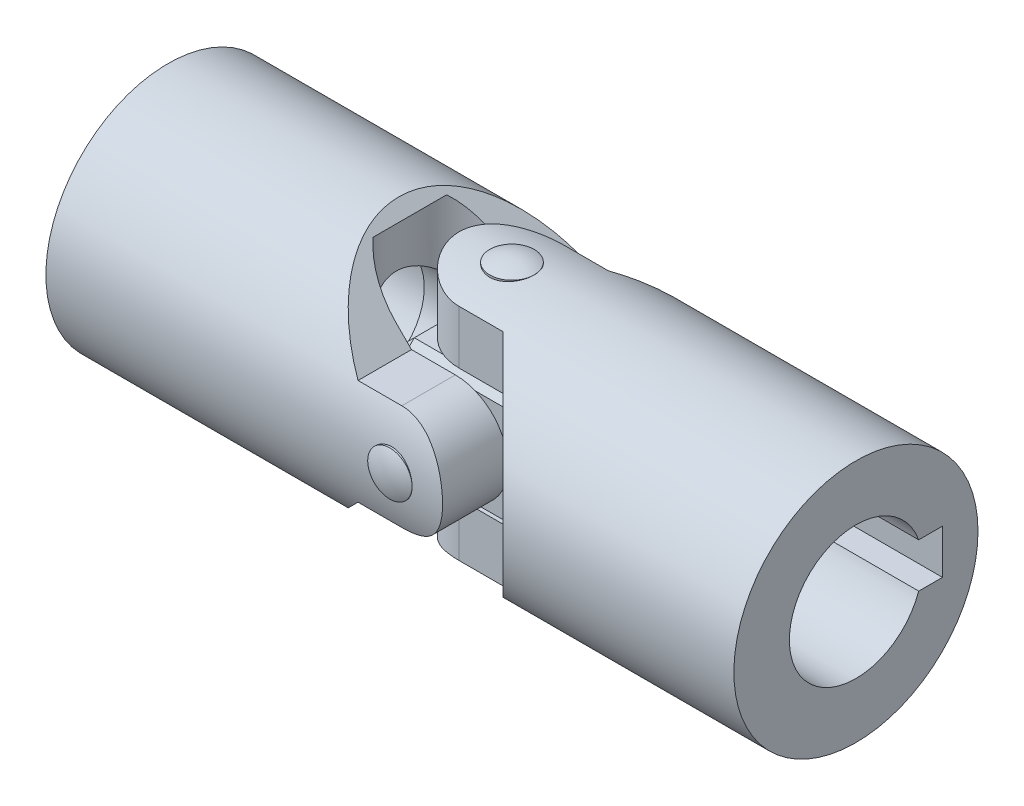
ISO-10303-21;
HEADER;
FILE_DESCRIPTION(('STEP AP214'),'2;1');
FILE_NAME('part.step','',(''),(''),'','','');
FILE_SCHEMA(('AUTOMOTIVE_DESIGN { 1 0 10303 214 1 1 1 1 }'));
ENDSEC;
DATA;
#1=APPLICATION_CONTEXT('core data for automotive mechanical design processes');
#2=APPLICATION_PROTOCOL_DEFINITION('international standard','automotive_design',2000,#1);
#3=PRODUCT_CONTEXT('',#1,'mechanical');
#4=PRODUCT('Part','Part','',(#3));
#5=PRODUCT_RELATED_PRODUCT_CATEGORY('part','',(#4));
#6=PRODUCT_DEFINITION_FORMATION('','',#4);
#7=PRODUCT_DEFINITION_CONTEXT('part definition',#1,'design');
#8=PRODUCT_DEFINITION('design','',#6,#7);
#9=PRODUCT_DEFINITION_SHAPE('','',#8);
#10=(LENGTH_UNIT() NAMED_UNIT(*) SI_UNIT(.MILLI.,.METRE.));
#11=(NAMED_UNIT(*) PLANE_ANGLE_UNIT() SI_UNIT($,.RADIAN.));
#12=(NAMED_UNIT(*) SI_UNIT($,.STERADIAN.) SOLID_ANGLE_UNIT());
#13=UNCERTAINTY_MEASURE_WITH_UNIT(LENGTH_MEASURE(1.E-05),#10,'distance_accuracy_value','');
#14=(GEOMETRIC_REPRESENTATION_CONTEXT(3) GLOBAL_UNCERTAINTY_ASSIGNED_CONTEXT((#13)) GLOBAL_UNIT_ASSIGNED_CONTEXT((#10,
#11,#12)) REPRESENTATION_CONTEXT('',''));
#15=CARTESIAN_POINT('',(0.,0.,0.));
#16=DIRECTION('',(0.,0.,1.));
#17=DIRECTION('',(1.,0.,0.));
#18=AXIS2_PLACEMENT_3D('',#15,#16,#17);
#19=CARTESIAN_POINT('',(0.,11.,0.));
#20=DIRECTION('',(0.,-1.,0.));
#21=DIRECTION('',(-1.,0.,0.));
#22=AXIS2_PLACEMENT_3D('',#19,#20,#21);
#23=CYLINDRICAL_SURFACE('',#22,2.);
#24=CARTESIAN_POINT('',(0.,11.,0.));
#25=DIRECTION('',(0.,1.,0.));
#26=DIRECTION('',(1.,0.,0.));
#27=AXIS2_PLACEMENT_3D('',#24,#25,#26);
#28=CIRCLE('',#27,2.);
#29=CARTESIAN_POINT('',(2.,11.,0.));
#30=VERTEX_POINT('',#29);
#31=EDGE_CURVE('P0_E10',#30,#30,#28,.T.);
#32=ORIENTED_EDGE('',*,*,#31,.F.);
#33=EDGE_LOOP('',(#32));
#34=FACE_BOUND('',#33,.T.);
#35=CARTESIAN_POINT('',(0.,-11.,0.));
#36=DIRECTION('',(0.,1.,0.));
#37=DIRECTION('',(0.,0.,1.));
#38=AXIS2_PLACEMENT_3D('',#35,#36,#37);
#39=CIRCLE('',#38,2.);
#40=CARTESIAN_POINT('',(0.,-11.,2.));
#41=VERTEX_POINT('',#40);
#42=EDGE_CURVE('P0_E20',#41,#41,#39,.T.);
#43=ORIENTED_EDGE('',*,*,#42,.T.);
#44=EDGE_LOOP('',(#43));
#45=FACE_BOUND('',#44,.T.);
#46=ADVANCED_FACE('P0_F14',(#34,#45),#23,.T.);
#47=CARTESIAN_POINT('',(0.,6.69157801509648,0.));
#48=DIRECTION('',(0.,1.,0.));
#49=DIRECTION('',(0.,0.,-1.));
#50=AXIS2_PLACEMENT_3D('',#47,#48,#49);
#51=SPHERICAL_SURFACE('',#50,4.75);
#52=ORIENTED_EDGE('',*,*,#31,.T.);
#53=EDGE_LOOP('',(#52));
#54=FACE_BOUND('',#53,.T.);
#55=ADVANCED_FACE('P0_F29',(#54),#51,.T.);
#56=CARTESIAN_POINT('',(0.,-6.69157801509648,0.));
#57=DIRECTION('',(0.,-1.,0.));
#58=DIRECTION('',(0.,0.,-1.));
#59=AXIS2_PLACEMENT_3D('',#56,#57,#58);
#60=SPHERICAL_SURFACE('',#59,4.75);
#61=ORIENTED_EDGE('',*,*,#42,.F.);
#62=EDGE_LOOP('',(#61));
#63=FACE_BOUND('',#62,.T.);
#64=ADVANCED_FACE('P0_F27',(#63),#60,.T.);
#65=CLOSED_SHELL('',(#46,#55,#64));
#66=MANIFOLD_SOLID_BREP('P0_B1',#65);
#67=CARTESIAN_POINT('',(0.,0.,11.));
#68=DIRECTION('',(0.,0.,-1.));
#69=DIRECTION('',(-1.,0.,0.));
#70=AXIS2_PLACEMENT_3D('',#67,#68,#69);
#71=CYLINDRICAL_SURFACE('',#70,2.);
#72=CARTESIAN_POINT('',(0.,0.,11.));
#73=DIRECTION('',(0.,0.,1.));
#74=DIRECTION('',(1.,0.,0.));
#75=AXIS2_PLACEMENT_3D('',#72,#73,#74);
#76=CIRCLE('',#75,2.);
#77=CARTESIAN_POINT('',(2.,0.,11.));
#78=VERTEX_POINT('',#77);
#79=EDGE_CURVE('P1_E10',#78,#78,#76,.T.);
#80=ORIENTED_EDGE('',*,*,#79,.F.);
#81=EDGE_LOOP('',(#80));
#82=FACE_BOUND('',#81,.T.);
#83=CARTESIAN_POINT('',(0.,0.,-11.));
#84=DIRECTION('',(0.,0.,1.));
#85=DIRECTION('',(0.,-1.,0.));
#86=AXIS2_PLACEMENT_3D('',#83,#84,#85);
#87=CIRCLE('',#86,2.);
#88=CARTESIAN_POINT('',(0.,-2.,-11.));
#89=VERTEX_POINT('',#88);
#90=EDGE_CURVE('P1_E20',#89,#89,#87,.T.);
#91=ORIENTED_EDGE('',*,*,#90,.T.);
#92=EDGE_LOOP('',(#91));
#93=FACE_BOUND('',#92,.T.);
#94=ADVANCED_FACE('P1_F14',(#82,#93),#71,.T.);
#95=CARTESIAN_POINT('',(0.,0.,6.69157801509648));
#96=DIRECTION('',(0.,0.,1.));
#97=DIRECTION('',(0.,1.,0.));
#98=AXIS2_PLACEMENT_3D('',#95,#96,#97);
#99=SPHERICAL_SURFACE('',#98,4.75);
#100=ORIENTED_EDGE('',*,*,#79,.T.);
#101=EDGE_LOOP('',(#100));
#102=FACE_BOUND('',#101,.T.);
#103=ADVANCED_FACE('P1_F29',(#102),#99,.T.);
#104=CARTESIAN_POINT('',(0.,0.,-6.69157801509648));
#105=DIRECTION('',(0.,0.,-1.));
#106=DIRECTION('',(0.,1.,0.));
#107=AXIS2_PLACEMENT_3D('',#104,#105,#106);
#108=SPHERICAL_SURFACE('',#107,4.75);
#109=ORIENTED_EDGE('',*,*,#90,.F.);
#110=EDGE_LOOP('',(#109));
#111=FACE_BOUND('',#110,.T.);
#112=ADVANCED_FACE('P1_F27',(#111),#108,.T.);
#113=CLOSED_SHELL('',(#94,#103,#112));
#114=MANIFOLD_SOLID_BREP('P1_B1',#113);
#115=CARTESIAN_POINT('',(0.,0.,5.1));
#116=DIRECTION('',(0.,0.,-1.));
#117=DIRECTION('',(-1.,0.,0.));
#118=AXIS2_PLACEMENT_3D('',#115,#116,#117);
#119=CYLINDRICAL_SURFACE('',#118,2.);
#120=CARTESIAN_POINT('',(0.,0.,0.));
#121=DIRECTION('',(0.,0.707106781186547,-0.707106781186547));
#122=DIRECTION('',(0.,-0.707106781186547,-0.707106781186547));
#123=AXIS2_PLACEMENT_3D('',#120,#121,#122);
#124=ELLIPSE('',#123,2.82842712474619,2.);
#125=CARTESIAN_POINT('',(2.,0.,0.));
#126=VERTEX_POINT('',#125);
#127=CARTESIAN_POINT('',(-2.,0.,0.));
#128=VERTEX_POINT('',#127);
#129=EDGE_CURVE('P2_E116',#126,#128,#124,.F.);
#130=ORIENTED_EDGE('',*,*,#129,.F.);
#131=CARTESIAN_POINT('',(0.,0.,0.));
#132=DIRECTION('',(0.,-0.707106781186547,-0.707106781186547));
#133=DIRECTION('',(0.,0.707106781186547,-0.707106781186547));
#134=AXIS2_PLACEMENT_3D('',#131,#132,#133);
#135=ELLIPSE('',#134,2.82842712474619,2.);
#136=EDGE_CURVE('P2_E120',#128,#126,#135,.F.);
#137=ORIENTED_EDGE('',*,*,#136,.F.);
#138=EDGE_LOOP('',(#130,#137));
#139=FACE_BOUND('',#138,.T.);
#140=CARTESIAN_POINT('',(0.,0.,5.1));
#141=DIRECTION('',(0.,0.,1.));
#142=DIRECTION('',(1.,0.,0.));
#143=AXIS2_PLACEMENT_3D('',#140,#141,#142);
#144=CIRCLE('',#143,2.);
#145=CARTESIAN_POINT('',(2.,0.,5.1));
#146=VERTEX_POINT('',#145);
#147=EDGE_CURVE('P2_E127',#146,#146,#144,.T.);
#148=ORIENTED_EDGE('',*,*,#147,.T.);
#149=EDGE_LOOP('',(#148));
#150=FACE_BOUND('',#149,.T.);
#151=ADVANCED_FACE('P2_F16',(#139,#150),#119,.F.);
#152=CARTESIAN_POINT('',(5.1,5.1,5.1));
#153=DIRECTION('',(0.,0.,1.));
#154=DIRECTION('',(1.,0.,0.));
#155=AXIS2_PLACEMENT_3D('',#152,#153,#154);
#156=PLANE('',#155);
#157=DIRECTION('',(0.,-1.,0.));
#158=VECTOR('',#157,1.);
#159=CARTESIAN_POINT('',(-4.4,-5.1,5.1));
#160=LINE('',#159,#158);
#161=CARTESIAN_POINT('',(-4.4,4.4,5.1));
#162=VERTEX_POINT('',#161);
#163=CARTESIAN_POINT('',(-4.4,-4.4,5.1));
#164=VERTEX_POINT('',#163);
#165=EDGE_CURVE('P2_E164',#162,#164,#160,.T.);
#166=ORIENTED_EDGE('',*,*,#165,.T.);
#167=DIRECTION('',(1.,0.,0.));
#168=VECTOR('',#167,1.);
#169=CARTESIAN_POINT('',(5.1,-4.4,5.1));
#170=LINE('',#169,#168);
#171=CARTESIAN_POINT('',(4.4,-4.4,5.1));
#172=VERTEX_POINT('',#171);
#173=EDGE_CURVE('P2_E168',#164,#172,#170,.T.);
#174=ORIENTED_EDGE('',*,*,#173,.T.);
#175=DIRECTION('',(0.,1.,0.));
#176=VECTOR('',#175,1.);
#177=CARTESIAN_POINT('',(4.4,5.1,5.1));
#178=LINE('',#177,#176);
#179=CARTESIAN_POINT('',(4.4,4.4,5.1));
#180=VERTEX_POINT('',#179);
#181=EDGE_CURVE('P2_E166',#172,#180,#178,.T.);
#182=ORIENTED_EDGE('',*,*,#181,.T.);
#183=DIRECTION('',(-1.,0.,0.));
#184=VECTOR('',#183,1.);
#185=CARTESIAN_POINT('',(-5.1,4.4,5.1));
#186=LINE('',#185,#184);
#187=EDGE_CURVE('P2_E162',#180,#162,#186,.T.);
#188=ORIENTED_EDGE('',*,*,#187,.T.);
#189=EDGE_LOOP('',(#166,#174,#182,#188));
#190=FACE_BOUND('',#189,.T.);
#191=ORIENTED_EDGE('',*,*,#147,.F.);
#192=EDGE_LOOP('',(#191));
#193=FACE_BOUND('',#192,.T.);
#194=ADVANCED_FACE('P2_F282',(#190,#193),#156,.T.);
#195=CARTESIAN_POINT('',(5.1,5.1,-5.1));
#196=DIRECTION('',(0.,0.,1.));
#197=DIRECTION('',(1.,0.,0.));
#198=AXIS2_PLACEMENT_3D('',#195,#196,#197);
#199=PLANE('',#198);
#200=DIRECTION('',(-1.,0.,0.));
#201=VECTOR('',#200,1.);
#202=CARTESIAN_POINT('',(5.1,-4.4,-5.1));
#203=LINE('',#202,#201);
#204=CARTESIAN_POINT('',(4.4,-4.4,-5.1));
#205=VERTEX_POINT('',#204);
#206=CARTESIAN_POINT('',(-4.4,-4.4,-5.1));
#207=VERTEX_POINT('',#206);
#208=EDGE_CURVE('P2_E157',#205,#207,#203,.T.);
#209=ORIENTED_EDGE('',*,*,#208,.T.);
#210=DIRECTION('',(0.,1.,0.));
#211=VECTOR('',#210,1.);
#212=CARTESIAN_POINT('',(-4.4,5.1,-5.1));
#213=LINE('',#212,#211);
#214=CARTESIAN_POINT('',(-4.4,4.4,-5.1));
#215=VERTEX_POINT('',#214);
#216=EDGE_CURVE('P2_E159',#207,#215,#213,.T.);
#217=ORIENTED_EDGE('',*,*,#216,.T.);
#218=DIRECTION('',(1.,0.,0.));
#219=VECTOR('',#218,1.);
#220=CARTESIAN_POINT('',(5.1,4.4,-5.1));
#221=LINE('',#220,#219);
#222=CARTESIAN_POINT('',(4.4,4.4,-5.1));
#223=VERTEX_POINT('',#222);
#224=EDGE_CURVE('P2_E153',#215,#223,#221,.T.);
#225=ORIENTED_EDGE('',*,*,#224,.T.);
#226=DIRECTION('',(0.,-1.,0.));
#227=VECTOR('',#226,1.);
#228=CARTESIAN_POINT('',(4.4,5.1,-5.1));
#229=LINE('',#228,#227);
#230=EDGE_CURVE('P2_E155',#223,#205,#229,.T.);
#231=ORIENTED_EDGE('',*,*,#230,.T.);
#232=EDGE_LOOP('',(#209,#217,#225,#231));
#233=FACE_BOUND('',#232,.T.);
#234=CARTESIAN_POINT('',(0.,0.,-5.1));
#235=DIRECTION('',(0.,0.,1.));
#236=DIRECTION('',(1.,0.,0.));
#237=AXIS2_PLACEMENT_3D('',#234,#235,#236);
#238=CIRCLE('',#237,2.);
#239=CARTESIAN_POINT('',(2.,0.,-5.1));
#240=VERTEX_POINT('',#239);
#241=EDGE_CURVE('P2_E259',#240,#240,#238,.T.);
#242=ORIENTED_EDGE('',*,*,#241,.T.);
#243=EDGE_LOOP('',(#242));
#244=FACE_BOUND('',#243,.T.);
#245=ADVANCED_FACE('P2_F267',(#233,#244),#199,.F.);
#246=CARTESIAN_POINT('',(-5.1,5.1,5.1));
#247=DIRECTION('',(0.,-1.,0.));
#248=DIRECTION('',(0.,0.,-1.));
#249=AXIS2_PLACEMENT_3D('',#246,#247,#248);
#250=PLANE('',#249);
#251=DIRECTION('',(-1.,0.,0.));
#252=VECTOR('',#251,1.);
#253=CARTESIAN_POINT('',(-5.1,5.1,-4.4));
#254=LINE('',#253,#252);
#255=CARTESIAN_POINT('',(4.4,5.1,-4.4));
#256=VERTEX_POINT('',#255);
#257=CARTESIAN_POINT('',(-4.4,5.1,-4.4));
#258=VERTEX_POINT('',#257);
#259=EDGE_CURVE('P2_E25',#256,#258,#254,.T.);
#260=ORIENTED_EDGE('',*,*,#259,.T.);
#261=DIRECTION('',(0.,0.,1.));
#262=VECTOR('',#261,1.);
#263=CARTESIAN_POINT('',(-4.4,5.1,5.1));
#264=LINE('',#263,#262);
#265=CARTESIAN_POINT('',(-4.4,5.1,4.4));
#266=VERTEX_POINT('',#265);
#267=EDGE_CURVE('P2_E11',#258,#266,#264,.T.);
#268=ORIENTED_EDGE('',*,*,#267,.T.);
#269=DIRECTION('',(1.,0.,0.));
#270=VECTOR('',#269,1.);
#271=CARTESIAN_POINT('',(5.1,5.1,4.4));
#272=LINE('',#271,#270);
#273=CARTESIAN_POINT('',(4.4,5.1,4.4));
#274=VERTEX_POINT('',#273);
#275=EDGE_CURVE('P2_E180',#266,#274,#272,.T.);
#276=ORIENTED_EDGE('',*,*,#275,.T.);
#277=DIRECTION('',(0.,0.,-1.));
#278=VECTOR('',#277,1.);
#279=CARTESIAN_POINT('',(4.4,5.1,5.1));
#280=LINE('',#279,#278);
#281=EDGE_CURVE('P2_E36',#274,#256,#280,.T.);
#282=ORIENTED_EDGE('',*,*,#281,.T.);
#283=EDGE_LOOP('',(#260,#268,#276,#282));
#284=FACE_BOUND('',#283,.T.);
#285=CARTESIAN_POINT('',(0.,5.1,0.));
#286=DIRECTION('',(0.,1.,0.));
#287=DIRECTION('',(0.,0.,1.));
#288=AXIS2_PLACEMENT_3D('',#285,#286,#287);
#289=CIRCLE('',#288,2.);
#290=CARTESIAN_POINT('',(0.,5.1,2.));
#291=VERTEX_POINT('',#290);
#292=EDGE_CURVE('P2_E249',#291,#291,#289,.T.);
#293=ORIENTED_EDGE('',*,*,#292,.F.);
#294=EDGE_LOOP('',(#293));
#295=FACE_BOUND('',#294,.T.);
#296=ADVANCED_FACE('P2_F290',(#284,#295),#250,.F.);
#297=CARTESIAN_POINT('',(-5.1,-5.1,5.1));
#298=DIRECTION('',(1.,0.,0.));
#299=DIRECTION('',(0.,0.,-1.));
#300=AXIS2_PLACEMENT_3D('',#297,#298,#299);
#301=PLANE('',#300);
#302=DIRECTION('',(0.,-1.,0.));
#303=VECTOR('',#302,1.);
#304=CARTESIAN_POINT('',(-5.1,-5.1,-4.4));
#305=LINE('',#304,#303);
#306=CARTESIAN_POINT('',(-5.1,4.4,-4.4));
#307=VERTEX_POINT('',#306);
#308=CARTESIAN_POINT('',(-5.1,-4.4,-4.4));
#309=VERTEX_POINT('',#308);
#310=EDGE_CURVE('P2_E148',#307,#309,#305,.T.);
#311=ORIENTED_EDGE('',*,*,#310,.T.);
#312=DIRECTION('',(0.,0.,1.));
#313=VECTOR('',#312,1.);
#314=CARTESIAN_POINT('',(-5.1,-4.4,5.1));
#315=LINE('',#314,#313);
#316=CARTESIAN_POINT('',(-5.1,-4.4,4.4));
#317=VERTEX_POINT('',#316);
#318=EDGE_CURVE('P2_E150',#309,#317,#315,.T.);
#319=ORIENTED_EDGE('',*,*,#318,.T.);
#320=DIRECTION('',(0.,1.,0.));
#321=VECTOR('',#320,1.);
#322=CARTESIAN_POINT('',(-5.1,5.1,4.4));
#323=LINE('',#322,#321);
#324=CARTESIAN_POINT('',(-5.1,4.4,4.4));
#325=VERTEX_POINT('',#324);
#326=EDGE_CURVE('P2_E146',#317,#325,#323,.T.);
#327=ORIENTED_EDGE('',*,*,#326,.T.);
#328=DIRECTION('',(0.,0.,-1.));
#329=VECTOR('',#328,1.);
#330=CARTESIAN_POINT('',(-5.1,4.4,5.1));
#331=LINE('',#330,#329);
#332=EDGE_CURVE('P2_E144',#325,#307,#331,.T.);
#333=ORIENTED_EDGE('',*,*,#332,.T.);
#334=EDGE_LOOP('',(#311,#319,#327,#333));
#335=FACE_BOUND('',#334,.T.);
#336=ADVANCED_FACE('P2_F297',(#335),#301,.F.);
#337=CARTESIAN_POINT('',(-5.1,-5.1,5.1));
#338=DIRECTION('',(0.,1.,0.));
#339=DIRECTION('',(0.,0.,1.));
#340=AXIS2_PLACEMENT_3D('',#337,#338,#339);
#341=PLANE('',#340);
#342=DIRECTION('',(-1.,0.,0.));
#343=VECTOR('',#342,1.);
#344=CARTESIAN_POINT('',(-5.1,-5.1,4.4));
#345=LINE('',#344,#343);
#346=CARTESIAN_POINT('',(4.4,-5.1,4.4));
#347=VERTEX_POINT('',#346);
#348=CARTESIAN_POINT('',(-4.4,-5.1,4.4));
#349=VERTEX_POINT('',#348);
#350=EDGE_CURVE('P2_E137',#347,#349,#345,.T.);
#351=ORIENTED_EDGE('',*,*,#350,.T.);
#352=DIRECTION('',(0.,0.,-1.));
#353=VECTOR('',#352,1.);
#354=CARTESIAN_POINT('',(-4.4,-5.1,5.1));
#355=LINE('',#354,#353);
#356=CARTESIAN_POINT('',(-4.4,-5.1,-4.4));
#357=VERTEX_POINT('',#356);
#358=EDGE_CURVE('P2_E141',#349,#357,#355,.T.);
#359=ORIENTED_EDGE('',*,*,#358,.T.);
#360=DIRECTION('',(1.,0.,0.));
#361=VECTOR('',#360,1.);
#362=CARTESIAN_POINT('',(-5.1,-5.1,-4.4));
#363=LINE('',#362,#361);
#364=CARTESIAN_POINT('',(4.4,-5.1,-4.4));
#365=VERTEX_POINT('',#364);
#366=EDGE_CURVE('P2_E139',#357,#365,#363,.T.);
#367=ORIENTED_EDGE('',*,*,#366,.T.);
#368=DIRECTION('',(0.,0.,1.));
#369=VECTOR('',#368,1.);
#370=CARTESIAN_POINT('',(4.4,-5.1,5.1));
#371=LINE('',#370,#369);
#372=EDGE_CURVE('P2_E130',#365,#347,#371,.T.);
#373=ORIENTED_EDGE('',*,*,#372,.T.);
#374=EDGE_LOOP('',(#351,#359,#367,#373));
#375=FACE_BOUND('',#374,.T.);
#376=CARTESIAN_POINT('',(0.,-5.1,0.));
#377=DIRECTION('',(0.,1.,0.));
#378=DIRECTION('',(0.,0.,1.));
#379=AXIS2_PLACEMENT_3D('',#376,#377,#378);
#380=CIRCLE('',#379,2.);
#381=CARTESIAN_POINT('',(0.,-5.1,2.));
#382=VERTEX_POINT('',#381);
#383=EDGE_CURVE('P2_E255',#382,#382,#380,.T.);
#384=ORIENTED_EDGE('',*,*,#383,.T.);
#385=EDGE_LOOP('',(#384));
#386=FACE_BOUND('',#385,.T.);
#387=ADVANCED_FACE('P2_F277',(#375,#386),#341,.F.);
#388=CARTESIAN_POINT('',(5.1,-5.1,5.1));
#389=DIRECTION('',(-1.,0.,0.));
#390=DIRECTION('',(0.,0.,1.));
#391=AXIS2_PLACEMENT_3D('',#388,#389,#390);
#392=PLANE('',#391);
#393=DIRECTION('',(0.,-1.,0.));
#394=VECTOR('',#393,1.);
#395=CARTESIAN_POINT('',(5.1,-5.1,4.4));
#396=LINE('',#395,#394);
#397=CARTESIAN_POINT('',(5.1,4.4,4.4));
#398=VERTEX_POINT('',#397);
#399=CARTESIAN_POINT('',(5.1,-4.4,4.4));
#400=VERTEX_POINT('',#399);
#401=EDGE_CURVE('P2_E173',#398,#400,#396,.T.);
#402=ORIENTED_EDGE('',*,*,#401,.T.);
#403=DIRECTION('',(0.,0.,-1.));
#404=VECTOR('',#403,1.);
#405=CARTESIAN_POINT('',(5.1,-4.4,5.1));
#406=LINE('',#405,#404);
#407=CARTESIAN_POINT('',(5.1,-4.4,-4.4));
#408=VERTEX_POINT('',#407);
#409=EDGE_CURVE('P2_E177',#400,#408,#406,.T.);
#410=ORIENTED_EDGE('',*,*,#409,.T.);
#411=DIRECTION('',(0.,1.,0.));
#412=VECTOR('',#411,1.);
#413=CARTESIAN_POINT('',(5.1,-5.1,-4.4));
#414=LINE('',#413,#412);
#415=CARTESIAN_POINT('',(5.1,4.4,-4.4));
#416=VERTEX_POINT('',#415);
#417=EDGE_CURVE('P2_E175',#408,#416,#414,.T.);
#418=ORIENTED_EDGE('',*,*,#417,.T.);
#419=DIRECTION('',(0.,0.,1.));
#420=VECTOR('',#419,1.);
#421=CARTESIAN_POINT('',(5.1,4.4,5.1));
#422=LINE('',#421,#420);
#423=EDGE_CURVE('P2_E171',#416,#398,#422,.T.);
#424=ORIENTED_EDGE('',*,*,#423,.T.);
#425=EDGE_LOOP('',(#402,#410,#418,#424));
#426=FACE_BOUND('',#425,.T.);
#427=ADVANCED_FACE('P2_F269',(#426),#392,.F.);
#428=CARTESIAN_POINT('',(0.,0.,0.));
#429=DIRECTION('',(0.,0.707106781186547,-0.707106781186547));
#430=DIRECTION('',(0.,-0.707106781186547,-0.707106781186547));
#431=AXIS2_PLACEMENT_3D('',#428,#429,#430);
#432=ELLIPSE('',#431,2.82842712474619,2.);
#433=EDGE_CURVE('P2_E119',#126,#128,#432,.T.);
#434=ORIENTED_EDGE('',*,*,#433,.F.);
#435=CARTESIAN_POINT('',(0.,0.,0.));
#436=DIRECTION('',(0.,-0.707106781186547,-0.707106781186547));
#437=DIRECTION('',(0.,0.707106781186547,-0.707106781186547));
#438=AXIS2_PLACEMENT_3D('',#435,#436,#437);
#439=ELLIPSE('',#438,2.82842712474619,2.);
#440=EDGE_CURVE('P2_E111',#128,#126,#439,.T.);
#441=ORIENTED_EDGE('',*,*,#440,.F.);
#442=EDGE_LOOP('',(#434,#441));
#443=FACE_BOUND('',#442,.T.);
#444=ORIENTED_EDGE('',*,*,#241,.F.);
#445=EDGE_LOOP('',(#444));
#446=FACE_BOUND('',#445,.T.);
#447=ADVANCED_FACE('P2_F132',(#443,#446),#119,.F.);
#448=CARTESIAN_POINT('',(0.,-5.1,0.));
#449=DIRECTION('',(0.,1.,0.));
#450=DIRECTION('',(0.,0.,1.));
#451=AXIS2_PLACEMENT_3D('',#448,#449,#450);
#452=CYLINDRICAL_SURFACE('',#451,2.);
#453=ORIENTED_EDGE('',*,*,#433,.T.);
#454=ORIENTED_EDGE('',*,*,#136,.T.);
#455=EDGE_LOOP('',(#453,#454));
#456=FACE_BOUND('',#455,.T.);
#457=ORIENTED_EDGE('',*,*,#383,.F.);
#458=EDGE_LOOP('',(#457));
#459=FACE_BOUND('',#458,.T.);
#460=ADVANCED_FACE('P2_F124',(#456,#459),#452,.F.);
#461=ORIENTED_EDGE('',*,*,#129,.T.);
#462=ORIENTED_EDGE('',*,*,#440,.T.);
#463=EDGE_LOOP('',(#461,#462));
#464=FACE_BOUND('',#463,.T.);
#465=ORIENTED_EDGE('',*,*,#292,.T.);
#466=EDGE_LOOP('',(#465));
#467=FACE_BOUND('',#466,.T.);
#468=ADVANCED_FACE('P2_F113',(#464,#467),#452,.F.);
#469=CARTESIAN_POINT('',(4.4,5.1,5.1));
#470=DIRECTION('',(-0.707106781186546,-0.707106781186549,0.));
#471=DIRECTION('',(0.707106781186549,-0.707106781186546,0.));
#472=AXIS2_PLACEMENT_3D('',#469,#470,#471);
#473=PLANE('',#472);
#474=DIRECTION('',(0.707106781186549,-0.707106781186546,0.));
#475=VECTOR('',#474,1.);
#476=CARTESIAN_POINT('',(4.75,4.75,4.4));
#477=LINE('',#476,#475);
#478=EDGE_CURVE('P2_E20',#398,#274,#477,.F.);
#479=ORIENTED_EDGE('',*,*,#478,.F.);
#480=ORIENTED_EDGE('',*,*,#423,.F.);
#481=DIRECTION('',(-0.707106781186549,0.707106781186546,0.));
#482=VECTOR('',#481,1.);
#483=CARTESIAN_POINT('',(5.1,4.4,-4.4));
#484=LINE('',#483,#482);
#485=EDGE_CURVE('P2_E243',#256,#416,#484,.F.);
#486=ORIENTED_EDGE('',*,*,#485,.F.);
#487=ORIENTED_EDGE('',*,*,#281,.F.);
#488=EDGE_LOOP('',(#479,#480,#486,#487));
#489=FACE_BOUND('',#488,.T.);
#490=ADVANCED_FACE('P2_F18',(#489),#473,.F.);
#491=CARTESIAN_POINT('',(4.4,4.4,5.1));
#492=DIRECTION('',(0.577350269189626,0.577350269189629,0.577350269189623));
#493=DIRECTION('',(-0.707106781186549,0.707106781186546,0.));
#494=AXIS2_PLACEMENT_3D('',#491,#492,#493);
#495=PLANE('',#494);
#496=DIRECTION('',(0.707106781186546,0.,-0.707106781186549));
#497=VECTOR('',#496,1.);
#498=CARTESIAN_POINT('',(4.4,4.4,5.1));
#499=LINE('',#498,#497);
#500=EDGE_CURVE('P2_E238',#398,#180,#499,.F.);
#501=ORIENTED_EDGE('',*,*,#500,.F.);
#502=ORIENTED_EDGE('',*,*,#478,.T.);
#503=DIRECTION('',(0.,-0.707106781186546,0.707106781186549));
#504=VECTOR('',#503,1.);
#505=CARTESIAN_POINT('',(4.4,4.4,5.1));
#506=LINE('',#505,#504);
#507=EDGE_CURVE('P2_E241',#180,#274,#506,.F.);
#508=ORIENTED_EDGE('',*,*,#507,.F.);
#509=EDGE_LOOP('',(#501,#502,#508));
#510=FACE_BOUND('',#509,.T.);
#511=ADVANCED_FACE('P2_F374',(#510),#495,.T.);
#512=CARTESIAN_POINT('',(5.1,4.4,-4.4));
#513=DIRECTION('',(0.577350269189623,0.577350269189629,-0.577350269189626));
#514=DIRECTION('',(0.,0.707106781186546,0.707106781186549));
#515=AXIS2_PLACEMENT_3D('',#512,#513,#514);
#516=PLANE('',#515);
#517=DIRECTION('',(0.,-0.707106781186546,-0.707106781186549));
#518=VECTOR('',#517,1.);
#519=CARTESIAN_POINT('',(4.4,4.75,-4.75));
#520=LINE('',#519,#518);
#521=EDGE_CURVE('P2_E232',#256,#223,#520,.T.);
#522=ORIENTED_EDGE('',*,*,#521,.F.);
#523=ORIENTED_EDGE('',*,*,#485,.T.);
#524=DIRECTION('',(0.707106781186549,0.,0.707106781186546));
#525=VECTOR('',#524,1.);
#526=CARTESIAN_POINT('',(5.1,4.4,-4.4));
#527=LINE('',#526,#525);
#528=EDGE_CURVE('P2_E235',#223,#416,#527,.T.);
#529=ORIENTED_EDGE('',*,*,#528,.F.);
#530=EDGE_LOOP('',(#522,#523,#529));
#531=FACE_BOUND('',#530,.T.);
#532=ADVANCED_FACE('P2_F371',(#531),#516,.T.);
#533=CARTESIAN_POINT('',(5.1,4.4,5.1));
#534=DIRECTION('',(0.,0.707106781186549,0.707106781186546));
#535=DIRECTION('',(0.,-0.707106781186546,0.707106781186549));
#536=AXIS2_PLACEMENT_3D('',#533,#534,#535);
#537=PLANE('',#536);
#538=ORIENTED_EDGE('',*,*,#507,.T.);
#539=ORIENTED_EDGE('',*,*,#275,.F.);
#540=DIRECTION('',(0.,0.707106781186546,-0.707106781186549));
#541=VECTOR('',#540,1.);
#542=CARTESIAN_POINT('',(-4.4,4.75,4.75));
#543=LINE('',#542,#541);
#544=EDGE_CURVE('P2_E227',#162,#266,#543,.T.);
#545=ORIENTED_EDGE('',*,*,#544,.F.);
#546=ORIENTED_EDGE('',*,*,#187,.F.);
#547=EDGE_LOOP('',(#538,#539,#545,#546));
#548=FACE_BOUND('',#547,.T.);
#549=ADVANCED_FACE('P2_F367',(#548),#537,.T.);
#550=CARTESIAN_POINT('',(4.4,5.1,5.1));
#551=DIRECTION('',(0.707106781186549,0.,0.707106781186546));
#552=DIRECTION('',(0.707106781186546,0.,-0.707106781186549));
#553=AXIS2_PLACEMENT_3D('',#550,#551,#552);
#554=PLANE('',#553);
#555=ORIENTED_EDGE('',*,*,#500,.T.);
#556=ORIENTED_EDGE('',*,*,#181,.F.);
#557=DIRECTION('',(-0.707106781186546,0.,0.707106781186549));
#558=VECTOR('',#557,1.);
#559=CARTESIAN_POINT('',(4.4,-4.4,5.1));
#560=LINE('',#559,#558);
#561=EDGE_CURVE('P2_E224',#400,#172,#560,.T.);
#562=ORIENTED_EDGE('',*,*,#561,.F.);
#563=ORIENTED_EDGE('',*,*,#401,.F.);
#564=EDGE_LOOP('',(#555,#556,#562,#563));
#565=FACE_BOUND('',#564,.T.);
#566=ADVANCED_FACE('P2_F363',(#565),#554,.T.);
#567=CARTESIAN_POINT('',(5.1,-4.4,5.1));
#568=DIRECTION('',(-0.707106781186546,0.707106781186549,0.));
#569=DIRECTION('',(-0.707106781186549,-0.707106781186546,0.));
#570=AXIS2_PLACEMENT_3D('',#567,#568,#569);
#571=PLANE('',#570);
#572=DIRECTION('',(0.707106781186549,0.707106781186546,0.));
#573=VECTOR('',#572,1.);
#574=CARTESIAN_POINT('',(4.4,-5.1,-4.4));
#575=LINE('',#574,#573);
#576=EDGE_CURVE('P2_E218',#408,#365,#575,.F.);
#577=ORIENTED_EDGE('',*,*,#576,.F.);
#578=ORIENTED_EDGE('',*,*,#409,.F.);
#579=DIRECTION('',(-0.707106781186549,-0.707106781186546,0.));
#580=VECTOR('',#579,1.);
#581=CARTESIAN_POINT('',(4.75,-4.75,4.4));
#582=LINE('',#581,#580);
#583=EDGE_CURVE('P2_E221',#347,#400,#582,.F.);
#584=ORIENTED_EDGE('',*,*,#583,.F.);
#585=ORIENTED_EDGE('',*,*,#372,.F.);
#586=EDGE_LOOP('',(#577,#578,#584,#585));
#587=FACE_BOUND('',#586,.T.);
#588=ADVANCED_FACE('P2_F359',(#587),#571,.F.);
#589=CARTESIAN_POINT('',(5.1,-5.1,-4.4));
#590=DIRECTION('',(-0.707106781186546,0.,0.707106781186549));
#591=DIRECTION('',(0.707106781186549,0.,0.707106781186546));
#592=AXIS2_PLACEMENT_3D('',#589,#590,#591);
#593=PLANE('',#592);
#594=ORIENTED_EDGE('',*,*,#528,.T.);
#595=ORIENTED_EDGE('',*,*,#417,.F.);
#596=DIRECTION('',(-0.707106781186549,0.,-0.707106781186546));
#597=VECTOR('',#596,1.);
#598=CARTESIAN_POINT('',(4.75,-4.4,-4.75));
#599=LINE('',#598,#597);
#600=EDGE_CURVE('P2_E216',#205,#408,#599,.F.);
#601=ORIENTED_EDGE('',*,*,#600,.F.);
#602=ORIENTED_EDGE('',*,*,#230,.F.);
#603=EDGE_LOOP('',(#594,#595,#601,#602));
#604=FACE_BOUND('',#603,.T.);
#605=ADVANCED_FACE('P2_F355',(#604),#593,.F.);
#606=CARTESIAN_POINT('',(-5.1,5.1,-4.4));
#607=DIRECTION('',(0.,-0.707106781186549,0.707106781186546));
#608=DIRECTION('',(0.,-0.707106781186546,-0.707106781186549));
#609=AXIS2_PLACEMENT_3D('',#606,#607,#608);
#610=PLANE('',#609);
#611=ORIENTED_EDGE('',*,*,#521,.T.);
#612=ORIENTED_EDGE('',*,*,#224,.F.);
#613=DIRECTION('',(0.,0.707106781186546,0.707106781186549));
#614=VECTOR('',#613,1.);
#615=CARTESIAN_POINT('',(-4.4,4.4,-5.1));
#616=LINE('',#615,#614);
#617=EDGE_CURVE('P2_E213',#258,#215,#616,.F.);
#618=ORIENTED_EDGE('',*,*,#617,.F.);
#619=ORIENTED_EDGE('',*,*,#259,.F.);
#620=EDGE_LOOP('',(#611,#612,#618,#619));
#621=FACE_BOUND('',#620,.T.);
#622=ADVANCED_FACE('P2_F351',(#621),#610,.F.);
#623=CARTESIAN_POINT('',(-5.1,4.4,5.1));
#624=DIRECTION('',(0.707106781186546,-0.707106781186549,0.));
#625=DIRECTION('',(0.707106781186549,0.707106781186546,0.));
#626=AXIS2_PLACEMENT_3D('',#623,#624,#625);
#627=PLANE('',#626);
#628=DIRECTION('',(0.707106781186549,0.707106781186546,0.));
#629=VECTOR('',#628,1.);
#630=CARTESIAN_POINT('',(-5.1,4.4,4.4));
#631=LINE('',#630,#629);
#632=EDGE_CURVE('P2_E229',#266,#325,#631,.F.);
#633=ORIENTED_EDGE('',*,*,#632,.F.);
#634=ORIENTED_EDGE('',*,*,#267,.F.);
#635=DIRECTION('',(-0.707106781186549,-0.707106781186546,0.));
#636=VECTOR('',#635,1.);
#637=CARTESIAN_POINT('',(-4.75,4.75,-4.4));
#638=LINE('',#637,#636);
#639=EDGE_CURVE('P2_E210',#307,#258,#638,.F.);
#640=ORIENTED_EDGE('',*,*,#639,.F.);
#641=ORIENTED_EDGE('',*,*,#332,.F.);
#642=EDGE_LOOP('',(#633,#634,#640,#641));
#643=FACE_BOUND('',#642,.T.);
#644=ADVANCED_FACE('P2_F347',(#643),#627,.F.);
#645=CARTESIAN_POINT('',(-5.1,4.4,4.4));
#646=DIRECTION('',(-0.577350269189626,0.577350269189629,0.577350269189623));
#647=DIRECTION('',(-0.707106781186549,-0.707106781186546,0.));
#648=AXIS2_PLACEMENT_3D('',#645,#646,#647);
#649=PLANE('',#648);
#650=ORIENTED_EDGE('',*,*,#544,.T.);
#651=ORIENTED_EDGE('',*,*,#632,.T.);
#652=DIRECTION('',(0.707106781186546,0.,0.707106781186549));
#653=VECTOR('',#652,1.);
#654=CARTESIAN_POINT('',(-5.1,4.4,4.4));
#655=LINE('',#654,#653);
#656=EDGE_CURVE('P2_E207',#162,#325,#655,.F.);
#657=ORIENTED_EDGE('',*,*,#656,.F.);
#658=EDGE_LOOP('',(#650,#651,#657));
#659=FACE_BOUND('',#658,.T.);
#660=ADVANCED_FACE('P2_F343',(#659),#649,.T.);
#661=CARTESIAN_POINT('',(4.4,-4.4,5.1));
#662=DIRECTION('',(0.577350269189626,-0.577350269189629,0.577350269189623));
#663=DIRECTION('',(0.707106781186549,0.707106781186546,0.));
#664=AXIS2_PLACEMENT_3D('',#661,#662,#663);
#665=PLANE('',#664);
#666=ORIENTED_EDGE('',*,*,#583,.T.);
#667=ORIENTED_EDGE('',*,*,#561,.T.);
#668=DIRECTION('',(0.,-0.707106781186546,-0.707106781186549));
#669=VECTOR('',#668,1.);
#670=CARTESIAN_POINT('',(4.4,-4.4,5.1));
#671=LINE('',#670,#669);
#672=EDGE_CURVE('P2_E205',#347,#172,#671,.F.);
#673=ORIENTED_EDGE('',*,*,#672,.F.);
#674=EDGE_LOOP('',(#666,#667,#673));
#675=FACE_BOUND('',#674,.T.);
#676=ADVANCED_FACE('P2_F339',(#675),#665,.T.);
#677=CARTESIAN_POINT('',(4.4,-5.1,-4.4));
#678=DIRECTION('',(0.577350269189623,-0.577350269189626,-0.577350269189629));
#679=DIRECTION('',(0.,0.707106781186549,-0.707106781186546));
#680=AXIS2_PLACEMENT_3D('',#677,#678,#679);
#681=PLANE('',#680);
#682=ORIENTED_EDGE('',*,*,#600,.T.);
#683=ORIENTED_EDGE('',*,*,#576,.T.);
#684=DIRECTION('',(0.,-0.707106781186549,0.707106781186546));
#685=VECTOR('',#684,1.);
#686=CARTESIAN_POINT('',(4.4,-5.1,-4.4));
#687=LINE('',#686,#685);
#688=EDGE_CURVE('P2_E202',#205,#365,#687,.T.);
#689=ORIENTED_EDGE('',*,*,#688,.F.);
#690=EDGE_LOOP('',(#682,#683,#689));
#691=FACE_BOUND('',#690,.T.);
#692=ADVANCED_FACE('P2_F335',(#691),#681,.T.);
#693=CARTESIAN_POINT('',(-4.4,4.4,-5.1));
#694=DIRECTION('',(-0.577350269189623,0.577350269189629,-0.577350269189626));
#695=DIRECTION('',(0.,0.707106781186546,0.707106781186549));
#696=AXIS2_PLACEMENT_3D('',#693,#694,#695);
#697=PLANE('',#696);
#698=ORIENTED_EDGE('',*,*,#639,.T.);
#699=ORIENTED_EDGE('',*,*,#617,.T.);
#700=DIRECTION('',(0.707106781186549,0.,-0.707106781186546));
#701=VECTOR('',#700,1.);
#702=CARTESIAN_POINT('',(-4.4,4.4,-5.1));
#703=LINE('',#702,#701);
#704=EDGE_CURVE('P2_E200',#307,#215,#703,.T.);
#705=ORIENTED_EDGE('',*,*,#704,.F.);
#706=EDGE_LOOP('',(#698,#699,#705));
#707=FACE_BOUND('',#706,.T.);
#708=ADVANCED_FACE('P2_F331',(#707),#697,.T.);
#709=CARTESIAN_POINT('',(-4.4,5.1,5.1));
#710=DIRECTION('',(-0.707106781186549,0.,0.707106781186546));
#711=DIRECTION('',(0.707106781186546,0.,0.707106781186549));
#712=AXIS2_PLACEMENT_3D('',#709,#710,#711);
#713=PLANE('',#712);
#714=ORIENTED_EDGE('',*,*,#656,.T.);
#715=ORIENTED_EDGE('',*,*,#326,.F.);
#716=DIRECTION('',(-0.707106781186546,0.,-0.707106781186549));
#717=VECTOR('',#716,1.);
#718=CARTESIAN_POINT('',(-5.1,-4.4,4.4));
#719=LINE('',#718,#717);
#720=EDGE_CURVE('P2_E197',#164,#317,#719,.T.);
#721=ORIENTED_EDGE('',*,*,#720,.F.);
#722=ORIENTED_EDGE('',*,*,#165,.F.);
#723=EDGE_LOOP('',(#714,#715,#721,#722));
#724=FACE_BOUND('',#723,.T.);
#725=ADVANCED_FACE('P2_F327',(#724),#713,.T.);
#726=CARTESIAN_POINT('',(5.1,-4.4,5.1));
#727=DIRECTION('',(0.,-0.707106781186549,0.707106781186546));
#728=DIRECTION('',(0.,-0.707106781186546,-0.707106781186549));
#729=AXIS2_PLACEMENT_3D('',#726,#727,#728);
#730=PLANE('',#729);
#731=ORIENTED_EDGE('',*,*,#672,.T.);
#732=ORIENTED_EDGE('',*,*,#173,.F.);
#733=DIRECTION('',(0.,0.707106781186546,0.707106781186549));
#734=VECTOR('',#733,1.);
#735=CARTESIAN_POINT('',(-4.4,-4.75,4.75));
#736=LINE('',#735,#734);
#737=EDGE_CURVE('P2_E194',#349,#164,#736,.T.);
#738=ORIENTED_EDGE('',*,*,#737,.F.);
#739=ORIENTED_EDGE('',*,*,#350,.F.);
#740=EDGE_LOOP('',(#731,#732,#738,#739));
#741=FACE_BOUND('',#740,.T.);
#742=ADVANCED_FACE('P2_F323',(#741),#730,.T.);
#743=CARTESIAN_POINT('',(-5.1,-5.1,-4.4));
#744=DIRECTION('',(0.,0.707106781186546,0.707106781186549));
#745=DIRECTION('',(0.,-0.707106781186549,0.707106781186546));
#746=AXIS2_PLACEMENT_3D('',#743,#744,#745);
#747=PLANE('',#746);
#748=ORIENTED_EDGE('',*,*,#688,.T.);
#749=ORIENTED_EDGE('',*,*,#366,.F.);
#750=DIRECTION('',(0.,0.707106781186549,-0.707106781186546));
#751=VECTOR('',#750,1.);
#752=CARTESIAN_POINT('',(-4.4,-5.1,-4.4));
#753=LINE('',#752,#751);
#754=EDGE_CURVE('P2_E191',#207,#357,#753,.F.);
#755=ORIENTED_EDGE('',*,*,#754,.F.);
#756=ORIENTED_EDGE('',*,*,#208,.F.);
#757=EDGE_LOOP('',(#748,#749,#755,#756));
#758=FACE_BOUND('',#757,.T.);
#759=ADVANCED_FACE('P2_F319',(#758),#747,.F.);
#760=CARTESIAN_POINT('',(-5.1,-5.1,-4.4));
#761=DIRECTION('',(0.707106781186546,0.,0.707106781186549));
#762=DIRECTION('',(0.707106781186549,0.,-0.707106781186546));
#763=AXIS2_PLACEMENT_3D('',#760,#761,#762);
#764=PLANE('',#763);
#765=ORIENTED_EDGE('',*,*,#704,.T.);
#766=ORIENTED_EDGE('',*,*,#216,.F.);
#767=DIRECTION('',(-0.707106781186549,0.,0.707106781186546));
#768=VECTOR('',#767,1.);
#769=CARTESIAN_POINT('',(-4.75,-4.4,-4.75));
#770=LINE('',#769,#768);
#771=EDGE_CURVE('P2_E188',#309,#207,#770,.F.);
#772=ORIENTED_EDGE('',*,*,#771,.F.);
#773=ORIENTED_EDGE('',*,*,#310,.F.);
#774=EDGE_LOOP('',(#765,#766,#772,#773));
#775=FACE_BOUND('',#774,.T.);
#776=ADVANCED_FACE('P2_F315',(#775),#764,.F.);
#777=CARTESIAN_POINT('',(-5.1,-4.4,4.4));
#778=DIRECTION('',(-0.577350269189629,-0.577350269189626,0.577350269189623));
#779=DIRECTION('',(0.707106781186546,-0.707106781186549,0.));
#780=AXIS2_PLACEMENT_3D('',#777,#778,#779);
#781=PLANE('',#780);
#782=ORIENTED_EDGE('',*,*,#737,.T.);
#783=ORIENTED_EDGE('',*,*,#720,.T.);
#784=DIRECTION('',(-0.707106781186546,0.707106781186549,0.));
#785=VECTOR('',#784,1.);
#786=CARTESIAN_POINT('',(-5.1,-4.4,4.4));
#787=LINE('',#786,#785);
#788=EDGE_CURVE('P2_E186',#349,#317,#787,.T.);
#789=ORIENTED_EDGE('',*,*,#788,.F.);
#790=EDGE_LOOP('',(#782,#783,#789));
#791=FACE_BOUND('',#790,.T.);
#792=ADVANCED_FACE('P2_F311',(#791),#781,.T.);
#793=CARTESIAN_POINT('',(-4.4,-5.1,-4.4));
#794=DIRECTION('',(-0.577350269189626,-0.577350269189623,-0.577350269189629));
#795=DIRECTION('',(-0.707106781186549,0.,0.707106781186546));
#796=AXIS2_PLACEMENT_3D('',#793,#794,#795);
#797=PLANE('',#796);
#798=ORIENTED_EDGE('',*,*,#771,.T.);
#799=ORIENTED_EDGE('',*,*,#754,.T.);
#800=DIRECTION('',(0.707106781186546,-0.707106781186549,0.));
#801=VECTOR('',#800,1.);
#802=CARTESIAN_POINT('',(-4.4,-5.1,-4.4));
#803=LINE('',#802,#801);
#804=EDGE_CURVE('P2_E184',#309,#357,#803,.T.);
#805=ORIENTED_EDGE('',*,*,#804,.F.);
#806=EDGE_LOOP('',(#798,#799,#805));
#807=FACE_BOUND('',#806,.T.);
#808=ADVANCED_FACE('P2_F307',(#807),#797,.T.);
#809=CARTESIAN_POINT('',(-4.4,-5.1,5.1));
#810=DIRECTION('',(0.707106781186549,0.707106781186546,0.));
#811=DIRECTION('',(-0.707106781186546,0.707106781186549,0.));
#812=AXIS2_PLACEMENT_3D('',#809,#810,#811);
#813=PLANE('',#812);
#814=ORIENTED_EDGE('',*,*,#788,.T.);
#815=ORIENTED_EDGE('',*,*,#318,.F.);
#816=ORIENTED_EDGE('',*,*,#804,.T.);
#817=ORIENTED_EDGE('',*,*,#358,.F.);
#818=EDGE_LOOP('',(#814,#815,#816,#817));
#819=FACE_BOUND('',#818,.T.);
#820=ADVANCED_FACE('P2_F304',(#819),#813,.F.);
#821=CLOSED_SHELL('',(#151,#194,#245,#296,#336,#387,#427,#447,#460,#468,#490,#511,#532,#549,
#566,#588,#605,#622,#644,#660,#676,#692,#708,#725,#742,#759,#776,#792,#808,#820));
#822=MANIFOLD_SOLID_BREP('P2_B1',#821);
#823=CARTESIAN_POINT('',(0.,0.,-11.));
#824=DIRECTION('',(0.,0.,1.));
#825=DIRECTION('',(0.,1.,0.));
#826=AXIS2_PLACEMENT_3D('',#823,#824,#825);
#827=CYLINDRICAL_SURFACE('',#826,2.);
#828=CARTESIAN_POINT('',(0.,0.,-5.1));
#829=DIRECTION('',(0.,0.,-1.));
#830=DIRECTION('',(-1.,0.,0.));
#831=AXIS2_PLACEMENT_3D('',#828,#829,#830);
#832=CIRCLE('',#831,2.);
#833=CARTESIAN_POINT('',(-2.,0.,-5.1));
#834=VERTEX_POINT('',#833);
#835=EDGE_CURVE('P3_E207',#834,#834,#832,.F.);
#836=ORIENTED_EDGE('',*,*,#835,.T.);
#837=EDGE_LOOP('',(#836));
#838=FACE_BOUND('',#837,.T.);
#839=CARTESIAN_POINT('',(2.,0.,-11.));
#840=CARTESIAN_POINT('',(1.99999568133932,0.11135727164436,-10.9999980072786));
#841=CARTESIAN_POINT('',(1.99066824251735,0.22277144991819,-10.9982915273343));
#842=CARTESIAN_POINT('',(1.95362653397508,0.442464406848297,-10.99164847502));
#843=CARTESIAN_POINT('',(1.92589635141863,0.550740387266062,-10.9867091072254));
#844=CARTESIAN_POINT('',(1.85292287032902,0.760947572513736,-10.9741532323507));
#845=CARTESIAN_POINT('',(1.80769496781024,0.862884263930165,-10.9665390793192));
#846=CARTESIAN_POINT('',(1.70105266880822,1.05771200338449,-10.949466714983));
#847=CARTESIAN_POINT('',(1.63963973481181,1.15060386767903,-10.9400086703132));
#848=CARTESIAN_POINT('',(1.5016340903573,1.32576444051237,-10.9201743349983));
#849=CARTESIAN_POINT('',(1.42489415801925,1.40791622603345,-10.9097897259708));
#850=CARTESIAN_POINT('',(1.25872964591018,1.55825357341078,-10.8893349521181));
#851=CARTESIAN_POINT('',(1.16930418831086,1.62643816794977,-10.8792648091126));
#852=CARTESIAN_POINT('',(0.979487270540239,1.74738695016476,-10.8604984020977));
#853=CARTESIAN_POINT('',(0.879019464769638,1.80003313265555,-10.851812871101));
#854=CARTESIAN_POINT('',(0.670481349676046,1.88765546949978,-10.836915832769));
#855=CARTESIAN_POINT('',(0.562411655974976,1.92263305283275,-10.8307041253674));
#856=CARTESIAN_POINT('',(0.342985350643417,1.97355197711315,-10.8215415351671));
#857=CARTESIAN_POINT('',(0.23167740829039,1.98969666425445,-10.8185558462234));
#858=CARTESIAN_POINT('',(0.00789559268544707,2.00312248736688,-10.8160783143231));
#859=CARTESIAN_POINT('',(-0.104578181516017,2.00040521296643,-10.8165861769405));
#860=CARTESIAN_POINT('',(-0.326031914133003,1.97634934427,-10.8210066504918));
#861=CARTESIAN_POINT('',(-0.435037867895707,1.95524117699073,-10.8248771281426));
#862=CARTESIAN_POINT('',(-0.647935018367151,1.89536523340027,-10.8355206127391));
#863=CARTESIAN_POINT('',(-0.751826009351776,1.85659674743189,-10.8422937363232));
#864=CARTESIAN_POINT('',(-0.952222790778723,1.76227297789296,-10.8580238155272));
#865=CARTESIAN_POINT('',(-1.04868344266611,1.70662390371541,-10.8669929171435));
#866=CARTESIAN_POINT('',(-1.23098473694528,1.58018503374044,-10.8860962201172));
#867=CARTESIAN_POINT('',(-1.31682436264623,1.50939379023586,-10.8962305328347));
#868=CARTESIAN_POINT('',(-1.47677899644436,1.35343399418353,-10.9167064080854));
#869=CARTESIAN_POINT('',(-1.5507016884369,1.26806817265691,-10.9270488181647));
#870=CARTESIAN_POINT('',(-1.68320513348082,1.08604454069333,-10.9466375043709));
#871=CARTESIAN_POINT('',(-1.74178574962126,0.989386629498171,-10.9558837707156));
#872=CARTESIAN_POINT('',(-1.84196738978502,0.787327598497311,-10.9722553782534));
#873=CARTESIAN_POINT('',(-1.88354926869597,0.681916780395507,-10.9793783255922));
#874=CARTESIAN_POINT('',(-1.9483631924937,0.465448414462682,-10.9906820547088));
#875=CARTESIAN_POINT('',(-1.97159706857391,0.35439143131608,-10.994863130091));
#876=CARTESIAN_POINT('',(-1.99878976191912,0.131438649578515,-10.9997719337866));
#877=CARTESIAN_POINT('',(-2.00301222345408,0.0195760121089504,-11.0005468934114));
#878=CARTESIAN_POINT('',(-1.99276820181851,-0.203257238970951,-10.998686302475));
#879=CARTESIAN_POINT('',(-1.97830257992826,-0.314227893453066,-10.9960509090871));
#880=CARTESIAN_POINT('',(-1.93131225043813,-0.531297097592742,-10.9876950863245));
#881=CARTESIAN_POINT('',(-1.89892013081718,-0.637425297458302,-10.9819973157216));
#882=CARTESIAN_POINT('',(-1.81713917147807,-0.842744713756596,-10.9681529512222));
#883=CARTESIAN_POINT('',(-1.76774923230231,-0.941935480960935,-10.9600061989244));
#884=CARTESIAN_POINT('',(-1.65278536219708,-1.13169524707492,-10.9420497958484));
#885=CARTESIAN_POINT('',(-1.58704931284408,-1.22216445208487,-10.932223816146));
#886=CARTESIAN_POINT('',(-1.44147962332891,-1.39088213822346,-10.9120428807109));
#887=CARTESIAN_POINT('',(-1.36164475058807,-1.46912954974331,-10.901687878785));
#888=CARTESIAN_POINT('',(-1.18895311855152,-1.61217737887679,-10.8814603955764));
#889=CARTESIAN_POINT('',(-1.09594669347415,-1.67679836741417,-10.8715955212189));
#890=CARTESIAN_POINT('',(-0.900243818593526,-1.78949986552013,-10.8536151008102));
#891=CARTESIAN_POINT('',(-0.79754771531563,-1.83758096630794,-10.8454994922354));
#892=CARTESIAN_POINT('',(-0.585849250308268,-1.91557945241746,-10.8319954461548));
#893=CARTESIAN_POINT('',(-0.476878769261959,-1.94558107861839,-10.8265943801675));
#894=CARTESIAN_POINT('',(-0.255337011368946,-1.98683040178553,-10.8191012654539));
#895=CARTESIAN_POINT('',(-0.142766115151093,-1.99808007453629,-10.8170088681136));
#896=CARTESIAN_POINT('',(0.0809853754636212,-2.00144313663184,-10.8163869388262));
#897=CARTESIAN_POINT('',(0.192161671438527,-1.99383937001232,-10.8178047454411));
#898=CARTESIAN_POINT('',(0.411623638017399,-1.96032846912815,-10.8239270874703));
#899=CARTESIAN_POINT('',(0.51990932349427,-1.93442142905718,-10.8286316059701));
#900=CARTESIAN_POINT('',(0.730376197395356,-1.86515567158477,-10.8407757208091));
#901=CARTESIAN_POINT('',(0.832567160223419,-1.82182581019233,-10.8482107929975));
#902=CARTESIAN_POINT('',(1.02827444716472,-1.71897473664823,-10.8649817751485));
#903=CARTESIAN_POINT('',(1.12179020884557,-1.65945247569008,-10.8743178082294));
#904=CARTESIAN_POINT('',(1.29891287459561,-1.524915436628,-10.8940032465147));
#905=CARTESIAN_POINT('',(1.38236156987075,-1.449694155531,-10.9043650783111));
#906=CARTESIAN_POINT('',(1.53554708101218,-1.28632651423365,-10.9248399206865));
#907=CARTESIAN_POINT('',(1.60528074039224,-1.19817718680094,-10.9349528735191));
#908=CARTESIAN_POINT('',(1.72960029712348,-1.01057118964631,-10.9538897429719));
#909=CARTESIAN_POINT('',(1.78405418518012,-0.911025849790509,-10.9627021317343));
#910=CARTESIAN_POINT('',(1.87537921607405,-0.704073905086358,-10.9779326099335));
#911=CARTESIAN_POINT('',(1.91226715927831,-0.596674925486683,-10.9843529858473));
#912=CARTESIAN_POINT('',(1.95977543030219,-0.407441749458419,-10.9927407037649));
#913=CARTESIAN_POINT('',(1.97483433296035,-0.326725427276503,-10.9954478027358));
#914=CARTESIAN_POINT('',(1.9949480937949,-0.164016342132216,-10.9990781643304));
#915=CARTESIAN_POINT('',(2.00000318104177,-0.0820236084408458,-11.0000014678));
#916=CARTESIAN_POINT('',(2.,0.,-11.));
#917=B_SPLINE_CURVE_WITH_KNOTS('',3,(#839,#840,#841,#842,#843,#844,#845,#846,#847,#848,#849,
#850,#851,#852,#853,#854,#855,#856,#857,#858,#859,#860,#861,#862,#863,#864,#865,#866,#867,#868,
#869,#870,#871,#872,#873,#874,#875,#876,#877,#878,#879,#880,#881,#882,#883,#884,#885,#886,#887,
#888,#889,#890,#891,#892,#893,#894,#895,#896,#897,#898,#899,#900,#901,#902,#903,#904,#905,#906,
#907,#908,#909,#910,#911,#912,#913,#914,#915,#916),.UNSPECIFIED.,.T.,.F.,(4,2,2,2,2,2,2,2,2,2,2,
2,2,2,2,2,2,2,2,2,2,2,2,2,2,2,2,2,2,2,2,2,2,2,2,2,2,2,4),(0.,0.333771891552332,
0.667832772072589,1.00160038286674,1.3353378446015,1.67245014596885,2.00958578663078,
2.3492195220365,2.6888257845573,3.02473021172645,3.36060633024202,3.69233367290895,
4.02407434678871,4.35769306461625,4.69134369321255,5.02993210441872,5.36852353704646,
5.70749527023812,6.04643316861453,6.38065600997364,6.71486344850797,7.0466314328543,
7.3784208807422,7.71364226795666,8.04889297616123,8.38831506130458,8.72772501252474,
9.06554101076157,9.40332141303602,9.73606509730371,10.0688070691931,10.4010002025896,
10.733214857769,11.0701111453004,11.4070848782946,11.7468860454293,12.0863615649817,
12.3322171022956,12.5780670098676),.UNSPECIFIED.);
#918=CARTESIAN_POINT('',(2.,0.,-11.));
#919=VERTEX_POINT('',#918);
#920=EDGE_CURVE('P3_E299',#919,#919,#917,.T.);
#921=ORIENTED_EDGE('',*,*,#920,.F.);
#922=EDGE_LOOP('',(#921));
#923=FACE_BOUND('',#922,.T.);
#924=ADVANCED_FACE('P3_F16',(#838,#923),#827,.F.);
#925=CARTESIAN_POINT('',(-3.9499999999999,4.75000000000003,-11.));
#926=DIRECTION('',(0.,-1.,0.));
#927=DIRECTION('',(1.,0.,0.));
#928=AXIS2_PLACEMENT_3D('',#925,#926,#927);
#929=PLANE('',#928);
#930=DIRECTION('',(0.,0.,1.));
#931=VECTOR('',#930,1.);
#932=CARTESIAN_POINT('',(0.,4.75,-11.));
#933=LINE('',#932,#931);
#934=CARTESIAN_POINT('',(0.,4.75,5.1));
#935=VERTEX_POINT('',#934);
#936=CARTESIAN_POINT('',(0.,4.75,9.92156741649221));
#937=VERTEX_POINT('',#936);
#938=EDGE_CURVE('P3_E255',#935,#937,#933,.T.);
#939=ORIENTED_EDGE('',*,*,#938,.F.);
#940=DIRECTION('',(-1.,0.,0.));
#941=VECTOR('',#940,1.);
#942=CARTESIAN_POINT('',(-3.9499999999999,4.75000000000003,5.1));
#943=LINE('',#942,#941);
#944=CARTESIAN_POINT('',(-3.9499999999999,4.75000000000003,5.1));
#945=VERTEX_POINT('',#944);
#946=EDGE_CURVE('P3_E233',#935,#945,#943,.T.);
#947=ORIENTED_EDGE('',*,*,#946,.T.);
#948=DIRECTION('',(0.,0.,1.));
#949=VECTOR('',#948,1.);
#950=CARTESIAN_POINT('',(-3.9499999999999,4.75000000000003,-11.));
#951=LINE('',#950,#949);
#952=CARTESIAN_POINT('',(-3.9499999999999,4.75000000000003,9.92156741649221));
#953=VERTEX_POINT('',#952);
#954=EDGE_CURVE('P3_E259',#945,#953,#951,.T.);
#955=ORIENTED_EDGE('',*,*,#954,.T.);
#956=DIRECTION('',(1.,0.,0.));
#957=VECTOR('',#956,1.);
#958=CARTESIAN_POINT('',(-31.,4.75000000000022,9.92156741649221));
#959=LINE('',#958,#957);
#960=EDGE_CURVE('P3_E316',#937,#953,#959,.F.);
#961=ORIENTED_EDGE('',*,*,#960,.F.);
#962=EDGE_LOOP('',(#939,#947,#955,#961));
#963=FACE_BOUND('',#962,.T.);
#964=ADVANCED_FACE('P3_F364',(#963),#929,.F.);
#965=CARTESIAN_POINT('',(0.,-4.75,-11.));
#966=DIRECTION('',(0.,1.,0.));
#967=DIRECTION('',(-1.,0.,0.));
#968=AXIS2_PLACEMENT_3D('',#965,#966,#967);
#969=PLANE('',#968);
#970=DIRECTION('',(0.,0.,1.));
#971=VECTOR('',#970,1.);
#972=CARTESIAN_POINT('',(0.,-4.75,-11.));
#973=LINE('',#972,#971);
#974=CARTESIAN_POINT('',(0.,-4.75,-9.92156741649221));
#975=VERTEX_POINT('',#974);
#976=CARTESIAN_POINT('',(0.,-4.75,-5.1));
#977=VERTEX_POINT('',#976);
#978=EDGE_CURVE('P3_E264',#975,#977,#973,.T.);
#979=ORIENTED_EDGE('',*,*,#978,.T.);
#980=DIRECTION('',(-1.,0.,0.));
#981=VECTOR('',#980,1.);
#982=CARTESIAN_POINT('',(0.,-4.75,-5.1));
#983=LINE('',#982,#981);
#984=CARTESIAN_POINT('',(-3.94999999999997,-4.74999999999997,-5.1));
#985=VERTEX_POINT('',#984);
#986=EDGE_CURVE('P3_E204',#977,#985,#983,.T.);
#987=ORIENTED_EDGE('',*,*,#986,.T.);
#988=DIRECTION('',(0.,0.,1.));
#989=VECTOR('',#988,1.);
#990=CARTESIAN_POINT('',(-3.94999999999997,-4.74999999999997,-11.));
#991=LINE('',#990,#989);
#992=CARTESIAN_POINT('',(-3.94999999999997,-4.74999999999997,-9.92156741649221));
#993=VERTEX_POINT('',#992);
#994=EDGE_CURVE('P3_E260',#993,#985,#991,.T.);
#995=ORIENTED_EDGE('',*,*,#994,.F.);
#996=DIRECTION('',(1.,0.,0.));
#997=VECTOR('',#996,1.);
#998=CARTESIAN_POINT('',(-31.,-4.74999999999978,-9.92156741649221));
#999=LINE('',#998,#997);
#1000=EDGE_CURVE('P3_E304',#975,#993,#999,.F.);
#1001=ORIENTED_EDGE('',*,*,#1000,.F.);
#1002=EDGE_LOOP('',(#979,#987,#995,#1001));
#1003=FACE_BOUND('',#1002,.T.);
#1004=ADVANCED_FACE('P3_F369',(#1003),#969,.F.);
#1005=CARTESIAN_POINT('',(0.,0.,-11.));
#1006=DIRECTION('',(0.,0.,1.));
#1007=DIRECTION('',(0.,1.,0.));
#1008=AXIS2_PLACEMENT_3D('',#1005,#1006,#1007);
#1009=CYLINDRICAL_SURFACE('',#1008,4.75);
#1010=CARTESIAN_POINT('',(0.,-4.75,5.1));
#1011=VERTEX_POINT('',#1010);
#1012=CARTESIAN_POINT('',(0.,-4.75,9.92156741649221));
#1013=VERTEX_POINT('',#1012);
#1014=EDGE_CURVE('P3_E250',#1011,#1013,#973,.T.);
#1015=ORIENTED_EDGE('',*,*,#1014,.F.);
#1016=CARTESIAN_POINT('',(0.,0.,5.1));
#1017=DIRECTION('',(0.,0.,1.));
#1018=DIRECTION('',(1.,0.,0.));
#1019=AXIS2_PLACEMENT_3D('',#1016,#1017,#1018);
#1020=CIRCLE('',#1019,4.75);
#1021=EDGE_CURVE('P3_E229',#1011,#935,#1020,.T.);
#1022=ORIENTED_EDGE('',*,*,#1021,.T.);
#1023=ORIENTED_EDGE('',*,*,#938,.T.);
#1024=CARTESIAN_POINT('',(0.,-4.75,9.92156741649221));
#1025=CARTESIAN_POINT('',(0.126798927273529,-4.75002107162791,9.92153753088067));
#1026=CARTESIAN_POINT('',(0.253584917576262,-4.74492372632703,9.92399720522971));
#1027=CARTESIAN_POINT('',(0.506111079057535,-4.72465187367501,9.93367480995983));
#1028=CARTESIAN_POINT('',(0.631851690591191,-4.70948185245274,9.9408906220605));
#1029=CARTESIAN_POINT('',(0.880825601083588,-4.66931378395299,9.95981772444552));
#1030=CARTESIAN_POINT('',(1.00406757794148,-4.64435984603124,9.97150883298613));
#1031=CARTESIAN_POINT('',(1.24776072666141,-4.58490173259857,9.99898767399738));
#1032=CARTESIAN_POINT('',(1.36821168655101,-4.55039683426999,10.0147757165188));
#1033=CARTESIAN_POINT('',(1.60535028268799,-4.47223744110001,10.0499214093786));
#1034=CARTESIAN_POINT('',(1.72204371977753,-4.42859791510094,10.0692732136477));
#1035=CARTESIAN_POINT('',(1.95121007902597,-4.33252110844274,10.1109843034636));
#1036=CARTESIAN_POINT('',(2.06368139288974,-4.28008051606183,10.13334472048));
#1037=CARTESIAN_POINT('',(2.39398414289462,-4.11006131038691,10.204041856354));
#1038=CARTESIAN_POINT('',(2.60467530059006,-3.97979493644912,10.2559899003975));
#1039=CARTESIAN_POINT('',(3.01448638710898,-3.6801826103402,10.3674149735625));
#1040=CARTESIAN_POINT('',(3.21214845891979,-3.50895760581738,10.4271569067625));
#1041=CARTESIAN_POINT('',(3.57711235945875,-3.13603580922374,10.5453027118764));
#1042=CARTESIAN_POINT('',(3.74440741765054,-2.93433224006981,10.6037062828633));
#1043=CARTESIAN_POINT('',(3.97281710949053,-2.60731546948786,10.6871628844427));
#1044=CARTESIAN_POINT('',(4.04658220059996,-2.49131196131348,10.7148636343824));
#1045=CARTESIAN_POINT('',(4.18400393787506,-2.25288995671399,10.767513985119));
#1046=CARTESIAN_POINT('',(4.24766474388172,-2.13047412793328,10.7924647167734));
#1047=CARTESIAN_POINT('',(4.36430255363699,-1.88001452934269,10.8389009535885));
#1048=CARTESIAN_POINT('',(4.41727879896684,-1.75197036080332,10.860386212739));
#1049=CARTESIAN_POINT('',(4.51197461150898,-1.49124309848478,10.8992453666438));
#1050=CARTESIAN_POINT('',(4.55369991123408,-1.35856240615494,10.9166213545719));
#1051=CARTESIAN_POINT('',(4.62347106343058,-1.0969601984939,10.9459142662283));
#1052=CARTESIAN_POINT('',(4.65214302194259,-0.968233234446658,10.9580788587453));
#1053=CARTESIAN_POINT('',(4.69870576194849,-0.708557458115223,10.9779274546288));
#1054=CARTESIAN_POINT('',(4.71660142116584,-0.577609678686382,10.9856134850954));
#1055=CARTESIAN_POINT('',(4.74141788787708,-0.314506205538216,10.9962911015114));
#1056=CARTESIAN_POINT('',(4.74834027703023,-0.182350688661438,10.999283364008));
#1057=CARTESIAN_POINT('',(4.75113071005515,0.0820961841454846,11.0004882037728));
#1058=CARTESIAN_POINT('',(4.74699922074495,0.214387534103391,10.9987009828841));
#1059=CARTESIAN_POINT('',(4.72836654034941,0.469365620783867,10.9906727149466));
#1060=CARTESIAN_POINT('',(4.71456283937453,0.592113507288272,10.9847312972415));
#1061=CARTESIAN_POINT('',(4.6774888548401,0.835949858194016,10.9688705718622));
#1062=CARTESIAN_POINT('',(4.65421545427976,0.957037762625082,10.9589499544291));
#1063=CARTESIAN_POINT('',(4.59843841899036,1.19665588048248,10.9353781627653));
#1064=CARTESIAN_POINT('',(4.5659380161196,1.31518697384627,10.9217282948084));
#1065=CARTESIAN_POINT('',(4.49201188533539,1.54899591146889,10.8910307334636));
#1066=CARTESIAN_POINT('',(4.45058275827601,1.66427249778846,10.8739817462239));
#1067=CARTESIAN_POINT('',(4.31203992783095,2.0075312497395,10.8177591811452));
#1068=CARTESIAN_POINT('',(4.20147976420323,2.22948637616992,10.773865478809));
#1069=CARTESIAN_POINT('',(3.94833615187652,2.65216300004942,10.6776962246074));
#1070=CARTESIAN_POINT('',(3.80574074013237,2.85287652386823,10.6254175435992));
#1071=CARTESIAN_POINT('',(3.48018581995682,3.2434838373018,10.5130450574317));
#1072=CARTESIAN_POINT('',(3.29500418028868,3.43144375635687,10.4526591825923));
#1073=CARTESIAN_POINT('',(2.89555508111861,3.77459371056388,10.3337071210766));
#1074=CARTESIAN_POINT('',(2.6812714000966,3.92976534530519,10.2751419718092));
#1075=CARTESIAN_POINT('',(2.33746049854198,4.13735154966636,10.192554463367));
#1076=CARTESIAN_POINT('',(2.21666504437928,4.2033211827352,10.1654528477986));
#1077=CARTESIAN_POINT('',(1.96928352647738,4.32474041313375,10.1143934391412));
#1078=CARTESIAN_POINT('',(1.84270002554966,4.38019461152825,10.0904342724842));
#1079=CARTESIAN_POINT('',(1.58474892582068,4.47997433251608,10.046531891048));
#1080=CARTESIAN_POINT('',(1.4533881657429,4.52431509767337,10.0265831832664));
#1081=CARTESIAN_POINT('',(1.1867665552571,4.60144969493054,9.99141913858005));
#1082=CARTESIAN_POINT('',(1.05150746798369,4.63424866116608,9.97620169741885));
#1083=CARTESIAN_POINT('',(0.76464226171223,4.6905453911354,9.94986734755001));
#1084=CARTESIAN_POINT('',(0.612737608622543,4.71280978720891,9.93930152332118));
#1085=CARTESIAN_POINT('',(0.383629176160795,4.73510607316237,9.92868713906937));
#1086=CARTESIAN_POINT('',(0.307041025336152,4.74068812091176,9.92602139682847));
#1087=CARTESIAN_POINT('',(0.153640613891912,4.74813543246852,9.92246034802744));
#1088=CARTESIAN_POINT('',(0.0768283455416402,4.75000056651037,9.92156510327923));
#1089=CARTESIAN_POINT('',(0.,4.75,9.92156741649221));
#1090=B_SPLINE_CURVE_WITH_KNOTS('',3,(#1024,#1025,#1026,#1027,#1028,#1029,#1030,#1031,#1032,
#1033,#1034,#1035,#1036,#1037,#1038,#1039,#1040,#1041,#1042,#1043,#1044,#1045,#1046,#1047,#1048,
#1049,#1050,#1051,#1052,#1053,#1054,#1055,#1056,#1057,#1058,#1059,#1060,#1061,#1062,#1063,#1064,
#1065,#1066,#1067,#1068,#1069,#1070,#1071,#1072,#1073,#1074,#1075,#1076,#1077,#1078,#1079,#1080,
#1081,#1082,#1083,#1084,#1085,#1086,#1087,#1088,#1089),.UNSPECIFIED.,.F.,.F.,(4,2,2,2,2,2,2,2,2,
2,2,2,2,2,2,2,2,2,2,2,2,2,2,2,2,2,2,2,2,2,2,2,4),(0.,0.380250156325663,0.760331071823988,
1.1387177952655,1.51713316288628,1.89493321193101,2.27287574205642,3.02885271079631,
3.83029272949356,4.63191121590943,5.0521651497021,5.47224561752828,5.89235589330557,
6.31225171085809,6.70905531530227,7.1056791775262,7.50224586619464,7.89879580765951,
8.26935175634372,8.64002977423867,9.01057811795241,9.38126777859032,10.1332229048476,
10.8854593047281,11.6939916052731,12.5029764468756,12.9233550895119,13.3435493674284,
13.763164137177,14.1825920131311,14.6433062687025,14.8737236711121,15.104149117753),.UNSPECIFIED.);
#1091=EDGE_CURVE('P3_E254',#1013,#937,#1090,.T.);
#1092=ORIENTED_EDGE('',*,*,#1091,.F.);
#1093=EDGE_LOOP('',(#1015,#1022,#1023,#1092));
#1094=FACE_BOUND('',#1093,.T.);
#1095=ADVANCED_FACE('P3_F285',(#1094),#1009,.T.);
#1096=CARTESIAN_POINT('',(-31.,2.16471968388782E-13,0.));
#1097=DIRECTION('',(1.,0.,0.));
#1098=DIRECTION('',(0.,1.,0.));
#1099=AXIS2_PLACEMENT_3D('',#1096,#1097,#1098);
#1100=CYLINDRICAL_SURFACE('',#1099,11.);
#1101=CARTESIAN_POINT('',(0.800000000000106,0.,0.));
#1102=DIRECTION('',(-0.707106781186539,0.707106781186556,0.));
#1103=DIRECTION('',(0.707106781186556,0.707106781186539,0.));
#1104=AXIS2_PLACEMENT_3D('',#1101,#1102,#1103);
#1105=ELLIPSE('',#1104,15.5563491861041,11.);
#1106=CARTESIAN_POINT('',(-3.94999999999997,-4.74999999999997,9.92156741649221));
#1107=VERTEX_POINT('',#1106);
#1108=EDGE_CURVE('P3_E307',#993,#1107,#1105,.T.);
#1109=ORIENTED_EDGE('',*,*,#1108,.T.);
#1110=DIRECTION('',(1.,0.,0.));
#1111=VECTOR('',#1110,1.);
#1112=CARTESIAN_POINT('',(-31.,-4.74999999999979,9.92156741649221));
#1113=LINE('',#1112,#1111);
#1114=EDGE_CURVE('P3_E319',#1107,#1013,#1113,.T.);
#1115=ORIENTED_EDGE('',*,*,#1114,.T.);
#1116=ORIENTED_EDGE('',*,*,#1091,.T.);
#1117=ORIENTED_EDGE('',*,*,#960,.T.);
#1118=CARTESIAN_POINT('',(0.80000000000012,0.,0.));
#1119=DIRECTION('',(-0.707106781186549,-0.707106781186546,0.));
#1120=DIRECTION('',(0.707106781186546,-0.707106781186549,0.));
#1121=AXIS2_PLACEMENT_3D('',#1118,#1119,#1120);
#1122=ELLIPSE('',#1121,15.5563491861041,11.);
#1123=CARTESIAN_POINT('',(-3.9499999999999,4.75000000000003,-9.92156741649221));
#1124=VERTEX_POINT('',#1123);
#1125=EDGE_CURVE('P3_E313',#953,#1124,#1122,.T.);
#1126=ORIENTED_EDGE('',*,*,#1125,.T.);
#1127=DIRECTION('',(1.,0.,0.));
#1128=VECTOR('',#1127,1.);
#1129=CARTESIAN_POINT('',(-31.,4.75000000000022,-9.92156741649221));
#1130=LINE('',#1129,#1128);
#1131=CARTESIAN_POINT('',(0.,4.75,-9.92156741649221));
#1132=VERTEX_POINT('',#1131);
#1133=EDGE_CURVE('P3_E310',#1124,#1132,#1130,.T.);
#1134=ORIENTED_EDGE('',*,*,#1133,.T.);
#1135=CARTESIAN_POINT('',(0.,4.75,-9.92156741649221));
#1136=CARTESIAN_POINT('',(0.126798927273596,4.75002107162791,-9.92153753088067));
#1137=CARTESIAN_POINT('',(0.253584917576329,4.74492372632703,-9.92399720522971));
#1138=CARTESIAN_POINT('',(0.506111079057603,4.72465187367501,-9.93367480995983));
#1139=CARTESIAN_POINT('',(0.631851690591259,4.70948185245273,-9.9408906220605));
#1140=CARTESIAN_POINT('',(0.880825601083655,4.66931378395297,-9.95981772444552));
#1141=CARTESIAN_POINT('',(1.00406757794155,4.64435984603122,-9.97150883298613));
#1142=CARTESIAN_POINT('',(1.24776072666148,4.58490173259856,-9.99898767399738));
#1143=CARTESIAN_POINT('',(1.36821168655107,4.55039683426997,-10.0147757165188));
#1144=CARTESIAN_POINT('',(1.60535028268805,4.47223744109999,-10.0499214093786));
#1145=CARTESIAN_POINT('',(1.72204371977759,4.42859791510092,-10.0692732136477));
#1146=CARTESIAN_POINT('',(1.95121007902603,4.33252110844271,-10.1109843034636));
#1147=CARTESIAN_POINT('',(2.0636813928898,4.2800805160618,-10.13334472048));
#1148=CARTESIAN_POINT('',(2.39398414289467,4.11006131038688,-10.204041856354));
#1149=CARTESIAN_POINT('',(2.60467530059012,3.97979493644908,-10.2559899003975));
#1150=CARTESIAN_POINT('',(3.01448638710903,3.68018261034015,-10.3674149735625));
#1151=CARTESIAN_POINT('',(3.21214845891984,3.50895760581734,-10.4271569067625));
#1152=CARTESIAN_POINT('',(3.57711235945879,3.13603580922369,-10.5453027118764));
#1153=CARTESIAN_POINT('',(3.74440741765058,2.93433224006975,-10.6037062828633));
#1154=CARTESIAN_POINT('',(3.97281710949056,2.6073154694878,-10.6871628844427));
#1155=CARTESIAN_POINT('',(4.0465822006,2.49131196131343,-10.7148636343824));
#1156=CARTESIAN_POINT('',(4.18400393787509,2.25288995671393,-10.767513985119));
#1157=CARTESIAN_POINT('',(4.24766474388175,2.13047412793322,-10.7924647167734));
#1158=CARTESIAN_POINT('',(4.36430255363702,1.88001452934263,-10.8389009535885));
#1159=CARTESIAN_POINT('',(4.41727879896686,1.75197036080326,-10.860386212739));
#1160=CARTESIAN_POINT('',(4.511974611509,1.49124309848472,-10.8992453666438));
#1161=CARTESIAN_POINT('',(4.5536999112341,1.35856240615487,-10.9166213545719));
#1162=CARTESIAN_POINT('',(4.62347106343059,1.09696019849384,-10.9459142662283));
#1163=CARTESIAN_POINT('',(4.65214302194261,0.968233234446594,-10.9580788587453));
#1164=CARTESIAN_POINT('',(4.6987057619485,0.708557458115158,-10.9779274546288));
#1165=CARTESIAN_POINT('',(4.71660142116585,0.577609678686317,-10.9856134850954));
#1166=CARTESIAN_POINT('',(4.74141788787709,0.314506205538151,-10.9962911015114));
#1167=CARTESIAN_POINT('',(4.74834027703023,0.182350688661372,-10.999283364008));
#1168=CARTESIAN_POINT('',(4.75113071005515,-0.0820961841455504,-11.0004882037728));
#1169=CARTESIAN_POINT('',(4.74699922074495,-0.214387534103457,-10.9987009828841));
#1170=CARTESIAN_POINT('',(4.7283665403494,-0.469365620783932,-10.9906727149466));
#1171=CARTESIAN_POINT('',(4.71456283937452,-0.592113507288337,-10.9847312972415));
#1172=CARTESIAN_POINT('',(4.67748885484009,-0.835949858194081,-10.9688705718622));
#1173=CARTESIAN_POINT('',(4.65421545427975,-0.957037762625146,-10.9589499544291));
#1174=CARTESIAN_POINT('',(4.59843841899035,-1.19665588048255,-10.9353781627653));
#1175=CARTESIAN_POINT('',(4.56593801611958,-1.31518697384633,-10.9217282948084));
#1176=CARTESIAN_POINT('',(4.49201188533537,-1.54899591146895,-10.8910307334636));
#1177=CARTESIAN_POINT('',(4.45058275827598,-1.66427249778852,-10.8739817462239));
#1178=CARTESIAN_POINT('',(4.31203992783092,-2.00753124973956,-10.8177591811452));
#1179=CARTESIAN_POINT('',(4.2014797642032,-2.22948637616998,-10.773865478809));
#1180=CARTESIAN_POINT('',(3.94833615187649,-2.65216300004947,-10.6776962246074));
#1181=CARTESIAN_POINT('',(3.80574074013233,-2.85287652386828,-10.6254175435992));
#1182=CARTESIAN_POINT('',(3.48018581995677,-3.24348383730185,-10.5130450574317));
#1183=CARTESIAN_POINT('',(3.29500418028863,-3.43144375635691,-10.4526591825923));
#1184=CARTESIAN_POINT('',(2.89555508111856,-3.77459371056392,-10.3337071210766));
#1185=CARTESIAN_POINT('',(2.68127140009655,-3.92976534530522,-10.2751419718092));
#1186=CARTESIAN_POINT('',(2.33746049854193,-4.13735154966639,-10.192554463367));
#1187=CARTESIAN_POINT('',(2.21666504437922,-4.20332118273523,-10.1654528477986));
#1188=CARTESIAN_POINT('',(1.96928352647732,-4.32474041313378,-10.1143934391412));
#1189=CARTESIAN_POINT('',(1.8427000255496,-4.38019461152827,-10.0904342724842));
#1190=CARTESIAN_POINT('',(1.58474892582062,-4.4799743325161,-10.046531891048));
#1191=CARTESIAN_POINT('',(1.45338816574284,-4.52431509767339,-10.0265831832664));
#1192=CARTESIAN_POINT('',(1.18676655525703,-4.60144969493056,-9.99141913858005));
#1193=CARTESIAN_POINT('',(1.05150746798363,-4.63424866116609,-9.97620169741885));
#1194=CARTESIAN_POINT('',(0.764642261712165,-4.69054539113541,-9.94986734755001));
#1195=CARTESIAN_POINT('',(0.612737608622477,-4.71280978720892,-9.93930152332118));
#1196=CARTESIAN_POINT('',(0.383629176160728,-4.73510607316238,-9.92868713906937));
#1197=CARTESIAN_POINT('',(0.307041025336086,-4.74068812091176,-9.92602139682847));
#1198=CARTESIAN_POINT('',(0.153640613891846,-4.74813543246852,-9.92246034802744));
#1199=CARTESIAN_POINT('',(0.0768283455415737,-4.75000056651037,-9.92156510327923));
#1200=CARTESIAN_POINT('',(0.,-4.75,-9.92156741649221));
#1201=B_SPLINE_CURVE_WITH_KNOTS('',3,(#1135,#1136,#1137,#1138,#1139,#1140,#1141,#1142,#1143,
#1144,#1145,#1146,#1147,#1148,#1149,#1150,#1151,#1152,#1153,#1154,#1155,#1156,#1157,#1158,#1159,
#1160,#1161,#1162,#1163,#1164,#1165,#1166,#1167,#1168,#1169,#1170,#1171,#1172,#1173,#1174,#1175,
#1176,#1177,#1178,#1179,#1180,#1181,#1182,#1183,#1184,#1185,#1186,#1187,#1188,#1189,#1190,#1191,
#1192,#1193,#1194,#1195,#1196,#1197,#1198,#1199,#1200),.UNSPECIFIED.,.F.,.F.,(4,2,2,2,2,2,2,2,2,
2,2,2,2,2,2,2,2,2,2,2,2,2,2,2,2,2,2,2,2,2,2,2,4),(0.,0.380250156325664,0.760331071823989,
1.1387177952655,1.51713316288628,1.89493321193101,2.27287574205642,3.02885271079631,
3.83029272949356,4.63191121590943,5.0521651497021,5.47224561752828,5.89235589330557,
6.31225171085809,6.70905531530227,7.1056791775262,7.50224586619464,7.89879580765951,
8.26935175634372,8.64002977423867,9.01057811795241,9.38126777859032,10.1332229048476,
10.8854593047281,11.6939916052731,12.5029764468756,12.9233550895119,13.3435493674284,
13.763164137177,14.1825920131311,14.6433062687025,14.8737236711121,15.104149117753),.UNSPECIFIED.);
#1202=EDGE_CURVE('P3_E273',#1132,#975,#1201,.T.);
#1203=ORIENTED_EDGE('',*,*,#1202,.T.);
#1204=ORIENTED_EDGE('',*,*,#1000,.T.);
#1205=EDGE_LOOP('',(#1109,#1115,#1116,#1117,#1126,#1134,#1203,#1204));
#1206=FACE_BOUND('',#1205,.T.);
#1207=ORIENTED_EDGE('',*,*,#920,.T.);
#1208=EDGE_LOOP('',(#1207));
#1209=FACE_BOUND('',#1208,.T.);
#1210=CARTESIAN_POINT('',(0.,2.,10.816653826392));
#1211=CARTESIAN_POINT('',(0.111340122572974,1.99999566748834,10.8166559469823));
#1212=CARTESIAN_POINT('',(0.222737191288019,1.9906710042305,10.818391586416));
#1213=CARTESIAN_POINT('',(0.442394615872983,1.953641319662,10.825138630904));
#1214=CARTESIAN_POINT('',(0.550652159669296,1.92592032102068,10.8301528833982));
#1215=CARTESIAN_POINT('',(0.760820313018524,1.85297369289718,10.8428709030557));
#1216=CARTESIAN_POINT('',(0.862736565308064,1.80776389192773,10.8505722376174));
#1217=CARTESIAN_POINT('',(1.05752989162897,1.70116425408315,10.8677937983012));
#1218=CARTESIAN_POINT('',(1.15040775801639,1.63977583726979,10.8773138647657));
#1219=CARTESIAN_POINT('',(1.32558344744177,1.50179524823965,10.8972247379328));
#1220=CARTESIAN_POINT('',(1.40776007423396,1.42505035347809,10.9076236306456));
#1221=CARTESIAN_POINT('',(1.55814556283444,1.2588653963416,10.9280489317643));
#1222=CARTESIAN_POINT('',(1.62635353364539,1.16942452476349,10.9380753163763));
#1223=CARTESIAN_POINT('',(1.74732731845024,0.979593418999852,10.9567122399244));
#1224=CARTESIAN_POINT('',(1.79997926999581,0.879129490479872,10.965312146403));
#1225=CARTESIAN_POINT('',(1.88761333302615,0.670599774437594,10.9800367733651));
#1226=CARTESIAN_POINT('',(1.92259681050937,0.562534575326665,10.98616168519));
#1227=CARTESIAN_POINT('',(1.97352723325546,0.343124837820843,10.9951891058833));
#1228=CARTESIAN_POINT('',(1.98967831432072,0.231829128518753,10.9981261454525));
#1229=CARTESIAN_POINT('',(2.0031211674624,0.00807147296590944,11.0005658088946));
#1230=CARTESIAN_POINT('',(2.00041445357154,-0.104390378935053,11.0000687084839));
#1231=CARTESIAN_POINT('',(1.97637585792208,-0.325889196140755,10.9957231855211));
#1232=CARTESIAN_POINT('',(1.95526374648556,-0.434950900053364,10.9919143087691));
#1233=CARTESIAN_POINT('',(1.89536080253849,-0.64795749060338,10.9814174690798));
#1234=CARTESIAN_POINT('',(1.85656935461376,-0.751902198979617,10.974729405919));
#1235=CARTESIAN_POINT('',(1.76219694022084,-0.95236622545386,10.9591592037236));
#1236=CARTESIAN_POINT('',(1.70652735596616,-1.04884289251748,10.9502655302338));
#1237=CARTESIAN_POINT('',(1.58004411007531,-1.23116763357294,10.9312689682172));
#1238=CARTESIAN_POINT('',(1.5092289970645,-1.31701468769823,10.9211659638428));
#1239=CARTESIAN_POINT('',(1.35325154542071,-1.47694445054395,10.9006990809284));
#1240=CARTESIAN_POINT('',(1.267896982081,-1.5508395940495,10.8903335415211));
#1241=CARTESIAN_POINT('',(1.08590593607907,-1.68329271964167,10.8706496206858));
#1242=CARTESIAN_POINT('',(0.98926930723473,-1.74185050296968,10.861331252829));
#1243=CARTESIAN_POINT('',(0.787217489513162,-1.84201538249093,10.8447947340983));
#1244=CARTESIAN_POINT('',(0.681789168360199,-1.88359655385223,10.8375798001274));
#1245=CARTESIAN_POINT('',(0.465282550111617,-1.94840376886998,10.8261173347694));
#1246=CARTESIAN_POINT('',(0.354204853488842,-1.97163175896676,10.8218694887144));
#1247=CARTESIAN_POINT('',(0.131240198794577,-1.99880217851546,10.8168840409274));
#1248=CARTESIAN_POINT('',(0.0193870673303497,-2.00301348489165,10.8160975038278));
#1249=CARTESIAN_POINT('',(-0.203424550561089,-1.99275054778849,10.8179929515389));
#1250=CARTESIAN_POINT('',(-0.314383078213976,-1.97827717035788,10.8206747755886));
#1251=CARTESIAN_POINT('',(-0.531380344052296,-1.93128609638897,10.8291592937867));
#1252=CARTESIAN_POINT('',(-0.637450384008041,-1.89890818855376,10.8349378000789));
#1253=CARTESIAN_POINT('',(-0.842659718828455,-1.81717497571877,10.8489439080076));
#1254=CARTESIAN_POINT('',(-0.94179852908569,-1.76781848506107,10.8571716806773));
#1255=CARTESIAN_POINT('',(-1.13151919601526,-1.65290586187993,10.8752613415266));
#1256=CARTESIAN_POINT('',(-1.22199611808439,-1.58717917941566,10.8851400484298));
#1257=CARTESIAN_POINT('',(-1.39073369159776,-1.44162304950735,10.9053706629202));
#1258=CARTESIAN_POINT('',(-1.46899331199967,-1.36179241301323,10.91572261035));
#1259=CARTESIAN_POINT('',(-1.61207284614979,-1.1890963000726,10.9358898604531));
#1260=CARTESIAN_POINT('',(-1.67671235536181,-1.09608023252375,10.9456968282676));
#1261=CARTESIAN_POINT('',(-1.789446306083,-0.900352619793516,10.9635308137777));
#1262=CARTESIAN_POINT('',(-1.83754135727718,-0.797641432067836,10.9715578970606));
#1263=CARTESIAN_POINT('',(-1.91554803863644,-0.58594821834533,10.9848917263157));
#1264=CARTESIAN_POINT('',(-1.94554990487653,-0.477000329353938,10.9902119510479));
#1265=CARTESIAN_POINT('',(-1.98680734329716,-0.255506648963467,10.9975899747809));
#1266=CARTESIAN_POINT('',(-1.99806476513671,-0.142961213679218,10.9996480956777));
#1267=CARTESIAN_POINT('',(-2.00145252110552,0.0807996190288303,11.0002641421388));
#1268=CARTESIAN_POINT('',(-1.99385588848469,0.192010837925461,10.9988720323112));
#1269=CARTESIAN_POINT('',(-1.96034705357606,0.41154453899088,10.9928473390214));
#1270=CARTESIAN_POINT('',(-1.93443500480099,0.51986704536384,10.9882147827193));
#1271=CARTESIAN_POINT('',(-1.86514309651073,0.730415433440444,10.9762290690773));
#1272=CARTESIAN_POINT('',(-1.82179065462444,0.832650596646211,10.96888018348));
#1273=CARTESIAN_POINT('',(-1.71888059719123,1.02843701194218,10.9522592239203));
#1274=CARTESIAN_POINT('',(-1.65932198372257,1.12198772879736,10.9429870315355));
#1275=CARTESIAN_POINT('',(-1.5247423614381,1.2991145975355,10.9233859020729));
#1276=CARTESIAN_POINT('',(-1.44952330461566,1.3825388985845,10.9130443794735));
#1277=CARTESIAN_POINT('',(-1.28617048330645,1.53567622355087,10.8925517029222));
#1278=CARTESIAN_POINT('',(-1.19803369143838,1.6053860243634,10.8824005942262));
#1279=CARTESIAN_POINT('',(-1.01044032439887,1.72967671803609,10.8633428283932));
#1280=CARTESIAN_POINT('',(-0.910892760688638,1.78412208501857,10.8544476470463));
#1281=CARTESIAN_POINT('',(-0.703936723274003,1.87543058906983,10.8390461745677));
#1282=CARTESIAN_POINT('',(-0.596535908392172,1.9123105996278,10.8325375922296));
#1283=CARTESIAN_POINT('',(-0.40732331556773,1.95979896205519,10.8240281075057));
#1284=CARTESIAN_POINT('',(-0.32663073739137,1.97484899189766,10.821278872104));
#1285=CARTESIAN_POINT('',(-0.163969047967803,1.99495098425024,10.8175909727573));
#1286=CARTESIAN_POINT('',(-0.0819999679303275,2.00000319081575,10.8166522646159));
#1287=CARTESIAN_POINT('',(0.,2.,10.816653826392));
#1288=B_SPLINE_CURVE_WITH_KNOTS('',3,(#1210,#1211,#1212,#1213,#1214,#1215,#1216,#1217,#1218,
#1219,#1220,#1221,#1222,#1223,#1224,#1225,#1226,#1227,#1228,#1229,#1230,#1231,#1232,#1233,#1234,
#1235,#1236,#1237,#1238,#1239,#1240,#1241,#1242,#1243,#1244,#1245,#1246,#1247,#1248,#1249,#1250,
#1251,#1252,#1253,#1254,#1255,#1256,#1257,#1258,#1259,#1260,#1261,#1262,#1263,#1264,#1265,#1266,
#1267,#1268,#1269,#1270,#1271,#1272,#1273,#1274,#1275,#1276,#1277,#1278,#1279,#1280,#1281,#1282,
#1283,#1284,#1285,#1286,#1287),.UNSPECIFIED.,.T.,.F.,(4,2,2,2,2,2,2,2,2,2,2,2,2,2,2,2,2,2,2,2,2,
2,2,2,2,2,2,2,2,2,2,2,2,2,2,2,2,2,4),(0.,0.333720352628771,0.667730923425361,1.00143989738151,
1.33511959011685,1.6722993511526,2.00950061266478,2.34911212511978,2.6886973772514,
3.02456639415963,3.3604084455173,3.69229445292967,4.02419201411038,4.35786328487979,
4.69156654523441,5.03008350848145,5.36860485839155,5.70764124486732,6.04664167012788,
6.38083364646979,6.71501013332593,7.04661365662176,7.37824034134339,7.71347820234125,
8.04874433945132,8.38820522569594,8.72765360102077,9.06539473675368,9.40310254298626,
9.73594847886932,10.0687916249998,10.4011135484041,10.7334559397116,11.0702887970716,
11.4072007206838,11.7470154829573,12.0865031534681,12.3322881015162,12.5780670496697),.UNSPECIFIED.);
#1289=CARTESIAN_POINT('',(0.,2.,10.816653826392));
#1290=VERTEX_POINT('',#1289);
#1291=EDGE_CURVE('P3_E295',#1290,#1290,#1288,.T.);
#1292=ORIENTED_EDGE('',*,*,#1291,.T.);
#1293=EDGE_LOOP('',(#1292));
#1294=FACE_BOUND('',#1293,.T.);
#1295=CARTESIAN_POINT('',(-31.,2.16471968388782E-13,0.));
#1296=DIRECTION('',(-1.,0.,0.));
#1297=DIRECTION('',(0.,-1.,0.));
#1298=AXIS2_PLACEMENT_3D('',#1295,#1296,#1297);
#1299=CIRCLE('',#1298,11.);
#1300=CARTESIAN_POINT('',(-31.0000000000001,-10.9999999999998,0.));
#1301=VERTEX_POINT('',#1300);
#1302=EDGE_CURVE('P3_E384',#1301,#1301,#1299,.T.);
#1303=ORIENTED_EDGE('',*,*,#1302,.F.);
#1304=EDGE_LOOP('',(#1303));
#1305=FACE_BOUND('',#1304,.T.);
#1306=ADVANCED_FACE('P3_F18',(#1206,#1209,#1294,#1305),#1100,.T.);
#1307=CARTESIAN_POINT('',(-31.,2.16471968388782E-13,0.));
#1308=DIRECTION('',(-1.,0.,0.));
#1309=DIRECTION('',(0.,-1.,0.));
#1310=AXIS2_PLACEMENT_3D('',#1307,#1308,#1309);
#1311=PLANE('',#1310);
#1312=DIRECTION('',(0.,1.,0.));
#1313=VECTOR('',#1312,1.);
#1314=CARTESIAN_POINT('',(-31.,2.15492250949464E-13,2.));
#1315=LINE('',#1314,#1313);
#1316=CARTESIAN_POINT('',(-31.0000000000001,-7.79999999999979,2.));
#1317=VERTEX_POINT('',#1316);
#1318=CARTESIAN_POINT('',(-31.,-5.65685424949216,2.));
#1319=VERTEX_POINT('',#1318);
#1320=EDGE_CURVE('P3_E156',#1317,#1319,#1315,.T.);
#1321=ORIENTED_EDGE('',*,*,#1320,.F.);
#1322=DIRECTION('',(0.,0.,1.));
#1323=VECTOR('',#1322,1.);
#1324=CARTESIAN_POINT('',(-31.0000000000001,-7.79999999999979,2.));
#1325=LINE('',#1324,#1323);
#1326=CARTESIAN_POINT('',(-31.0000000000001,-7.79999999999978,-2.));
#1327=VERTEX_POINT('',#1326);
#1328=EDGE_CURVE('P3_E151',#1327,#1317,#1325,.T.);
#1329=ORIENTED_EDGE('',*,*,#1328,.F.);
#1330=DIRECTION('',(0.,-1.,0.));
#1331=VECTOR('',#1330,1.);
#1332=CARTESIAN_POINT('',(-31.,2.15982109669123E-13,-2.));
#1333=LINE('',#1332,#1331);
#1334=CARTESIAN_POINT('',(-31.,-5.65685424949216,-2.));
#1335=VERTEX_POINT('',#1334);
#1336=EDGE_CURVE('P3_E159',#1335,#1327,#1333,.T.);
#1337=ORIENTED_EDGE('',*,*,#1336,.F.);
#1338=CARTESIAN_POINT('',(-31.,2.16471968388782E-13,0.));
#1339=DIRECTION('',(-1.,0.,0.));
#1340=DIRECTION('',(0.,-1.,0.));
#1341=AXIS2_PLACEMENT_3D('',#1338,#1339,#1340);
#1342=CIRCLE('',#1341,6.);
#1343=EDGE_CURVE('P3_E246',#1319,#1335,#1342,.T.);
#1344=ORIENTED_EDGE('',*,*,#1343,.F.);
#1345=EDGE_LOOP('',(#1321,#1329,#1337,#1344));
#1346=FACE_BOUND('',#1345,.T.);
#1347=ORIENTED_EDGE('',*,*,#1302,.T.);
#1348=EDGE_LOOP('',(#1347));
#1349=FACE_BOUND('',#1348,.T.);
#1350=ADVANCED_FACE('P3_F167',(#1346,#1349),#1311,.T.);
#1351=CARTESIAN_POINT('',(0.,0.,5.1));
#1352=DIRECTION('',(0.,0.,1.));
#1353=DIRECTION('',(1.,0.,0.));
#1354=AXIS2_PLACEMENT_3D('',#1351,#1352,#1353);
#1355=CIRCLE('',#1354,2.);
#1356=CARTESIAN_POINT('',(2.,0.,5.1));
#1357=VERTEX_POINT('',#1356);
#1358=EDGE_CURVE('P3_E225',#1357,#1357,#1355,.F.);
#1359=ORIENTED_EDGE('',*,*,#1358,.T.);
#1360=EDGE_LOOP('',(#1359));
#1361=FACE_BOUND('',#1360,.T.);
#1362=ORIENTED_EDGE('',*,*,#1291,.F.);
#1363=EDGE_LOOP('',(#1362));
#1364=FACE_BOUND('',#1363,.T.);
#1365=ADVANCED_FACE('P3_F287',(#1361,#1364),#827,.F.);
#1366=CARTESIAN_POINT('',(-3.9499999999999,4.75000000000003,-5.1));
#1367=VERTEX_POINT('',#1366);
#1368=EDGE_CURVE('P3_E256',#1124,#1367,#951,.T.);
#1369=ORIENTED_EDGE('',*,*,#1368,.T.);
#1370=DIRECTION('',(1.,0.,0.));
#1371=VECTOR('',#1370,1.);
#1372=CARTESIAN_POINT('',(-3.9499999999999,4.75000000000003,-5.1));
#1373=LINE('',#1372,#1371);
#1374=CARTESIAN_POINT('',(0.,4.75,-5.1));
#1375=VERTEX_POINT('',#1374);
#1376=EDGE_CURVE('P3_E202',#1367,#1375,#1373,.T.);
#1377=ORIENTED_EDGE('',*,*,#1376,.T.);
#1378=EDGE_CURVE('P3_E252',#1132,#1375,#933,.T.);
#1379=ORIENTED_EDGE('',*,*,#1378,.F.);
#1380=ORIENTED_EDGE('',*,*,#1133,.F.);
#1381=EDGE_LOOP('',(#1369,#1377,#1379,#1380));
#1382=FACE_BOUND('',#1381,.T.);
#1383=ADVANCED_FACE('P3_F291',(#1382),#929,.F.);
#1384=CARTESIAN_POINT('',(-10.1999999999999,11.0000000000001,-11.));
#1385=DIRECTION('',(-0.707106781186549,-0.707106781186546,0.));
#1386=DIRECTION('',(0.707106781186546,-0.707106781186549,0.));
#1387=AXIS2_PLACEMENT_3D('',#1384,#1385,#1386);
#1388=PLANE('',#1387);
#1389=CARTESIAN_POINT('',(-5.31999999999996,6.12000000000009,0.));
#1390=DIRECTION('',(-0.707106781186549,-0.707106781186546,0.));
#1391=DIRECTION('',(-0.707106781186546,0.707106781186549,0.));
#1392=AXIS2_PLACEMENT_3D('',#1389,#1390,#1391);
#1393=ELLIPSE('',#1392,7.21248916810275,5.1);
#1394=CARTESIAN_POINT('',(-9.19999999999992,10.0000000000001,-3.30992447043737));
#1395=VERTEX_POINT('',#1394);
#1396=CARTESIAN_POINT('',(-5.31999999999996,6.12000000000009,-5.1));
#1397=VERTEX_POINT('',#1396);
#1398=EDGE_CURVE('P3_E224',#1395,#1397,#1393,.T.);
#1399=ORIENTED_EDGE('',*,*,#1398,.T.);
#1400=DIRECTION('',(0.707106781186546,-0.707106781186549,0.));
#1401=VECTOR('',#1400,1.);
#1402=CARTESIAN_POINT('',(-10.1999999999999,11.0000000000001,-5.1));
#1403=LINE('',#1402,#1401);
#1404=EDGE_CURVE('P3_E214',#1397,#1367,#1403,.T.);
#1405=ORIENTED_EDGE('',*,*,#1404,.T.);
#1406=ORIENTED_EDGE('',*,*,#1368,.F.);
#1407=ORIENTED_EDGE('',*,*,#1125,.F.);
#1408=ORIENTED_EDGE('',*,*,#954,.F.);
#1409=DIRECTION('',(-0.707106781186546,0.707106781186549,0.));
#1410=VECTOR('',#1409,1.);
#1411=CARTESIAN_POINT('',(-10.1999999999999,11.0000000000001,5.1));
#1412=LINE('',#1411,#1410);
#1413=CARTESIAN_POINT('',(-5.31999999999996,6.12000000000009,5.1));
#1414=VERTEX_POINT('',#1413);
#1415=EDGE_CURVE('P3_E239',#945,#1414,#1412,.T.);
#1416=ORIENTED_EDGE('',*,*,#1415,.T.);
#1417=CARTESIAN_POINT('',(-9.19999999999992,10.0000000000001,3.30992447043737));
#1418=VERTEX_POINT('',#1417);
#1419=EDGE_CURVE('P3_E221',#1414,#1418,#1393,.T.);
#1420=ORIENTED_EDGE('',*,*,#1419,.T.);
#1421=DIRECTION('',(0.,0.,1.));
#1422=VECTOR('',#1421,1.);
#1423=CARTESIAN_POINT('',(-9.19999999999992,10.0000000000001,-11.));
#1424=LINE('',#1423,#1422);
#1425=EDGE_CURVE('P3_E332',#1395,#1418,#1424,.T.);
#1426=ORIENTED_EDGE('',*,*,#1425,.F.);
#1427=EDGE_LOOP('',(#1399,#1405,#1406,#1407,#1408,#1416,#1420,#1426));
#1428=FACE_BOUND('',#1427,.T.);
#1429=ADVANCED_FACE('P3_F395',(#1428),#1388,.F.);
#1430=CARTESIAN_POINT('',(-3.94999999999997,-4.74999999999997,-11.));
#1431=DIRECTION('',(-0.707106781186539,0.707106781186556,0.));
#1432=DIRECTION('',(-0.707106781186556,-0.707106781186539,0.));
#1433=AXIS2_PLACEMENT_3D('',#1430,#1431,#1432);
#1434=PLANE('',#1433);
#1435=ORIENTED_EDGE('',*,*,#994,.T.);
#1436=DIRECTION('',(-0.707106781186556,-0.707106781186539,0.));
#1437=VECTOR('',#1436,1.);
#1438=CARTESIAN_POINT('',(-3.94999999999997,-4.74999999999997,-5.1));
#1439=LINE('',#1438,#1437);
#1440=CARTESIAN_POINT('',(-5.32000000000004,-6.12000000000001,-5.1));
#1441=VERTEX_POINT('',#1440);
#1442=EDGE_CURVE('P3_E203',#985,#1441,#1439,.T.);
#1443=ORIENTED_EDGE('',*,*,#1442,.T.);
#1444=CARTESIAN_POINT('',(-5.32000000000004,-6.12000000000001,0.));
#1445=DIRECTION('',(-0.707106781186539,0.707106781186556,0.));
#1446=DIRECTION('',(0.707106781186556,0.707106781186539,0.));
#1447=AXIS2_PLACEMENT_3D('',#1444,#1445,#1446);
#1448=ELLIPSE('',#1447,7.21248916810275,5.1);
#1449=CARTESIAN_POINT('',(-9.20000000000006,-9.99999999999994,-3.30992447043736));
#1450=VERTEX_POINT('',#1449);
#1451=EDGE_CURVE('P3_E220',#1441,#1450,#1448,.T.);
#1452=ORIENTED_EDGE('',*,*,#1451,.T.);
#1453=DIRECTION('',(0.,0.,1.));
#1454=VECTOR('',#1453,1.);
#1455=CARTESIAN_POINT('',(-9.20000000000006,-9.99999999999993,-11.));
#1456=LINE('',#1455,#1454);
#1457=CARTESIAN_POINT('',(-9.20000000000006,-9.99999999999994,3.30992447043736));
#1458=VERTEX_POINT('',#1457);
#1459=EDGE_CURVE('P3_E329',#1450,#1458,#1456,.T.);
#1460=ORIENTED_EDGE('',*,*,#1459,.T.);
#1461=CARTESIAN_POINT('',(-5.32000000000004,-6.12000000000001,5.1));
#1462=VERTEX_POINT('',#1461);
#1463=EDGE_CURVE('P3_E217',#1458,#1462,#1448,.T.);
#1464=ORIENTED_EDGE('',*,*,#1463,.T.);
#1465=DIRECTION('',(0.707106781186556,0.707106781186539,0.));
#1466=VECTOR('',#1465,1.);
#1467=CARTESIAN_POINT('',(-3.94999999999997,-4.74999999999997,5.1));
#1468=LINE('',#1467,#1466);
#1469=CARTESIAN_POINT('',(-3.94999999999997,-4.74999999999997,5.1));
#1470=VERTEX_POINT('',#1469);
#1471=EDGE_CURVE('P3_E236',#1462,#1470,#1468,.T.);
#1472=ORIENTED_EDGE('',*,*,#1471,.T.);
#1473=EDGE_CURVE('P3_E263',#1470,#1107,#991,.T.);
#1474=ORIENTED_EDGE('',*,*,#1473,.T.);
#1475=ORIENTED_EDGE('',*,*,#1108,.F.);
#1476=EDGE_LOOP('',(#1435,#1443,#1452,#1460,#1464,#1472,#1474,#1475));
#1477=FACE_BOUND('',#1476,.T.);
#1478=ADVANCED_FACE('P3_F427',(#1477),#1434,.F.);
#1479=ORIENTED_EDGE('',*,*,#1473,.F.);
#1480=DIRECTION('',(1.,0.,0.));
#1481=VECTOR('',#1480,1.);
#1482=CARTESIAN_POINT('',(0.,-4.75,5.1));
#1483=LINE('',#1482,#1481);
#1484=EDGE_CURVE('P3_E228',#1470,#1011,#1483,.T.);
#1485=ORIENTED_EDGE('',*,*,#1484,.T.);
#1486=ORIENTED_EDGE('',*,*,#1014,.T.);
#1487=ORIENTED_EDGE('',*,*,#1114,.F.);
#1488=EDGE_LOOP('',(#1479,#1485,#1486,#1487));
#1489=FACE_BOUND('',#1488,.T.);
#1490=ADVANCED_FACE('P3_F284',(#1489),#969,.F.);
#1491=ORIENTED_EDGE('',*,*,#1378,.T.);
#1492=CARTESIAN_POINT('',(0.,0.,-5.1));
#1493=DIRECTION('',(0.,0.,-1.));
#1494=DIRECTION('',(-1.,0.,0.));
#1495=AXIS2_PLACEMENT_3D('',#1492,#1493,#1494);
#1496=CIRCLE('',#1495,4.75);
#1497=EDGE_CURVE('P3_E40',#1375,#977,#1496,.T.);
#1498=ORIENTED_EDGE('',*,*,#1497,.T.);
#1499=ORIENTED_EDGE('',*,*,#978,.F.);
#1500=ORIENTED_EDGE('',*,*,#1202,.F.);
#1501=EDGE_LOOP('',(#1491,#1498,#1499,#1500));
#1502=FACE_BOUND('',#1501,.T.);
#1503=ADVANCED_FACE('P3_F278',(#1502),#1009,.T.);
#1504=CARTESIAN_POINT('',(-13.,0.,0.));
#1505=DIRECTION('',(-1.,0.,0.));
#1506=DIRECTION('',(0.,-1.,0.));
#1507=AXIS2_PLACEMENT_3D('',#1504,#1505,#1506);
#1508=CYLINDRICAL_SURFACE('',#1507,6.);
#1509=CARTESIAN_POINT('',(-13.,0.,0.));
#1510=DIRECTION('',(-1.,0.,0.));
#1511=DIRECTION('',(0.,-1.,0.));
#1512=AXIS2_PLACEMENT_3D('',#1509,#1510,#1511);
#1513=CIRCLE('',#1512,6.);
#1514=CARTESIAN_POINT('',(-13.,-5.65685424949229,2.));
#1515=VERTEX_POINT('',#1514);
#1516=CARTESIAN_POINT('',(-13.,-5.65685424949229,-2.));
#1517=VERTEX_POINT('',#1516);
#1518=EDGE_CURVE('P3_E247',#1515,#1517,#1513,.T.);
#1519=ORIENTED_EDGE('',*,*,#1518,.F.);
#1520=DIRECTION('',(-1.,0.,0.));
#1521=VECTOR('',#1520,1.);
#1522=CARTESIAN_POINT('',(-13.,-5.65685424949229,2.));
#1523=LINE('',#1522,#1521);
#1524=EDGE_CURVE('P3_E184',#1515,#1319,#1523,.T.);
#1525=ORIENTED_EDGE('',*,*,#1524,.T.);
#1526=ORIENTED_EDGE('',*,*,#1343,.T.);
#1527=DIRECTION('',(-1.,0.,0.));
#1528=VECTOR('',#1527,1.);
#1529=CARTESIAN_POINT('',(-13.,-5.65685424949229,-2.));
#1530=LINE('',#1529,#1528);
#1531=EDGE_CURVE('P3_E162',#1335,#1517,#1530,.F.);
#1532=ORIENTED_EDGE('',*,*,#1531,.T.);
#1533=EDGE_LOOP('',(#1519,#1525,#1526,#1532));
#1534=FACE_BOUND('',#1533,.T.);
#1535=ADVANCED_FACE('P3_F283',(#1534),#1508,.F.);
#1536=CARTESIAN_POINT('',(-13.,0.,0.));
#1537=DIRECTION('',(-1.,0.,0.));
#1538=DIRECTION('',(0.,-1.,0.));
#1539=AXIS2_PLACEMENT_3D('',#1536,#1537,#1538);
#1540=PLANE('',#1539);
#1541=DIRECTION('',(0.,1.,0.));
#1542=VECTOR('',#1541,1.);
#1543=CARTESIAN_POINT('',(-13.,0.,2.));
#1544=LINE('',#1543,#1542);
#1545=CARTESIAN_POINT('',(-13.,-4.69148164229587,2.));
#1546=VERTEX_POINT('',#1545);
#1547=EDGE_CURVE('P3_E182',#1515,#1546,#1544,.T.);
#1548=ORIENTED_EDGE('',*,*,#1547,.F.);
#1549=ORIENTED_EDGE('',*,*,#1518,.T.);
#1550=DIRECTION('',(0.,-1.,0.));
#1551=VECTOR('',#1550,1.);
#1552=CARTESIAN_POINT('',(-13.,0.,-2.));
#1553=LINE('',#1552,#1551);
#1554=CARTESIAN_POINT('',(-13.,-4.69148164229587,-2.));
#1555=VERTEX_POINT('',#1554);
#1556=EDGE_CURVE('P3_E176',#1555,#1517,#1553,.T.);
#1557=ORIENTED_EDGE('',*,*,#1556,.F.);
#1558=CARTESIAN_POINT('',(-13.,0.,0.));
#1559=DIRECTION('',(-1.,0.,0.));
#1560=DIRECTION('',(0.,-1.,0.));
#1561=AXIS2_PLACEMENT_3D('',#1558,#1559,#1560);
#1562=CIRCLE('',#1561,5.1);
#1563=EDGE_CURVE('P3_E232',#1546,#1555,#1562,.T.);
#1564=ORIENTED_EDGE('',*,*,#1563,.F.);
#1565=EDGE_LOOP('',(#1548,#1549,#1557,#1564));
#1566=FACE_BOUND('',#1565,.T.);
#1567=ADVANCED_FACE('P3_F347',(#1566),#1540,.T.);
#1568=CARTESIAN_POINT('',(4.75,0.,0.));
#1569=DIRECTION('',(-1.,0.,0.));
#1570=DIRECTION('',(0.,-1.,0.));
#1571=AXIS2_PLACEMENT_3D('',#1568,#1569,#1570);
#1572=CYLINDRICAL_SURFACE('',#1571,5.1);
#1573=CARTESIAN_POINT('',(-5.32,0.,0.));
#1574=DIRECTION('',(-0.707106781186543,0.707106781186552,0.));
#1575=DIRECTION('',(-0.707106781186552,-0.707106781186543,0.));
#1576=AXIS2_PLACEMENT_3D('',#1573,#1574,#1575);
#1577=ELLIPSE('',#1576,7.21248916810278,5.1);
#1578=CARTESIAN_POINT('',(-5.32,0.,5.1));
#1579=VERTEX_POINT('',#1578);
#1580=CARTESIAN_POINT('',(-10.011481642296,-4.69148164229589,2.));
#1581=VERTEX_POINT('',#1580);
#1582=EDGE_CURVE('P3_E326',#1579,#1581,#1577,.F.);
#1583=ORIENTED_EDGE('',*,*,#1582,.T.);
#1584=DIRECTION('',(-1.,0.,0.));
#1585=VECTOR('',#1584,1.);
#1586=CARTESIAN_POINT('',(4.74999999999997,-4.69148164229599,2.));
#1587=LINE('',#1586,#1585);
#1588=EDGE_CURVE('P3_E179',#1581,#1546,#1587,.T.);
#1589=ORIENTED_EDGE('',*,*,#1588,.T.);
#1590=ORIENTED_EDGE('',*,*,#1563,.T.);
#1591=DIRECTION('',(-1.,0.,0.));
#1592=VECTOR('',#1591,1.);
#1593=CARTESIAN_POINT('',(4.74999999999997,-4.69148164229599,-2.));
#1594=LINE('',#1593,#1592);
#1595=CARTESIAN_POINT('',(-10.011481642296,-4.69148164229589,-2.));
#1596=VERTEX_POINT('',#1595);
#1597=EDGE_CURVE('P3_E172',#1555,#1596,#1594,.F.);
#1598=ORIENTED_EDGE('',*,*,#1597,.T.);
#1599=CARTESIAN_POINT('',(-5.32,0.,-5.1));
#1600=VERTEX_POINT('',#1599);
#1601=EDGE_CURVE('P3_E325',#1596,#1600,#1577,.F.);
#1602=ORIENTED_EDGE('',*,*,#1601,.T.);
#1603=CARTESIAN_POINT('',(-5.32,0.,0.));
#1604=DIRECTION('',(-0.707106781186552,-0.707106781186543,0.));
#1605=DIRECTION('',(-0.707106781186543,0.707106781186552,0.));
#1606=AXIS2_PLACEMENT_3D('',#1603,#1604,#1605);
#1607=ELLIPSE('',#1606,7.21248916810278,5.1);
#1608=EDGE_CURVE('P3_E322',#1600,#1579,#1607,.F.);
#1609=ORIENTED_EDGE('',*,*,#1608,.T.);
#1610=EDGE_LOOP('',(#1583,#1589,#1590,#1598,#1602,#1609));
#1611=FACE_BOUND('',#1610,.T.);
#1612=ADVANCED_FACE('P3_F342',(#1611),#1572,.F.);
#1613=CARTESIAN_POINT('',(-5.31999999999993,10.,0.));
#1614=DIRECTION('',(0.,-1.,0.));
#1615=DIRECTION('',(1.,0.,0.));
#1616=AXIS2_PLACEMENT_3D('',#1613,#1614,#1615);
#1617=PLANE('',#1616);
#1618=ORIENTED_EDGE('',*,*,#1425,.T.);
#1619=CARTESIAN_POINT('',(-5.31999999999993,10.,0.));
#1620=DIRECTION('',(0.,1.,0.));
#1621=DIRECTION('',(1.,0.,0.));
#1622=AXIS2_PLACEMENT_3D('',#1619,#1620,#1621);
#1623=CIRCLE('',#1622,5.1);
#1624=EDGE_CURVE('P3_E187',#1395,#1418,#1623,.T.);
#1625=ORIENTED_EDGE('',*,*,#1624,.F.);
#1626=EDGE_LOOP('',(#1618,#1625));
#1627=FACE_BOUND('',#1626,.T.);
#1628=ADVANCED_FACE('P3_F402',(#1627),#1617,.T.);
#1629=CARTESIAN_POINT('',(-5.32000000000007,-9.99999999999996,0.));
#1630=DIRECTION('',(0.,-1.,0.));
#1631=DIRECTION('',(1.,0.,0.));
#1632=AXIS2_PLACEMENT_3D('',#1629,#1630,#1631);
#1633=PLANE('',#1632);
#1634=CARTESIAN_POINT('',(-5.32000000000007,-9.99999999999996,0.));
#1635=DIRECTION('',(0.,1.,0.));
#1636=DIRECTION('',(1.,0.,0.));
#1637=AXIS2_PLACEMENT_3D('',#1634,#1635,#1636);
#1638=CIRCLE('',#1637,5.1);
#1639=EDGE_CURVE('P3_E188',#1450,#1458,#1638,.T.);
#1640=ORIENTED_EDGE('',*,*,#1639,.T.);
#1641=ORIENTED_EDGE('',*,*,#1459,.F.);
#1642=EDGE_LOOP('',(#1640,#1641));
#1643=FACE_BOUND('',#1642,.T.);
#1644=ADVANCED_FACE('P3_F404',(#1643),#1633,.F.);
#1645=CARTESIAN_POINT('',(4.74999999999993,-10.,5.1));
#1646=DIRECTION('',(0.,0.,1.));
#1647=DIRECTION('',(1.,0.,0.));
#1648=AXIS2_PLACEMENT_3D('',#1645,#1646,#1647);
#1649=PLANE('',#1648);
#1650=ORIENTED_EDGE('',*,*,#1358,.F.);
#1651=EDGE_LOOP('',(#1650));
#1652=FACE_BOUND('',#1651,.T.);
#1653=ORIENTED_EDGE('',*,*,#1021,.F.);
#1654=ORIENTED_EDGE('',*,*,#1484,.F.);
#1655=ORIENTED_EDGE('',*,*,#1471,.F.);
#1656=DIRECTION('',(0.,1.,0.));
#1657=VECTOR('',#1656,1.);
#1658=CARTESIAN_POINT('',(-5.32000000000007,-9.99999999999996,5.1));
#1659=LINE('',#1658,#1657);
#1660=EDGE_CURVE('P3_E197',#1462,#1579,#1659,.T.);
#1661=ORIENTED_EDGE('',*,*,#1660,.T.);
#1662=EDGE_CURVE('P3_E194',#1579,#1414,#1659,.T.);
#1663=ORIENTED_EDGE('',*,*,#1662,.T.);
#1664=ORIENTED_EDGE('',*,*,#1415,.F.);
#1665=ORIENTED_EDGE('',*,*,#946,.F.);
#1666=EDGE_LOOP('',(#1653,#1654,#1655,#1661,#1663,#1664,#1665));
#1667=FACE_BOUND('',#1666,.T.);
#1668=ADVANCED_FACE('P3_F410',(#1652,#1667),#1649,.F.);
#1669=CARTESIAN_POINT('',(-5.32000000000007,-9.99999999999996,0.));
#1670=DIRECTION('',(0.,1.,0.));
#1671=DIRECTION('',(-1.,0.,0.));
#1672=AXIS2_PLACEMENT_3D('',#1669,#1670,#1671);
#1673=CYLINDRICAL_SURFACE('',#1672,5.1);
#1674=ORIENTED_EDGE('',*,*,#1624,.T.);
#1675=ORIENTED_EDGE('',*,*,#1419,.F.);
#1676=ORIENTED_EDGE('',*,*,#1662,.F.);
#1677=ORIENTED_EDGE('',*,*,#1608,.F.);
#1678=DIRECTION('',(0.,1.,0.));
#1679=VECTOR('',#1678,1.);
#1680=CARTESIAN_POINT('',(-5.32000000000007,-9.99999999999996,-5.1));
#1681=LINE('',#1680,#1679);
#1682=EDGE_CURVE('P3_E191',#1600,#1397,#1681,.T.);
#1683=ORIENTED_EDGE('',*,*,#1682,.T.);
#1684=ORIENTED_EDGE('',*,*,#1398,.F.);
#1685=EDGE_LOOP('',(#1674,#1675,#1676,#1677,#1683,#1684));
#1686=FACE_BOUND('',#1685,.T.);
#1687=ADVANCED_FACE('P3_F400',(#1686),#1673,.F.);
#1688=CARTESIAN_POINT('',(-5.32000000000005,-7.79999999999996,0.));
#1689=DIRECTION('',(0.,-1.,0.));
#1690=DIRECTION('',(1.,0.,0.));
#1691=AXIS2_PLACEMENT_3D('',#1688,#1689,#1690);
#1692=CIRCLE('',#1691,5.1);
#1693=CARTESIAN_POINT('',(-10.011481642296,-7.79999999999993,-2.));
#1694=VERTEX_POINT('',#1693);
#1695=CARTESIAN_POINT('',(-10.011481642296,-7.79999999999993,2.));
#1696=VERTEX_POINT('',#1695);
#1697=EDGE_CURVE('P3_E25',#1694,#1696,#1692,.F.);
#1698=ORIENTED_EDGE('',*,*,#1697,.T.);
#1699=DIRECTION('',(0.,1.,0.));
#1700=VECTOR('',#1699,1.);
#1701=CARTESIAN_POINT('',(-10.011481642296,-9.99999999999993,2.));
#1702=LINE('',#1701,#1700);
#1703=EDGE_CURVE('P3_E11',#1696,#1581,#1702,.T.);
#1704=ORIENTED_EDGE('',*,*,#1703,.T.);
#1705=ORIENTED_EDGE('',*,*,#1582,.F.);
#1706=ORIENTED_EDGE('',*,*,#1660,.F.);
#1707=ORIENTED_EDGE('',*,*,#1463,.F.);
#1708=ORIENTED_EDGE('',*,*,#1639,.F.);
#1709=ORIENTED_EDGE('',*,*,#1451,.F.);
#1710=EDGE_CURVE('P3_E198',#1441,#1600,#1681,.T.);
#1711=ORIENTED_EDGE('',*,*,#1710,.T.);
#1712=ORIENTED_EDGE('',*,*,#1601,.F.);
#1713=DIRECTION('',(0.,1.,0.));
#1714=VECTOR('',#1713,1.);
#1715=CARTESIAN_POINT('',(-10.011481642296,-9.99999999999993,-2.));
#1716=LINE('',#1715,#1714);
#1717=EDGE_CURVE('P3_E334',#1596,#1694,#1716,.F.);
#1718=ORIENTED_EDGE('',*,*,#1717,.T.);
#1719=EDGE_LOOP('',(#1698,#1704,#1705,#1706,#1707,#1708,#1709,#1711,#1712,#1718));
#1720=FACE_BOUND('',#1719,.T.);
#1721=ADVANCED_FACE('P3_F336',(#1720),#1673,.F.);
#1722=CARTESIAN_POINT('',(4.74999999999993,-10.,-5.1));
#1723=DIRECTION('',(0.,0.,-1.));
#1724=DIRECTION('',(-1.,0.,0.));
#1725=AXIS2_PLACEMENT_3D('',#1722,#1723,#1724);
#1726=PLANE('',#1725);
#1727=ORIENTED_EDGE('',*,*,#835,.F.);
#1728=EDGE_LOOP('',(#1727));
#1729=FACE_BOUND('',#1728,.T.);
#1730=ORIENTED_EDGE('',*,*,#1682,.F.);
#1731=ORIENTED_EDGE('',*,*,#1710,.F.);
#1732=ORIENTED_EDGE('',*,*,#1442,.F.);
#1733=ORIENTED_EDGE('',*,*,#986,.F.);
#1734=ORIENTED_EDGE('',*,*,#1497,.F.);
#1735=ORIENTED_EDGE('',*,*,#1376,.F.);
#1736=ORIENTED_EDGE('',*,*,#1404,.F.);
#1737=EDGE_LOOP('',(#1730,#1731,#1732,#1733,#1734,#1735,#1736));
#1738=FACE_BOUND('',#1737,.T.);
#1739=ADVANCED_FACE('P3_F353',(#1729,#1738),#1726,.F.);
#1740=CARTESIAN_POINT('',(4.75,0.,2.));
#1741=DIRECTION('',(0.,0.,1.));
#1742=DIRECTION('',(0.,1.,0.));
#1743=AXIS2_PLACEMENT_3D('',#1740,#1741,#1742);
#1744=PLANE('',#1743);
#1745=ORIENTED_EDGE('',*,*,#1547,.T.);
#1746=ORIENTED_EDGE('',*,*,#1588,.F.);
#1747=ORIENTED_EDGE('',*,*,#1703,.F.);
#1748=DIRECTION('',(-1.,0.,0.));
#1749=VECTOR('',#1748,1.);
#1750=CARTESIAN_POINT('',(4.74999999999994,-7.80000000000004,2.));
#1751=LINE('',#1750,#1749);
#1752=EDGE_CURVE('P3_E155',#1696,#1317,#1751,.T.);
#1753=ORIENTED_EDGE('',*,*,#1752,.T.);
#1754=ORIENTED_EDGE('',*,*,#1320,.T.);
#1755=ORIENTED_EDGE('',*,*,#1524,.F.);
#1756=EDGE_LOOP('',(#1745,#1746,#1747,#1753,#1754,#1755));
#1757=FACE_BOUND('',#1756,.T.);
#1758=ADVANCED_FACE('P3_F351',(#1757),#1744,.F.);
#1759=CARTESIAN_POINT('',(4.74999999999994,-7.80000000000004,2.));
#1760=DIRECTION('',(0.,-1.,0.));
#1761=DIRECTION('',(1.,0.,0.));
#1762=AXIS2_PLACEMENT_3D('',#1759,#1760,#1761);
#1763=PLANE('',#1762);
#1764=DIRECTION('',(-1.,0.,0.));
#1765=VECTOR('',#1764,1.);
#1766=CARTESIAN_POINT('',(4.74999999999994,-7.80000000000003,-2.));
#1767=LINE('',#1766,#1765);
#1768=EDGE_CURVE('P3_E32',#1694,#1327,#1767,.T.);
#1769=ORIENTED_EDGE('',*,*,#1768,.T.);
#1770=ORIENTED_EDGE('',*,*,#1328,.T.);
#1771=ORIENTED_EDGE('',*,*,#1752,.F.);
#1772=ORIENTED_EDGE('',*,*,#1697,.F.);
#1773=EDGE_LOOP('',(#1769,#1770,#1771,#1772));
#1774=FACE_BOUND('',#1773,.T.);
#1775=ADVANCED_FACE('P3_F148',(#1774),#1763,.F.);
#1776=CARTESIAN_POINT('',(4.75,0.,-2.));
#1777=DIRECTION('',(0.,0.,-1.));
#1778=DIRECTION('',(0.,-1.,0.));
#1779=AXIS2_PLACEMENT_3D('',#1776,#1777,#1778);
#1780=PLANE('',#1779);
#1781=ORIENTED_EDGE('',*,*,#1336,.T.);
#1782=ORIENTED_EDGE('',*,*,#1768,.F.);
#1783=ORIENTED_EDGE('',*,*,#1717,.F.);
#1784=ORIENTED_EDGE('',*,*,#1597,.F.);
#1785=ORIENTED_EDGE('',*,*,#1556,.T.);
#1786=ORIENTED_EDGE('',*,*,#1531,.F.);
#1787=EDGE_LOOP('',(#1781,#1782,#1783,#1784,#1785,#1786));
#1788=FACE_BOUND('',#1787,.T.);
#1789=ADVANCED_FACE('P3_F160',(#1788),#1780,.F.);
#1790=CLOSED_SHELL('',(#924,#964,#1004,#1095,#1306,#1350,#1365,#1383,#1429,#1478,#1490,#1503,
#1535,#1567,#1612,#1628,#1644,#1668,#1687,#1721,#1739,#1758,#1775,#1789));
#1791=MANIFOLD_SOLID_BREP('P3_B1',#1790);
#1792=CARTESIAN_POINT('',(0.,-11.,0.));
#1793=DIRECTION('',(0.,1.,0.));
#1794=DIRECTION('',(0.,0.,1.));
#1795=AXIS2_PLACEMENT_3D('',#1792,#1793,#1794);
#1796=CYLINDRICAL_SURFACE('',#1795,2.);
#1797=CARTESIAN_POINT('',(0.,-5.1,0.));
#1798=DIRECTION('',(0.,-1.,0.));
#1799=DIRECTION('',(1.,0.,0.));
#1800=AXIS2_PLACEMENT_3D('',#1797,#1798,#1799);
#1801=CIRCLE('',#1800,2.);
#1802=CARTESIAN_POINT('',(2.,-5.1,0.));
#1803=VERTEX_POINT('',#1802);
#1804=EDGE_CURVE('P4_E206',#1803,#1803,#1801,.F.);
#1805=ORIENTED_EDGE('',*,*,#1804,.T.);
#1806=EDGE_LOOP('',(#1805));
#1807=FACE_BOUND('',#1806,.T.);
#1808=CARTESIAN_POINT('',(-2.,-11.,0.));
#1809=CARTESIAN_POINT('',(-1.99999568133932,-10.9999980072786,0.111357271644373));
#1810=CARTESIAN_POINT('',(-1.99066824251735,-10.9982915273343,0.222771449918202));
#1811=CARTESIAN_POINT('',(-1.95362653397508,-10.99164847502,0.442464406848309));
#1812=CARTESIAN_POINT('',(-1.92589635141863,-10.9867091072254,0.550740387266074));
#1813=CARTESIAN_POINT('',(-1.85292287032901,-10.9741532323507,0.760947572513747));
#1814=CARTESIAN_POINT('',(-1.80769496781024,-10.9665390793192,0.862884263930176));
#1815=CARTESIAN_POINT('',(-1.70105266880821,-10.949466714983,1.0577120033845));
#1816=CARTESIAN_POINT('',(-1.63963973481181,-10.9400086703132,1.15060386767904));
#1817=CARTESIAN_POINT('',(-1.50163409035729,-10.9201743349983,1.32576444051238));
#1818=CARTESIAN_POINT('',(-1.42489415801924,-10.9097897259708,1.40791622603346));
#1819=CARTESIAN_POINT('',(-1.25872964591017,-10.8893349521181,1.55825357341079));
#1820=CARTESIAN_POINT('',(-1.16930418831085,-10.8792648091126,1.62643816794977));
#1821=CARTESIAN_POINT('',(-0.979487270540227,-10.8604984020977,1.74738695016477));
#1822=CARTESIAN_POINT('',(-0.879019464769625,-10.851812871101,1.80003313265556));
#1823=CARTESIAN_POINT('',(-0.670481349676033,-10.836915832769,1.88765546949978));
#1824=CARTESIAN_POINT('',(-0.562411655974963,-10.8307041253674,1.92263305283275));
#1825=CARTESIAN_POINT('',(-0.342985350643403,-10.8215415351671,1.97355197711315));
#1826=CARTESIAN_POINT('',(-0.231677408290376,-10.8185558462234,1.98969666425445));
#1827=CARTESIAN_POINT('',(-0.00789559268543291,-10.8160783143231,2.00312248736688));
#1828=CARTESIAN_POINT('',(0.104578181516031,-10.8165861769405,2.00040521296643));
#1829=CARTESIAN_POINT('',(0.326031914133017,-10.8210066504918,1.97634934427));
#1830=CARTESIAN_POINT('',(0.435037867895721,-10.8248771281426,1.95524117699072));
#1831=CARTESIAN_POINT('',(0.647935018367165,-10.8355206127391,1.89536523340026));
#1832=CARTESIAN_POINT('',(0.751826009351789,-10.8422937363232,1.85659674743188));
#1833=CARTESIAN_POINT('',(0.952222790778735,-10.8580238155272,1.76227297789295));
#1834=CARTESIAN_POINT('',(1.04868344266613,-10.8669929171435,1.7066239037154));
#1835=CARTESIAN_POINT('',(1.23098473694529,-10.8860962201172,1.58018503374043));
#1836=CARTESIAN_POINT('',(1.31682436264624,-10.8962305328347,1.50939379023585));
#1837=CARTESIAN_POINT('',(1.47677899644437,-10.9167064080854,1.35343399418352));
#1838=CARTESIAN_POINT('',(1.55070168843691,-10.9270488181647,1.2680681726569));
#1839=CARTESIAN_POINT('',(1.68320513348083,-10.9466375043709,1.08604454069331));
#1840=CARTESIAN_POINT('',(1.74178574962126,-10.9558837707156,0.989386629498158));
#1841=CARTESIAN_POINT('',(1.84196738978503,-10.9722553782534,0.787327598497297));
#1842=CARTESIAN_POINT('',(1.88354926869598,-10.9793783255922,0.681916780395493));
#1843=CARTESIAN_POINT('',(1.9483631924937,-10.9906820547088,0.465448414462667));
#1844=CARTESIAN_POINT('',(1.97159706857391,-10.994863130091,0.354391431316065));
#1845=CARTESIAN_POINT('',(1.99878976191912,-10.9997719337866,0.1314386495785));
#1846=CARTESIAN_POINT('',(2.00301222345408,-11.0005468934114,0.0195760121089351));
#1847=CARTESIAN_POINT('',(1.99276820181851,-10.998686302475,-0.203257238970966));
#1848=CARTESIAN_POINT('',(1.97830257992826,-10.9960509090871,-0.314227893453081));
#1849=CARTESIAN_POINT('',(1.93131225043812,-10.9876950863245,-0.531297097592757));
#1850=CARTESIAN_POINT('',(1.89892013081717,-10.9819973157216,-0.637425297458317));
#1851=CARTESIAN_POINT('',(1.81713917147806,-10.9681529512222,-0.84274471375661));
#1852=CARTESIAN_POINT('',(1.7677492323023,-10.9600061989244,-0.941935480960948));
#1853=CARTESIAN_POINT('',(1.65278536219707,-10.9420497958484,-1.13169524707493));
#1854=CARTESIAN_POINT('',(1.58704931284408,-10.932223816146,-1.22216445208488));
#1855=CARTESIAN_POINT('',(1.4414796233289,-10.9120428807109,-1.39088213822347));
#1856=CARTESIAN_POINT('',(1.36164475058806,-10.901687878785,-1.46912954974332));
#1857=CARTESIAN_POINT('',(1.1889531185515,-10.8814603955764,-1.6121773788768));
#1858=CARTESIAN_POINT('',(1.09594669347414,-10.8715955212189,-1.67679836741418));
#1859=CARTESIAN_POINT('',(0.900243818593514,-10.8536151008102,-1.78949986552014));
#1860=CARTESIAN_POINT('',(0.797547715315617,-10.8454994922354,-1.83758096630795));
#1861=CARTESIAN_POINT('',(0.585849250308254,-10.8319954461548,-1.91557945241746));
#1862=CARTESIAN_POINT('',(0.476878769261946,-10.8265943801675,-1.9455810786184));
#1863=CARTESIAN_POINT('',(0.255337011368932,-10.8191012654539,-1.98683040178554));
#1864=CARTESIAN_POINT('',(0.142766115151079,-10.8170088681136,-1.99808007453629));
#1865=CARTESIAN_POINT('',(-0.0809853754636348,-10.8163869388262,-2.00144313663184));
#1866=CARTESIAN_POINT('',(-0.19216167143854,-10.8178047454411,-1.99383937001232));
#1867=CARTESIAN_POINT('',(-0.411623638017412,-10.8239270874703,-1.96032846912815));
#1868=CARTESIAN_POINT('',(-0.519909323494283,-10.8286316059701,-1.93442142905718));
#1869=CARTESIAN_POINT('',(-0.730376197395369,-10.8407757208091,-1.86515567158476));
#1870=CARTESIAN_POINT('',(-0.832567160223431,-10.8482107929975,-1.82182581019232));
#1871=CARTESIAN_POINT('',(-1.02827444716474,-10.8649817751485,-1.71897473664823));
#1872=CARTESIAN_POINT('',(-1.12179020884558,-10.8743178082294,-1.65945247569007));
#1873=CARTESIAN_POINT('',(-1.29891287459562,-10.8940032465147,-1.52491543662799));
#1874=CARTESIAN_POINT('',(-1.38236156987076,-10.9043650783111,-1.44969415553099));
#1875=CARTESIAN_POINT('',(-1.53554708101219,-10.9248399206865,-1.28632651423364));
#1876=CARTESIAN_POINT('',(-1.60528074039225,-10.9349528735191,-1.19817718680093));
#1877=CARTESIAN_POINT('',(-1.72960029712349,-10.9538897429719,-1.0105711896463));
#1878=CARTESIAN_POINT('',(-1.78405418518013,-10.9627021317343,-0.911025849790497));
#1879=CARTESIAN_POINT('',(-1.87537921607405,-10.9779326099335,-0.704073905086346));
#1880=CARTESIAN_POINT('',(-1.91226715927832,-10.9843529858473,-0.596674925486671));
#1881=CARTESIAN_POINT('',(-1.95977543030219,-10.9927407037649,-0.407441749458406));
#1882=CARTESIAN_POINT('',(-1.97483433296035,-10.9954478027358,-0.32672542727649));
#1883=CARTESIAN_POINT('',(-1.9949480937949,-10.9990781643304,-0.164016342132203));
#1884=CARTESIAN_POINT('',(-2.00000318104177,-11.0000014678,-0.0820236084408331));
#1885=CARTESIAN_POINT('',(-2.,-11.,0.));
#1886=B_SPLINE_CURVE_WITH_KNOTS('',3,(#1808,#1809,#1810,#1811,#1812,#1813,#1814,#1815,#1816,
#1817,#1818,#1819,#1820,#1821,#1822,#1823,#1824,#1825,#1826,#1827,#1828,#1829,#1830,#1831,#1832,
#1833,#1834,#1835,#1836,#1837,#1838,#1839,#1840,#1841,#1842,#1843,#1844,#1845,#1846,#1847,#1848,
#1849,#1850,#1851,#1852,#1853,#1854,#1855,#1856,#1857,#1858,#1859,#1860,#1861,#1862,#1863,#1864,
#1865,#1866,#1867,#1868,#1869,#1870,#1871,#1872,#1873,#1874,#1875,#1876,#1877,#1878,#1879,#1880,
#1881,#1882,#1883,#1884,#1885),.UNSPECIFIED.,.T.,.F.,(4,2,2,2,2,2,2,2,2,2,2,2,2,2,2,2,2,2,2,2,2,
2,2,2,2,2,2,2,2,2,2,2,2,2,2,2,2,2,4),(0.,0.333771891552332,0.667832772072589,1.00160038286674,
1.3353378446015,1.67245014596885,2.00958578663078,2.3492195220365,2.6888257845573,
3.02473021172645,3.36060633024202,3.69233367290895,4.02407434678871,4.35769306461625,
4.69134369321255,5.02993210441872,5.36852353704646,5.70749527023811,6.04643316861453,
6.38065600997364,6.71486344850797,7.0466314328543,7.3784208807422,7.71364226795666,
8.04889297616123,8.38831506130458,8.72772501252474,9.06554101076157,9.40332141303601,
9.73606509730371,10.0688070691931,10.4010002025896,10.733214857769,11.0701111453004,
11.4070848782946,11.7468860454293,12.0863615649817,12.3322171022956,12.5780670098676),.UNSPECIFIED.);
#1887=CARTESIAN_POINT('',(-2.,-11.,0.));
#1888=VERTEX_POINT('',#1887);
#1889=EDGE_CURVE('P4_E298',#1888,#1888,#1886,.T.);
#1890=ORIENTED_EDGE('',*,*,#1889,.F.);
#1891=EDGE_LOOP('',(#1890));
#1892=FACE_BOUND('',#1891,.T.);
#1893=ADVANCED_FACE('P4_F15',(#1807,#1892),#1796,.F.);
#1894=CARTESIAN_POINT('',(3.94999999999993,-11.,4.75));
#1895=DIRECTION('',(0.,0.,-1.));
#1896=DIRECTION('',(-1.,0.,0.));
#1897=AXIS2_PLACEMENT_3D('',#1894,#1895,#1896);
#1898=PLANE('',#1897);
#1899=DIRECTION('',(0.,1.,0.));
#1900=VECTOR('',#1899,1.);
#1901=CARTESIAN_POINT('',(0.,-11.,4.75));
#1902=LINE('',#1901,#1900);
#1903=CARTESIAN_POINT('',(0.,5.1,4.75));
#1904=VERTEX_POINT('',#1903);
#1905=CARTESIAN_POINT('',(0.,9.92156741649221,4.75));
#1906=VERTEX_POINT('',#1905);
#1907=EDGE_CURVE('P4_E254',#1904,#1906,#1902,.T.);
#1908=ORIENTED_EDGE('',*,*,#1907,.F.);
#1909=DIRECTION('',(1.,0.,0.));
#1910=VECTOR('',#1909,1.);
#1911=CARTESIAN_POINT('',(3.94999999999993,5.1,4.75));
#1912=LINE('',#1911,#1910);
#1913=CARTESIAN_POINT('',(3.94999999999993,5.1,4.75));
#1914=VERTEX_POINT('',#1913);
#1915=EDGE_CURVE('P4_E232',#1904,#1914,#1912,.T.);
#1916=ORIENTED_EDGE('',*,*,#1915,.T.);
#1917=DIRECTION('',(0.,1.,0.));
#1918=VECTOR('',#1917,1.);
#1919=CARTESIAN_POINT('',(3.94999999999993,-11.,4.75));
#1920=LINE('',#1919,#1918);
#1921=CARTESIAN_POINT('',(3.94999999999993,9.92156741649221,4.75));
#1922=VERTEX_POINT('',#1921);
#1923=EDGE_CURVE('P4_E258',#1914,#1922,#1920,.T.);
#1924=ORIENTED_EDGE('',*,*,#1923,.T.);
#1925=DIRECTION('',(-1.,0.,0.));
#1926=VECTOR('',#1925,1.);
#1927=CARTESIAN_POINT('',(31.,9.92156741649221,4.75000000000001));
#1928=LINE('',#1927,#1926);
#1929=EDGE_CURVE('P4_E315',#1906,#1922,#1928,.F.);
#1930=ORIENTED_EDGE('',*,*,#1929,.F.);
#1931=EDGE_LOOP('',(#1908,#1916,#1924,#1930));
#1932=FACE_BOUND('',#1931,.T.);
#1933=ADVANCED_FACE('P4_F363',(#1932),#1898,.F.);
#1934=CARTESIAN_POINT('',(0.,-11.,-4.75));
#1935=DIRECTION('',(0.,0.,1.));
#1936=DIRECTION('',(1.,0.,0.));
#1937=AXIS2_PLACEMENT_3D('',#1934,#1935,#1936);
#1938=PLANE('',#1937);
#1939=DIRECTION('',(0.,1.,0.));
#1940=VECTOR('',#1939,1.);
#1941=CARTESIAN_POINT('',(0.,-11.,-4.75));
#1942=LINE('',#1941,#1940);
#1943=CARTESIAN_POINT('',(0.,-9.92156741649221,-4.75));
#1944=VERTEX_POINT('',#1943);
#1945=CARTESIAN_POINT('',(0.,-5.1,-4.75));
#1946=VERTEX_POINT('',#1945);
#1947=EDGE_CURVE('P4_E263',#1944,#1946,#1942,.T.);
#1948=ORIENTED_EDGE('',*,*,#1947,.T.);
#1949=DIRECTION('',(1.,0.,0.));
#1950=VECTOR('',#1949,1.);
#1951=CARTESIAN_POINT('',(0.,-5.1,-4.75));
#1952=LINE('',#1951,#1950);
#1953=CARTESIAN_POINT('',(3.94999999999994,-5.1,-4.75));
#1954=VERTEX_POINT('',#1953);
#1955=EDGE_CURVE('P4_E203',#1946,#1954,#1952,.T.);
#1956=ORIENTED_EDGE('',*,*,#1955,.T.);
#1957=DIRECTION('',(0.,1.,0.));
#1958=VECTOR('',#1957,1.);
#1959=CARTESIAN_POINT('',(3.94999999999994,-11.,-4.75));
#1960=LINE('',#1959,#1958);
#1961=CARTESIAN_POINT('',(3.94999999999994,-9.92156741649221,-4.75));
#1962=VERTEX_POINT('',#1961);
#1963=EDGE_CURVE('P4_E259',#1962,#1954,#1960,.T.);
#1964=ORIENTED_EDGE('',*,*,#1963,.F.);
#1965=DIRECTION('',(-1.,0.,0.));
#1966=VECTOR('',#1965,1.);
#1967=CARTESIAN_POINT('',(31.,-9.92156741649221,-4.75));
#1968=LINE('',#1967,#1966);
#1969=EDGE_CURVE('P4_E303',#1944,#1962,#1968,.F.);
#1970=ORIENTED_EDGE('',*,*,#1969,.F.);
#1971=EDGE_LOOP('',(#1948,#1956,#1964,#1970));
#1972=FACE_BOUND('',#1971,.T.);
#1973=ADVANCED_FACE('P4_F368',(#1972),#1938,.F.);
#1974=CARTESIAN_POINT('',(0.,-11.,0.));
#1975=DIRECTION('',(0.,1.,0.));
#1976=DIRECTION('',(0.,0.,1.));
#1977=AXIS2_PLACEMENT_3D('',#1974,#1975,#1976);
#1978=CYLINDRICAL_SURFACE('',#1977,4.75);
#1979=CARTESIAN_POINT('',(0.,5.1,-4.75));
#1980=VERTEX_POINT('',#1979);
#1981=CARTESIAN_POINT('',(0.,9.92156741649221,-4.75));
#1982=VERTEX_POINT('',#1981);
#1983=EDGE_CURVE('P4_E249',#1980,#1982,#1942,.T.);
#1984=ORIENTED_EDGE('',*,*,#1983,.F.);
#1985=CARTESIAN_POINT('',(0.,5.1,0.));
#1986=DIRECTION('',(0.,1.,0.));
#1987=DIRECTION('',(-1.,0.,0.));
#1988=AXIS2_PLACEMENT_3D('',#1985,#1986,#1987);
#1989=CIRCLE('',#1988,4.75);
#1990=EDGE_CURVE('P4_E228',#1980,#1904,#1989,.T.);
#1991=ORIENTED_EDGE('',*,*,#1990,.T.);
#1992=ORIENTED_EDGE('',*,*,#1907,.T.);
#1993=CARTESIAN_POINT('',(0.,9.92156741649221,-4.75));
#1994=CARTESIAN_POINT('',(-0.126798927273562,9.92153753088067,-4.75002107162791));
#1995=CARTESIAN_POINT('',(-0.253584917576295,9.92399720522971,-4.74492372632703));
#1996=CARTESIAN_POINT('',(-0.506111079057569,9.93367480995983,-4.72465187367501));
#1997=CARTESIAN_POINT('',(-0.631851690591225,9.9408906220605,-4.70948185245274));
#1998=CARTESIAN_POINT('',(-0.880825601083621,9.95981772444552,-4.66931378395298));
#1999=CARTESIAN_POINT('',(-1.00406757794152,9.97150883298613,-4.64435984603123));
#2000=CARTESIAN_POINT('',(-1.24776072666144,9.99898767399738,-4.58490173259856));
#2001=CARTESIAN_POINT('',(-1.36821168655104,10.0147757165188,-4.55039683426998));
#2002=CARTESIAN_POINT('',(-1.60535028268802,10.0499214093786,-4.4722374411));
#2003=CARTESIAN_POINT('',(-1.72204371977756,10.0692732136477,-4.42859791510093));
#2004=CARTESIAN_POINT('',(-1.951210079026,10.1109843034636,-4.33252110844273));
#2005=CARTESIAN_POINT('',(-2.06368139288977,10.13334472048,-4.28008051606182));
#2006=CARTESIAN_POINT('',(-2.39398414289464,10.204041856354,-4.11006131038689));
#2007=CARTESIAN_POINT('',(-2.60467530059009,10.2559899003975,-3.9797949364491));
#2008=CARTESIAN_POINT('',(-3.014486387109,10.3674149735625,-3.68018261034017));
#2009=CARTESIAN_POINT('',(-3.21214845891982,10.4271569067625,-3.50895760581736));
#2010=CARTESIAN_POINT('',(-3.57711235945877,10.5453027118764,-3.13603580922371));
#2011=CARTESIAN_POINT('',(-3.74440741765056,10.6037062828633,-2.93433224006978));
#2012=CARTESIAN_POINT('',(-3.97281710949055,10.6871628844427,-2.60731546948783));
#2013=CARTESIAN_POINT('',(-4.04658220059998,10.7148636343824,-2.49131196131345));
#2014=CARTESIAN_POINT('',(-4.18400393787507,10.767513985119,-2.25288995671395));
#2015=CARTESIAN_POINT('',(-4.24766474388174,10.7924647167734,-2.13047412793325));
#2016=CARTESIAN_POINT('',(-4.36430255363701,10.8389009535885,-1.88001452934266));
#2017=CARTESIAN_POINT('',(-4.41727879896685,10.860386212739,-1.75197036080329));
#2018=CARTESIAN_POINT('',(-4.51197461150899,10.8992453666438,-1.49124309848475));
#2019=CARTESIAN_POINT('',(-4.55369991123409,10.9166213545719,-1.3585624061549));
#2020=CARTESIAN_POINT('',(-4.62347106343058,10.9459142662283,-1.09696019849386));
#2021=CARTESIAN_POINT('',(-4.6521430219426,10.9580788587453,-0.968233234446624));
#2022=CARTESIAN_POINT('',(-4.69870576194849,10.9779274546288,-0.708557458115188));
#2023=CARTESIAN_POINT('',(-4.71660142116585,10.9856134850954,-0.577609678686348));
#2024=CARTESIAN_POINT('',(-4.74141788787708,10.9962911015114,-0.314506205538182));
#2025=CARTESIAN_POINT('',(-4.74834027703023,10.999283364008,-0.182350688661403));
#2026=CARTESIAN_POINT('',(-4.75113071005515,11.0004882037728,0.0820961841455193));
#2027=CARTESIAN_POINT('',(-4.74699922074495,10.9987009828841,0.214387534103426));
#2028=CARTESIAN_POINT('',(-4.72836654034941,10.9906727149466,0.469365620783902));
#2029=CARTESIAN_POINT('',(-4.71456283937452,10.9847312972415,0.592113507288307));
#2030=CARTESIAN_POINT('',(-4.6774888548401,10.9688705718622,0.835949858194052));
#2031=CARTESIAN_POINT('',(-4.65421545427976,10.9589499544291,0.957037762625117));
#2032=CARTESIAN_POINT('',(-4.59843841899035,10.9353781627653,1.19665588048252));
#2033=CARTESIAN_POINT('',(-4.56593801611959,10.9217282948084,1.3151869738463));
#2034=CARTESIAN_POINT('',(-4.49201188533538,10.8910307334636,1.54899591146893));
#2035=CARTESIAN_POINT('',(-4.45058275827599,10.8739817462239,1.66427249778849));
#2036=CARTESIAN_POINT('',(-4.31203992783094,10.8177591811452,2.00753124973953));
#2037=CARTESIAN_POINT('',(-4.20147976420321,10.773865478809,2.22948637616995));
#2038=CARTESIAN_POINT('',(-3.94833615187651,10.6776962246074,2.65216300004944));
#2039=CARTESIAN_POINT('',(-3.80574074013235,10.6254175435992,2.85287652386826));
#2040=CARTESIAN_POINT('',(-3.48018581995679,10.5130450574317,3.24348383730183));
#2041=CARTESIAN_POINT('',(-3.29500418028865,10.4526591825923,3.43144375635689));
#2042=CARTESIAN_POINT('',(-2.89555508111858,10.3337071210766,3.7745937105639));
#2043=CARTESIAN_POINT('',(-2.68127140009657,10.2751419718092,3.9297653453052));
#2044=CARTESIAN_POINT('',(-2.33746049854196,10.192554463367,4.13735154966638));
#2045=CARTESIAN_POINT('',(-2.21666504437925,10.1654528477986,4.20332118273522));
#2046=CARTESIAN_POINT('',(-1.96928352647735,10.1143934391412,4.32474041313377));
#2047=CARTESIAN_POINT('',(-1.84270002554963,10.0904342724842,4.38019461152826));
#2048=CARTESIAN_POINT('',(-1.58474892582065,10.046531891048,4.47997433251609));
#2049=CARTESIAN_POINT('',(-1.45338816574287,10.0265831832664,4.52431509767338));
#2050=CARTESIAN_POINT('',(-1.18676655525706,9.99141913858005,4.60144969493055));
#2051=CARTESIAN_POINT('',(-1.05150746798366,9.97620169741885,4.63424866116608));
#2052=CARTESIAN_POINT('',(-0.764642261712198,9.94986734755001,4.69054539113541));
#2053=CARTESIAN_POINT('',(-0.61273760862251,9.93930152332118,4.71280978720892));
#2054=CARTESIAN_POINT('',(-0.383629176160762,9.92868713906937,4.73510607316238));
#2055=CARTESIAN_POINT('',(-0.30704102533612,9.92602139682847,4.74068812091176));
#2056=CARTESIAN_POINT('',(-0.15364061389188,9.92246034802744,4.74813543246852));
#2057=CARTESIAN_POINT('',(-0.0768283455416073,9.92156510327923,4.75000056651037));
#2058=CARTESIAN_POINT('',(0.,9.92156741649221,4.75));
#2059=B_SPLINE_CURVE_WITH_KNOTS('',3,(#1993,#1994,#1995,#1996,#1997,#1998,#1999,#2000,#2001,
#2002,#2003,#2004,#2005,#2006,#2007,#2008,#2009,#2010,#2011,#2012,#2013,#2014,#2015,#2016,#2017,
#2018,#2019,#2020,#2021,#2022,#2023,#2024,#2025,#2026,#2027,#2028,#2029,#2030,#2031,#2032,#2033,
#2034,#2035,#2036,#2037,#2038,#2039,#2040,#2041,#2042,#2043,#2044,#2045,#2046,#2047,#2048,#2049,
#2050,#2051,#2052,#2053,#2054,#2055,#2056,#2057,#2058),.UNSPECIFIED.,.F.,.F.,(4,2,2,2,2,2,2,2,2,
2,2,2,2,2,2,2,2,2,2,2,2,2,2,2,2,2,2,2,2,2,2,2,4),(0.,0.380250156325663,0.760331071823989,
1.1387177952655,1.51713316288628,1.89493321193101,2.27287574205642,3.02885271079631,
3.83029272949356,4.63191121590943,5.0521651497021,5.47224561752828,5.89235589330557,
6.31225171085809,6.70905531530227,7.1056791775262,7.50224586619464,7.89879580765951,
8.26935175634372,8.64002977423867,9.01057811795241,9.38126777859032,10.1332229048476,
10.8854593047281,11.6939916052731,12.5029764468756,12.9233550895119,13.3435493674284,
13.763164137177,14.1825920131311,14.6433062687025,14.8737236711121,15.104149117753),.UNSPECIFIED.);
#2060=EDGE_CURVE('P4_E253',#1982,#1906,#2059,.T.);
#2061=ORIENTED_EDGE('',*,*,#2060,.F.);
#2062=EDGE_LOOP('',(#1984,#1991,#1992,#2061));
#2063=FACE_BOUND('',#2062,.T.);
#2064=ADVANCED_FACE('P4_F284',(#2063),#1978,.T.);
#2065=CARTESIAN_POINT('',(31.,0.,0.));
#2066=DIRECTION('',(-1.,0.,0.));
#2067=DIRECTION('',(0.,0.,1.));
#2068=AXIS2_PLACEMENT_3D('',#2065,#2066,#2067);
#2069=CYLINDRICAL_SURFACE('',#2068,11.);
#2070=CARTESIAN_POINT('',(-0.800000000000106,0.,0.));
#2071=DIRECTION('',(0.707106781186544,0.,0.707106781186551));
#2072=DIRECTION('',(-0.707106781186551,0.,0.707106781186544));
#2073=AXIS2_PLACEMENT_3D('',#2070,#2071,#2072);
#2074=ELLIPSE('',#2073,15.5563491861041,11.);
#2075=CARTESIAN_POINT('',(3.94999999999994,9.92156741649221,-4.75));
#2076=VERTEX_POINT('',#2075);
#2077=EDGE_CURVE('P4_E306',#1962,#2076,#2074,.T.);
#2078=ORIENTED_EDGE('',*,*,#2077,.T.);
#2079=DIRECTION('',(-1.,0.,0.));
#2080=VECTOR('',#2079,1.);
#2081=CARTESIAN_POINT('',(31.,9.92156741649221,-4.75));
#2082=LINE('',#2081,#2080);
#2083=EDGE_CURVE('P4_E318',#2076,#1982,#2082,.T.);
#2084=ORIENTED_EDGE('',*,*,#2083,.T.);
#2085=ORIENTED_EDGE('',*,*,#2060,.T.);
#2086=ORIENTED_EDGE('',*,*,#1929,.T.);
#2087=CARTESIAN_POINT('',(-0.80000000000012,0.,0.));
#2088=DIRECTION('',(0.707106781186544,0.,-0.707106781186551));
#2089=DIRECTION('',(-0.707106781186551,0.,-0.707106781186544));
#2090=AXIS2_PLACEMENT_3D('',#2087,#2088,#2089);
#2091=ELLIPSE('',#2090,15.5563491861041,11.);
#2092=CARTESIAN_POINT('',(3.94999999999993,-9.92156741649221,4.75));
#2093=VERTEX_POINT('',#2092);
#2094=EDGE_CURVE('P4_E312',#1922,#2093,#2091,.T.);
#2095=ORIENTED_EDGE('',*,*,#2094,.T.);
#2096=DIRECTION('',(-1.,0.,0.));
#2097=VECTOR('',#2096,1.);
#2098=CARTESIAN_POINT('',(31.,-9.92156741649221,4.75000000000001));
#2099=LINE('',#2098,#2097);
#2100=CARTESIAN_POINT('',(0.,-9.92156741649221,4.75));
#2101=VERTEX_POINT('',#2100);
#2102=EDGE_CURVE('P4_E309',#2093,#2101,#2099,.T.);
#2103=ORIENTED_EDGE('',*,*,#2102,.T.);
#2104=CARTESIAN_POINT('',(0.,-9.92156741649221,4.75));
#2105=CARTESIAN_POINT('',(-0.126798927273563,-9.92153753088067,4.75002107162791));
#2106=CARTESIAN_POINT('',(-0.253584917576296,-9.92399720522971,4.74492372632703));
#2107=CARTESIAN_POINT('',(-0.50611107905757,-9.93367480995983,4.72465187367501));
#2108=CARTESIAN_POINT('',(-0.631851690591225,-9.9408906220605,4.70948185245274));
#2109=CARTESIAN_POINT('',(-0.880825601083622,-9.95981772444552,4.66931378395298));
#2110=CARTESIAN_POINT('',(-1.00406757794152,-9.97150883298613,4.64435984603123));
#2111=CARTESIAN_POINT('',(-1.24776072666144,-9.99898767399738,4.58490173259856));
#2112=CARTESIAN_POINT('',(-1.36821168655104,-10.0147757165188,4.55039683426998));
#2113=CARTESIAN_POINT('',(-1.60535028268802,-10.0499214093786,4.4722374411));
#2114=CARTESIAN_POINT('',(-1.72204371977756,-10.0692732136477,4.42859791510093));
#2115=CARTESIAN_POINT('',(-1.951210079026,-10.1109843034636,4.33252110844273));
#2116=CARTESIAN_POINT('',(-2.06368139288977,-10.13334472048,4.28008051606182));
#2117=CARTESIAN_POINT('',(-2.39398414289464,-10.204041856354,4.11006131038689));
#2118=CARTESIAN_POINT('',(-2.60467530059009,-10.2559899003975,3.9797949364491));
#2119=CARTESIAN_POINT('',(-3.014486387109,-10.3674149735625,3.68018261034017));
#2120=CARTESIAN_POINT('',(-3.21214845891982,-10.4271569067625,3.50895760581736));
#2121=CARTESIAN_POINT('',(-3.57711235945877,-10.5453027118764,3.13603580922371));
#2122=CARTESIAN_POINT('',(-3.74440741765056,-10.6037062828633,2.93433224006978));
#2123=CARTESIAN_POINT('',(-3.97281710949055,-10.6871628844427,2.60731546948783));
#2124=CARTESIAN_POINT('',(-4.04658220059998,-10.7148636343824,2.49131196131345));
#2125=CARTESIAN_POINT('',(-4.18400393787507,-10.767513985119,2.25288995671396));
#2126=CARTESIAN_POINT('',(-4.24766474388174,-10.7924647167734,2.13047412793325));
#2127=CARTESIAN_POINT('',(-4.36430255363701,-10.8389009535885,1.88001452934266));
#2128=CARTESIAN_POINT('',(-4.41727879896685,-10.860386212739,1.75197036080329));
#2129=CARTESIAN_POINT('',(-4.51197461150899,-10.8992453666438,1.49124309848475));
#2130=CARTESIAN_POINT('',(-4.55369991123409,-10.9166213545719,1.3585624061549));
#2131=CARTESIAN_POINT('',(-4.62347106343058,-10.9459142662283,1.09696019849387));
#2132=CARTESIAN_POINT('',(-4.6521430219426,-10.9580788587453,0.968233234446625));
#2133=CARTESIAN_POINT('',(-4.69870576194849,-10.9779274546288,0.708557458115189));
#2134=CARTESIAN_POINT('',(-4.71660142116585,-10.9856134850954,0.577609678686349));
#2135=CARTESIAN_POINT('',(-4.74141788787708,-10.9962911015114,0.314506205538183));
#2136=CARTESIAN_POINT('',(-4.74834027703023,-10.999283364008,0.182350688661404));
#2137=CARTESIAN_POINT('',(-4.75113071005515,-11.0004882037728,-0.0820961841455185));
#2138=CARTESIAN_POINT('',(-4.74699922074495,-10.9987009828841,-0.214387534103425));
#2139=CARTESIAN_POINT('',(-4.72836654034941,-10.9906727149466,-0.469365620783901));
#2140=CARTESIAN_POINT('',(-4.71456283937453,-10.9847312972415,-0.592113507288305));
#2141=CARTESIAN_POINT('',(-4.6774888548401,-10.9688705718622,-0.83594985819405));
#2142=CARTESIAN_POINT('',(-4.65421545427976,-10.9589499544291,-0.957037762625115));
#2143=CARTESIAN_POINT('',(-4.59843841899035,-10.9353781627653,-1.19665588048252));
#2144=CARTESIAN_POINT('',(-4.56593801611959,-10.9217282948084,-1.3151869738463));
#2145=CARTESIAN_POINT('',(-4.49201188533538,-10.8910307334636,-1.54899591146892));
#2146=CARTESIAN_POINT('',(-4.45058275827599,-10.8739817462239,-1.66427249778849));
#2147=CARTESIAN_POINT('',(-4.31203992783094,-10.8177591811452,-2.00753124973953));
#2148=CARTESIAN_POINT('',(-4.20147976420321,-10.773865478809,-2.22948637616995));
#2149=CARTESIAN_POINT('',(-3.94833615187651,-10.6776962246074,-2.65216300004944));
#2150=CARTESIAN_POINT('',(-3.80574074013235,-10.6254175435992,-2.85287652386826));
#2151=CARTESIAN_POINT('',(-3.48018581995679,-10.5130450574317,-3.24348383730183));
#2152=CARTESIAN_POINT('',(-3.29500418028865,-10.4526591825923,-3.43144375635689));
#2153=CARTESIAN_POINT('',(-2.89555508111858,-10.3337071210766,-3.7745937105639));
#2154=CARTESIAN_POINT('',(-2.68127140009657,-10.2751419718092,-3.92976534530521));
#2155=CARTESIAN_POINT('',(-2.33746049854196,-10.192554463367,-4.13735154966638));
#2156=CARTESIAN_POINT('',(-2.21666504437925,-10.1654528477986,-4.20332118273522));
#2157=CARTESIAN_POINT('',(-1.96928352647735,-10.1143934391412,-4.32474041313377));
#2158=CARTESIAN_POINT('',(-1.84270002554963,-10.0904342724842,-4.38019461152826));
#2159=CARTESIAN_POINT('',(-1.58474892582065,-10.046531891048,-4.47997433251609));
#2160=CARTESIAN_POINT('',(-1.45338816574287,-10.0265831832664,-4.52431509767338));
#2161=CARTESIAN_POINT('',(-1.18676655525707,-9.99141913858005,-4.60144969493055));
#2162=CARTESIAN_POINT('',(-1.05150746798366,-9.97620169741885,-4.63424866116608));
#2163=CARTESIAN_POINT('',(-0.764642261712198,-9.94986734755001,-4.69054539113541));
#2164=CARTESIAN_POINT('',(-0.61273760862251,-9.93930152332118,-4.71280978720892));
#2165=CARTESIAN_POINT('',(-0.383629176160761,-9.92868713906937,-4.73510607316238));
#2166=CARTESIAN_POINT('',(-0.307041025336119,-9.92602139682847,-4.74068812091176));
#2167=CARTESIAN_POINT('',(-0.15364061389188,-9.92246034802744,-4.74813543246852));
#2168=CARTESIAN_POINT('',(-0.0768283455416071,-9.92156510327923,-4.75000056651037));
#2169=CARTESIAN_POINT('',(0.,-9.92156741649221,-4.75));
#2170=B_SPLINE_CURVE_WITH_KNOTS('',3,(#2104,#2105,#2106,#2107,#2108,#2109,#2110,#2111,#2112,
#2113,#2114,#2115,#2116,#2117,#2118,#2119,#2120,#2121,#2122,#2123,#2124,#2125,#2126,#2127,#2128,
#2129,#2130,#2131,#2132,#2133,#2134,#2135,#2136,#2137,#2138,#2139,#2140,#2141,#2142,#2143,#2144,
#2145,#2146,#2147,#2148,#2149,#2150,#2151,#2152,#2153,#2154,#2155,#2156,#2157,#2158,#2159,#2160,
#2161,#2162,#2163,#2164,#2165,#2166,#2167,#2168,#2169),.UNSPECIFIED.,.F.,.F.,(4,2,2,2,2,2,2,2,2,
2,2,2,2,2,2,2,2,2,2,2,2,2,2,2,2,2,2,2,2,2,2,2,4),(0.,0.380250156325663,0.760331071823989,
1.1387177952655,1.51713316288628,1.89493321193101,2.27287574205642,3.02885271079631,
3.83029272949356,4.63191121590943,5.0521651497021,5.47224561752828,5.89235589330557,
6.31225171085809,6.70905531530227,7.10567917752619,7.50224586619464,7.89879580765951,
8.26935175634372,8.64002977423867,9.01057811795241,9.38126777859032,10.1332229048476,
10.8854593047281,11.6939916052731,12.5029764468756,12.9233550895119,13.3435493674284,
13.763164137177,14.1825920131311,14.6433062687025,14.8737236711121,15.104149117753),.UNSPECIFIED.);
#2171=EDGE_CURVE('P4_E272',#2101,#1944,#2170,.T.);
#2172=ORIENTED_EDGE('',*,*,#2171,.T.);
#2173=ORIENTED_EDGE('',*,*,#1969,.T.);
#2174=EDGE_LOOP('',(#2078,#2084,#2085,#2086,#2095,#2103,#2172,#2173));
#2175=FACE_BOUND('',#2174,.T.);
#2176=ORIENTED_EDGE('',*,*,#1889,.T.);
#2177=EDGE_LOOP('',(#2176));
#2178=FACE_BOUND('',#2177,.T.);
#2179=CARTESIAN_POINT('',(0.,10.816653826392,2.));
#2180=CARTESIAN_POINT('',(-0.11134012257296,10.8166559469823,1.99999566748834));
#2181=CARTESIAN_POINT('',(-0.222737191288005,10.818391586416,1.9906710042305));
#2182=CARTESIAN_POINT('',(-0.442394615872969,10.825138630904,1.953641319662));
#2183=CARTESIAN_POINT('',(-0.550652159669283,10.8301528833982,1.92592032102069));
#2184=CARTESIAN_POINT('',(-0.760820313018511,10.8428709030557,1.85297369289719));
#2185=CARTESIAN_POINT('',(-0.862736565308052,10.8505722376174,1.80776389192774));
#2186=CARTESIAN_POINT('',(-1.05752989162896,10.8677937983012,1.70116425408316));
#2187=CARTESIAN_POINT('',(-1.15040775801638,10.8773138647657,1.6397758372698));
#2188=CARTESIAN_POINT('',(-1.32558344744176,10.8972247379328,1.50179524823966));
#2189=CARTESIAN_POINT('',(-1.40776007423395,10.9076236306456,1.4250503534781));
#2190=CARTESIAN_POINT('',(-1.55814556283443,10.9280489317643,1.25886539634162));
#2191=CARTESIAN_POINT('',(-1.62635353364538,10.9380753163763,1.1694245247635));
#2192=CARTESIAN_POINT('',(-1.74732731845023,10.9567122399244,0.979593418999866));
#2193=CARTESIAN_POINT('',(-1.7999792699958,10.965312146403,0.879129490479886));
#2194=CARTESIAN_POINT('',(-1.88761333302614,10.9800367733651,0.670599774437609));
#2195=CARTESIAN_POINT('',(-1.92259681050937,10.98616168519,0.56253457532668));
#2196=CARTESIAN_POINT('',(-1.97352723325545,10.9951891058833,0.343124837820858));
#2197=CARTESIAN_POINT('',(-1.98967831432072,10.9981261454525,0.231829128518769));
#2198=CARTESIAN_POINT('',(-2.0031211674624,11.0005658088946,0.0080714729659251));
#2199=CARTESIAN_POINT('',(-2.00041445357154,11.0000687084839,-0.104390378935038));
#2200=CARTESIAN_POINT('',(-1.97637585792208,10.9957231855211,-0.32588919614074));
#2201=CARTESIAN_POINT('',(-1.95526374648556,10.9919143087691,-0.43495090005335));
#2202=CARTESIAN_POINT('',(-1.8953608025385,10.9814174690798,-0.647957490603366));
#2203=CARTESIAN_POINT('',(-1.85656935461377,10.974729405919,-0.751902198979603));
#2204=CARTESIAN_POINT('',(-1.76219694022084,10.9591592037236,-0.952366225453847));
#2205=CARTESIAN_POINT('',(-1.70652735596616,10.9502655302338,-1.04884289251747));
#2206=CARTESIAN_POINT('',(-1.58004411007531,10.9312689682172,-1.23116763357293));
#2207=CARTESIAN_POINT('',(-1.50922899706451,10.9211659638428,-1.31701468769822));
#2208=CARTESIAN_POINT('',(-1.35325154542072,10.9006990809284,-1.47694445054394));
#2209=CARTESIAN_POINT('',(-1.26789698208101,10.8903335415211,-1.55083959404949));
#2210=CARTESIAN_POINT('',(-1.08590593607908,10.8706496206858,-1.68329271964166));
#2211=CARTESIAN_POINT('',(-0.989269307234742,10.861331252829,-1.74185050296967));
#2212=CARTESIAN_POINT('',(-0.787217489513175,10.8447947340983,-1.84201538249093));
#2213=CARTESIAN_POINT('',(-0.681789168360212,10.8375798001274,-1.88359655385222));
#2214=CARTESIAN_POINT('',(-0.465282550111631,10.8261173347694,-1.94840376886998));
#2215=CARTESIAN_POINT('',(-0.354204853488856,10.8218694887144,-1.97163175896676));
#2216=CARTESIAN_POINT('',(-0.13124019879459,10.8168840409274,-1.99880217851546));
#2217=CARTESIAN_POINT('',(-0.0193870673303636,10.8160975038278,-2.00301348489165));
#2218=CARTESIAN_POINT('',(0.203424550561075,10.8179929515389,-1.9927505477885));
#2219=CARTESIAN_POINT('',(0.314383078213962,10.8206747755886,-1.97827717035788));
#2220=CARTESIAN_POINT('',(0.531380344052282,10.8291592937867,-1.93128609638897));
#2221=CARTESIAN_POINT('',(0.637450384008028,10.8349378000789,-1.89890818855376));
#2222=CARTESIAN_POINT('',(0.842659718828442,10.8489439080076,-1.81717497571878));
#2223=CARTESIAN_POINT('',(0.941798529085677,10.8571716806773,-1.76781848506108));
#2224=CARTESIAN_POINT('',(1.13151919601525,10.8752613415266,-1.65290586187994));
#2225=CARTESIAN_POINT('',(1.22199611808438,10.8851400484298,-1.58717917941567));
#2226=CARTESIAN_POINT('',(1.39073369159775,10.9053706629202,-1.44162304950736));
#2227=CARTESIAN_POINT('',(1.46899331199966,10.91572261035,-1.36179241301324));
#2228=CARTESIAN_POINT('',(1.61207284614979,10.9358898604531,-1.18909630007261));
#2229=CARTESIAN_POINT('',(1.6767123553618,10.9456968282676,-1.09608023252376));
#2230=CARTESIAN_POINT('',(1.789446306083,10.9635308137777,-0.900352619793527));
#2231=CARTESIAN_POINT('',(1.83754135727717,10.9715578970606,-0.797641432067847));
#2232=CARTESIAN_POINT('',(1.91554803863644,10.9848917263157,-0.585948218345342));
#2233=CARTESIAN_POINT('',(1.94554990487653,10.9902119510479,-0.47700032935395));
#2234=CARTESIAN_POINT('',(1.98680734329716,10.9975899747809,-0.255506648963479));
#2235=CARTESIAN_POINT('',(1.99806476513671,10.9996480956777,-0.14296121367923));
#2236=CARTESIAN_POINT('',(2.00145252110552,11.0002641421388,0.0807996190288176));
#2237=CARTESIAN_POINT('',(1.99385588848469,10.9988720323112,0.192010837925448));
#2238=CARTESIAN_POINT('',(1.96034705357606,10.9928473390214,0.411544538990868));
#2239=CARTESIAN_POINT('',(1.93443500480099,10.9882147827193,0.519867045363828));
#2240=CARTESIAN_POINT('',(1.86514309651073,10.9762290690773,0.730415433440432));
#2241=CARTESIAN_POINT('',(1.82179065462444,10.96888018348,0.8326505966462));
#2242=CARTESIAN_POINT('',(1.71888059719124,10.9522592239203,1.02843701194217));
#2243=CARTESIAN_POINT('',(1.65932198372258,10.9429870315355,1.12198772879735));
#2244=CARTESIAN_POINT('',(1.52474236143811,10.9233859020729,1.29911459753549));
#2245=CARTESIAN_POINT('',(1.44952330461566,10.9130443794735,1.38253889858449));
#2246=CARTESIAN_POINT('',(1.28617048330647,10.8925517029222,1.53567622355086));
#2247=CARTESIAN_POINT('',(1.19803369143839,10.8824005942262,1.60538602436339));
#2248=CARTESIAN_POINT('',(1.01044032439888,10.8633428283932,1.72967671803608));
#2249=CARTESIAN_POINT('',(0.91089276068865,10.8544476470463,1.78412208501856));
#2250=CARTESIAN_POINT('',(0.703936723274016,10.8390461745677,1.87543058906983));
#2251=CARTESIAN_POINT('',(0.596535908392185,10.8325375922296,1.9123105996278));
#2252=CARTESIAN_POINT('',(0.407323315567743,10.8240281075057,1.95979896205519));
#2253=CARTESIAN_POINT('',(0.326630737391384,10.821278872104,1.97484899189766));
#2254=CARTESIAN_POINT('',(0.163969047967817,10.8175909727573,1.99495098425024));
#2255=CARTESIAN_POINT('',(0.0819999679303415,10.8166522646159,2.00000319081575));
#2256=CARTESIAN_POINT('',(0.,10.816653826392,2.));
#2257=B_SPLINE_CURVE_WITH_KNOTS('',3,(#2179,#2180,#2181,#2182,#2183,#2184,#2185,#2186,#2187,
#2188,#2189,#2190,#2191,#2192,#2193,#2194,#2195,#2196,#2197,#2198,#2199,#2200,#2201,#2202,#2203,
#2204,#2205,#2206,#2207,#2208,#2209,#2210,#2211,#2212,#2213,#2214,#2215,#2216,#2217,#2218,#2219,
#2220,#2221,#2222,#2223,#2224,#2225,#2226,#2227,#2228,#2229,#2230,#2231,#2232,#2233,#2234,#2235,
#2236,#2237,#2238,#2239,#2240,#2241,#2242,#2243,#2244,#2245,#2246,#2247,#2248,#2249,#2250,#2251,
#2252,#2253,#2254,#2255,#2256),.UNSPECIFIED.,.T.,.F.,(4,2,2,2,2,2,2,2,2,2,2,2,2,2,2,2,2,2,2,2,2,
2,2,2,2,2,2,2,2,2,2,2,2,2,2,2,2,2,4),(0.,0.333720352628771,0.667730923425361,1.00143989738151,
1.33511959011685,1.6722993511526,2.00950061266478,2.34911212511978,2.6886973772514,
3.02456639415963,3.3604084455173,3.69229445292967,4.02419201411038,4.35786328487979,
4.69156654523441,5.03008350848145,5.36860485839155,5.70764124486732,6.04664167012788,
6.38083364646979,6.71501013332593,7.04661365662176,7.37824034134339,7.71347820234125,
8.04874433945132,8.38820522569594,8.72765360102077,9.06539473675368,9.40310254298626,
9.73594847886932,10.0687916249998,10.4011135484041,10.7334559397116,11.0702887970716,
11.4072007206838,11.7470154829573,12.0865031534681,12.3322881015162,12.5780670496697),.UNSPECIFIED.);
#2258=CARTESIAN_POINT('',(0.,10.816653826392,2.));
#2259=VERTEX_POINT('',#2258);
#2260=EDGE_CURVE('P4_E294',#2259,#2259,#2257,.T.);
#2261=ORIENTED_EDGE('',*,*,#2260,.T.);
#2262=EDGE_LOOP('',(#2261));
#2263=FACE_BOUND('',#2262,.T.);
#2264=CARTESIAN_POINT('',(31.,0.,0.));
#2265=DIRECTION('',(1.,0.,0.));
#2266=DIRECTION('',(0.,0.,-1.));
#2267=AXIS2_PLACEMENT_3D('',#2264,#2265,#2266);
#2268=CIRCLE('',#2267,11.);
#2269=CARTESIAN_POINT('',(31.,0.,-11.));
#2270=VERTEX_POINT('',#2269);
#2271=EDGE_CURVE('P4_E383',#2270,#2270,#2268,.T.);
#2272=ORIENTED_EDGE('',*,*,#2271,.F.);
#2273=EDGE_LOOP('',(#2272));
#2274=FACE_BOUND('',#2273,.T.);
#2275=ADVANCED_FACE('P4_F17',(#2175,#2178,#2263,#2274),#2069,.T.);
#2276=CARTESIAN_POINT('',(31.,0.,0.));
#2277=DIRECTION('',(1.,0.,0.));
#2278=DIRECTION('',(0.,0.,-1.));
#2279=AXIS2_PLACEMENT_3D('',#2276,#2277,#2278);
#2280=PLANE('',#2279);
#2281=DIRECTION('',(0.,0.,1.));
#2282=VECTOR('',#2281,1.);
#2283=CARTESIAN_POINT('',(31.,2.,0.));
#2284=LINE('',#2283,#2282);
#2285=CARTESIAN_POINT('',(31.,2.,-7.8));
#2286=VERTEX_POINT('',#2285);
#2287=CARTESIAN_POINT('',(31.,2.,-5.65685424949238));
#2288=VERTEX_POINT('',#2287);
#2289=EDGE_CURVE('P4_E155',#2286,#2288,#2284,.T.);
#2290=ORIENTED_EDGE('',*,*,#2289,.F.);
#2291=DIRECTION('',(0.,1.,0.));
#2292=VECTOR('',#2291,1.);
#2293=CARTESIAN_POINT('',(31.,2.,-7.8));
#2294=LINE('',#2293,#2292);
#2295=CARTESIAN_POINT('',(31.,-2.,-7.8));
#2296=VERTEX_POINT('',#2295);
#2297=EDGE_CURVE('P4_E150',#2296,#2286,#2294,.T.);
#2298=ORIENTED_EDGE('',*,*,#2297,.F.);
#2299=DIRECTION('',(0.,0.,-1.));
#2300=VECTOR('',#2299,1.);
#2301=CARTESIAN_POINT('',(31.,-2.,0.));
#2302=LINE('',#2301,#2300);
#2303=CARTESIAN_POINT('',(31.,-2.,-5.65685424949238));
#2304=VERTEX_POINT('',#2303);
#2305=EDGE_CURVE('P4_E158',#2304,#2296,#2302,.T.);
#2306=ORIENTED_EDGE('',*,*,#2305,.F.);
#2307=CARTESIAN_POINT('',(31.,0.,0.));
#2308=DIRECTION('',(1.,0.,0.));
#2309=DIRECTION('',(0.,0.,-1.));
#2310=AXIS2_PLACEMENT_3D('',#2307,#2308,#2309);
#2311=CIRCLE('',#2310,6.);
#2312=EDGE_CURVE('P4_E245',#2288,#2304,#2311,.T.);
#2313=ORIENTED_EDGE('',*,*,#2312,.F.);
#2314=EDGE_LOOP('',(#2290,#2298,#2306,#2313));
#2315=FACE_BOUND('',#2314,.T.);
#2316=ORIENTED_EDGE('',*,*,#2271,.T.);
#2317=EDGE_LOOP('',(#2316));
#2318=FACE_BOUND('',#2317,.T.);
#2319=ADVANCED_FACE('P4_F166',(#2315,#2318),#2280,.T.);
#2320=CARTESIAN_POINT('',(0.,5.1,0.));
#2321=DIRECTION('',(0.,1.,0.));
#2322=DIRECTION('',(-1.,0.,0.));
#2323=AXIS2_PLACEMENT_3D('',#2320,#2321,#2322);
#2324=CIRCLE('',#2323,2.);
#2325=CARTESIAN_POINT('',(-2.,5.1,0.));
#2326=VERTEX_POINT('',#2325);
#2327=EDGE_CURVE('P4_E224',#2326,#2326,#2324,.F.);
#2328=ORIENTED_EDGE('',*,*,#2327,.T.);
#2329=EDGE_LOOP('',(#2328));
#2330=FACE_BOUND('',#2329,.T.);
#2331=ORIENTED_EDGE('',*,*,#2260,.F.);
#2332=EDGE_LOOP('',(#2331));
#2333=FACE_BOUND('',#2332,.T.);
#2334=ADVANCED_FACE('P4_F286',(#2330,#2333),#1796,.F.);
#2335=CARTESIAN_POINT('',(3.94999999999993,-5.1,4.75));
#2336=VERTEX_POINT('',#2335);
#2337=EDGE_CURVE('P4_E255',#2093,#2336,#1920,.T.);
#2338=ORIENTED_EDGE('',*,*,#2337,.T.);
#2339=DIRECTION('',(-1.,0.,0.));
#2340=VECTOR('',#2339,1.);
#2341=CARTESIAN_POINT('',(3.94999999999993,-5.1,4.75));
#2342=LINE('',#2341,#2340);
#2343=CARTESIAN_POINT('',(0.,-5.1,4.75));
#2344=VERTEX_POINT('',#2343);
#2345=EDGE_CURVE('P4_E201',#2336,#2344,#2342,.T.);
#2346=ORIENTED_EDGE('',*,*,#2345,.T.);
#2347=EDGE_CURVE('P4_E251',#2101,#2344,#1902,.T.);
#2348=ORIENTED_EDGE('',*,*,#2347,.F.);
#2349=ORIENTED_EDGE('',*,*,#2102,.F.);
#2350=EDGE_LOOP('',(#2338,#2346,#2348,#2349));
#2351=FACE_BOUND('',#2350,.T.);
#2352=ADVANCED_FACE('P4_F290',(#2351),#1898,.F.);
#2353=CARTESIAN_POINT('',(10.2,-11.,11.));
#2354=DIRECTION('',(0.707106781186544,0.,-0.707106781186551));
#2355=DIRECTION('',(-0.707106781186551,0.,-0.707106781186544));
#2356=AXIS2_PLACEMENT_3D('',#2353,#2354,#2355);
#2357=PLANE('',#2356);
#2358=CARTESIAN_POINT('',(5.32,0.,6.12000000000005));
#2359=DIRECTION('',(0.707106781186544,0.,-0.707106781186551));
#2360=DIRECTION('',(0.707106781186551,0.,0.707106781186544));
#2361=AXIS2_PLACEMENT_3D('',#2358,#2359,#2360);
#2362=ELLIPSE('',#2361,7.21248916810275,5.1);
#2363=CARTESIAN_POINT('',(9.19999999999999,-3.30992447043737,10.));
#2364=VERTEX_POINT('',#2363);
#2365=CARTESIAN_POINT('',(5.32,-5.1,6.12000000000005));
#2366=VERTEX_POINT('',#2365);
#2367=EDGE_CURVE('P4_E223',#2364,#2366,#2362,.T.);
#2368=ORIENTED_EDGE('',*,*,#2367,.T.);
#2369=DIRECTION('',(-0.707106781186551,0.,-0.707106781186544));
#2370=VECTOR('',#2369,1.);
#2371=CARTESIAN_POINT('',(10.2,-5.1,11.));
#2372=LINE('',#2371,#2370);
#2373=EDGE_CURVE('P4_E213',#2366,#2336,#2372,.T.);
#2374=ORIENTED_EDGE('',*,*,#2373,.T.);
#2375=ORIENTED_EDGE('',*,*,#2337,.F.);
#2376=ORIENTED_EDGE('',*,*,#2094,.F.);
#2377=ORIENTED_EDGE('',*,*,#1923,.F.);
#2378=DIRECTION('',(0.707106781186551,0.,0.707106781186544));
#2379=VECTOR('',#2378,1.);
#2380=CARTESIAN_POINT('',(10.2,5.1,11.));
#2381=LINE('',#2380,#2379);
#2382=CARTESIAN_POINT('',(5.32,5.1,6.12000000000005));
#2383=VERTEX_POINT('',#2382);
#2384=EDGE_CURVE('P4_E238',#1914,#2383,#2381,.T.);
#2385=ORIENTED_EDGE('',*,*,#2384,.T.);
#2386=CARTESIAN_POINT('',(9.19999999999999,3.30992447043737,10.));
#2387=VERTEX_POINT('',#2386);
#2388=EDGE_CURVE('P4_E220',#2383,#2387,#2362,.T.);
#2389=ORIENTED_EDGE('',*,*,#2388,.T.);
#2390=DIRECTION('',(0.,1.,0.));
#2391=VECTOR('',#2390,1.);
#2392=CARTESIAN_POINT('',(9.19999999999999,-11.,10.));
#2393=LINE('',#2392,#2391);
#2394=EDGE_CURVE('P4_E331',#2364,#2387,#2393,.T.);
#2395=ORIENTED_EDGE('',*,*,#2394,.F.);
#2396=EDGE_LOOP('',(#2368,#2374,#2375,#2376,#2377,#2385,#2389,#2395));
#2397=FACE_BOUND('',#2396,.T.);
#2398=ADVANCED_FACE('P4_F394',(#2397),#2357,.F.);
#2399=CARTESIAN_POINT('',(3.94999999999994,-11.,-4.75));
#2400=DIRECTION('',(0.707106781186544,0.,0.707106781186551));
#2401=DIRECTION('',(0.707106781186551,0.,-0.707106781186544));
#2402=AXIS2_PLACEMENT_3D('',#2399,#2400,#2401);
#2403=PLANE('',#2402);
#2404=ORIENTED_EDGE('',*,*,#1963,.T.);
#2405=DIRECTION('',(0.707106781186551,0.,-0.707106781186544));
#2406=VECTOR('',#2405,1.);
#2407=CARTESIAN_POINT('',(3.94999999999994,-5.1,-4.75));
#2408=LINE('',#2407,#2406);
#2409=CARTESIAN_POINT('',(5.32,-5.1,-6.12000000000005));
#2410=VERTEX_POINT('',#2409);
#2411=EDGE_CURVE('P4_E202',#1954,#2410,#2408,.T.);
#2412=ORIENTED_EDGE('',*,*,#2411,.T.);
#2413=CARTESIAN_POINT('',(5.32,0.,-6.12000000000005));
#2414=DIRECTION('',(0.707106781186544,0.,0.707106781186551));
#2415=DIRECTION('',(-0.707106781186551,0.,0.707106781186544));
#2416=AXIS2_PLACEMENT_3D('',#2413,#2414,#2415);
#2417=ELLIPSE('',#2416,7.21248916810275,5.1);
#2418=CARTESIAN_POINT('',(9.19999999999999,-3.30992447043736,-10.));
#2419=VERTEX_POINT('',#2418);
#2420=EDGE_CURVE('P4_E219',#2410,#2419,#2417,.T.);
#2421=ORIENTED_EDGE('',*,*,#2420,.T.);
#2422=DIRECTION('',(0.,1.,0.));
#2423=VECTOR('',#2422,1.);
#2424=CARTESIAN_POINT('',(9.19999999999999,-11.,-10.));
#2425=LINE('',#2424,#2423);
#2426=CARTESIAN_POINT('',(9.19999999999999,3.30992447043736,-10.));
#2427=VERTEX_POINT('',#2426);
#2428=EDGE_CURVE('P4_E328',#2419,#2427,#2425,.T.);
#2429=ORIENTED_EDGE('',*,*,#2428,.T.);
#2430=CARTESIAN_POINT('',(5.32,5.1,-6.12000000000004));
#2431=VERTEX_POINT('',#2430);
#2432=EDGE_CURVE('P4_E216',#2427,#2431,#2417,.T.);
#2433=ORIENTED_EDGE('',*,*,#2432,.T.);
#2434=DIRECTION('',(-0.707106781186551,0.,0.707106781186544));
#2435=VECTOR('',#2434,1.);
#2436=CARTESIAN_POINT('',(3.94999999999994,5.1,-4.75));
#2437=LINE('',#2436,#2435);
#2438=CARTESIAN_POINT('',(3.94999999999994,5.1,-4.75));
#2439=VERTEX_POINT('',#2438);
#2440=EDGE_CURVE('P4_E235',#2431,#2439,#2437,.T.);
#2441=ORIENTED_EDGE('',*,*,#2440,.T.);
#2442=EDGE_CURVE('P4_E262',#2439,#2076,#1960,.T.);
#2443=ORIENTED_EDGE('',*,*,#2442,.T.);
#2444=ORIENTED_EDGE('',*,*,#2077,.F.);
#2445=EDGE_LOOP('',(#2404,#2412,#2421,#2429,#2433,#2441,#2443,#2444));
#2446=FACE_BOUND('',#2445,.T.);
#2447=ADVANCED_FACE('P4_F426',(#2446),#2403,.F.);
#2448=ORIENTED_EDGE('',*,*,#2442,.F.);
#2449=DIRECTION('',(-1.,0.,0.));
#2450=VECTOR('',#2449,1.);
#2451=CARTESIAN_POINT('',(0.,5.1,-4.75));
#2452=LINE('',#2451,#2450);
#2453=EDGE_CURVE('P4_E227',#2439,#1980,#2452,.T.);
#2454=ORIENTED_EDGE('',*,*,#2453,.T.);
#2455=ORIENTED_EDGE('',*,*,#1983,.T.);
#2456=ORIENTED_EDGE('',*,*,#2083,.F.);
#2457=EDGE_LOOP('',(#2448,#2454,#2455,#2456));
#2458=FACE_BOUND('',#2457,.T.);
#2459=ADVANCED_FACE('P4_F283',(#2458),#1938,.F.);
#2460=ORIENTED_EDGE('',*,*,#2347,.T.);
#2461=CARTESIAN_POINT('',(0.,-5.1,0.));
#2462=DIRECTION('',(0.,-1.,0.));
#2463=DIRECTION('',(1.,0.,0.));
#2464=AXIS2_PLACEMENT_3D('',#2461,#2462,#2463);
#2465=CIRCLE('',#2464,4.75);
#2466=EDGE_CURVE('P4_E39',#2344,#1946,#2465,.T.);
#2467=ORIENTED_EDGE('',*,*,#2466,.T.);
#2468=ORIENTED_EDGE('',*,*,#1947,.F.);
#2469=ORIENTED_EDGE('',*,*,#2171,.F.);
#2470=EDGE_LOOP('',(#2460,#2467,#2468,#2469));
#2471=FACE_BOUND('',#2470,.T.);
#2472=ADVANCED_FACE('P4_F277',(#2471),#1978,.T.);
#2473=CARTESIAN_POINT('',(13.,0.,0.));
#2474=DIRECTION('',(1.,0.,0.));
#2475=DIRECTION('',(0.,0.,-1.));
#2476=AXIS2_PLACEMENT_3D('',#2473,#2474,#2475);
#2477=CYLINDRICAL_SURFACE('',#2476,6.);
#2478=CARTESIAN_POINT('',(13.,0.,0.));
#2479=DIRECTION('',(1.,0.,0.));
#2480=DIRECTION('',(0.,0.,-1.));
#2481=AXIS2_PLACEMENT_3D('',#2478,#2479,#2480);
#2482=CIRCLE('',#2481,6.);
#2483=CARTESIAN_POINT('',(13.,2.,-5.65685424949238));
#2484=VERTEX_POINT('',#2483);
#2485=CARTESIAN_POINT('',(13.,-2.,-5.65685424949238));
#2486=VERTEX_POINT('',#2485);
#2487=EDGE_CURVE('P4_E246',#2484,#2486,#2482,.T.);
#2488=ORIENTED_EDGE('',*,*,#2487,.F.);
#2489=DIRECTION('',(1.,0.,0.));
#2490=VECTOR('',#2489,1.);
#2491=CARTESIAN_POINT('',(13.,2.,-5.65685424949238));
#2492=LINE('',#2491,#2490);
#2493=EDGE_CURVE('P4_E183',#2484,#2288,#2492,.T.);
#2494=ORIENTED_EDGE('',*,*,#2493,.T.);
#2495=ORIENTED_EDGE('',*,*,#2312,.T.);
#2496=DIRECTION('',(1.,0.,0.));
#2497=VECTOR('',#2496,1.);
#2498=CARTESIAN_POINT('',(13.,-2.,-5.65685424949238));
#2499=LINE('',#2498,#2497);
#2500=EDGE_CURVE('P4_E161',#2304,#2486,#2499,.F.);
#2501=ORIENTED_EDGE('',*,*,#2500,.T.);
#2502=EDGE_LOOP('',(#2488,#2494,#2495,#2501));
#2503=FACE_BOUND('',#2502,.T.);
#2504=ADVANCED_FACE('P4_F282',(#2503),#2477,.F.);
#2505=CARTESIAN_POINT('',(13.,0.,0.));
#2506=DIRECTION('',(1.,0.,0.));
#2507=DIRECTION('',(0.,0.,-1.));
#2508=AXIS2_PLACEMENT_3D('',#2505,#2506,#2507);
#2509=PLANE('',#2508);
#2510=DIRECTION('',(0.,0.,1.));
#2511=VECTOR('',#2510,1.);
#2512=CARTESIAN_POINT('',(13.,2.,0.));
#2513=LINE('',#2512,#2511);
#2514=CARTESIAN_POINT('',(13.,2.,-4.69148164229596));
#2515=VERTEX_POINT('',#2514);
#2516=EDGE_CURVE('P4_E181',#2484,#2515,#2513,.T.);
#2517=ORIENTED_EDGE('',*,*,#2516,.F.);
#2518=ORIENTED_EDGE('',*,*,#2487,.T.);
#2519=DIRECTION('',(0.,0.,-1.));
#2520=VECTOR('',#2519,1.);
#2521=CARTESIAN_POINT('',(13.,-2.,0.));
#2522=LINE('',#2521,#2520);
#2523=CARTESIAN_POINT('',(13.,-2.,-4.69148164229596));
#2524=VERTEX_POINT('',#2523);
#2525=EDGE_CURVE('P4_E175',#2524,#2486,#2522,.T.);
#2526=ORIENTED_EDGE('',*,*,#2525,.F.);
#2527=CARTESIAN_POINT('',(13.,0.,0.));
#2528=DIRECTION('',(1.,0.,0.));
#2529=DIRECTION('',(0.,0.,-1.));
#2530=AXIS2_PLACEMENT_3D('',#2527,#2528,#2529);
#2531=CIRCLE('',#2530,5.1);
#2532=EDGE_CURVE('P4_E231',#2515,#2524,#2531,.T.);
#2533=ORIENTED_EDGE('',*,*,#2532,.F.);
#2534=EDGE_LOOP('',(#2517,#2518,#2526,#2533));
#2535=FACE_BOUND('',#2534,.T.);
#2536=ADVANCED_FACE('P4_F346',(#2535),#2509,.T.);
#2537=CARTESIAN_POINT('',(-4.75,0.,0.));
#2538=DIRECTION('',(1.,0.,0.));
#2539=DIRECTION('',(0.,0.,-1.));
#2540=AXIS2_PLACEMENT_3D('',#2537,#2538,#2539);
#2541=CYLINDRICAL_SURFACE('',#2540,5.1);
#2542=CARTESIAN_POINT('',(5.32,0.,0.));
#2543=DIRECTION('',(0.707106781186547,0.,0.707106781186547));
#2544=DIRECTION('',(0.707106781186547,0.,-0.707106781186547));
#2545=AXIS2_PLACEMENT_3D('',#2542,#2543,#2544);
#2546=ELLIPSE('',#2545,7.21248916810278,5.1);
#2547=CARTESIAN_POINT('',(5.32,5.1,0.));
#2548=VERTEX_POINT('',#2547);
#2549=CARTESIAN_POINT('',(10.011481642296,2.,-4.69148164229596));
#2550=VERTEX_POINT('',#2549);
#2551=EDGE_CURVE('P4_E325',#2548,#2550,#2546,.F.);
#2552=ORIENTED_EDGE('',*,*,#2551,.T.);
#2553=DIRECTION('',(1.,0.,0.));
#2554=VECTOR('',#2553,1.);
#2555=CARTESIAN_POINT('',(-4.75,2.,-4.69148164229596));
#2556=LINE('',#2555,#2554);
#2557=EDGE_CURVE('P4_E178',#2550,#2515,#2556,.T.);
#2558=ORIENTED_EDGE('',*,*,#2557,.T.);
#2559=ORIENTED_EDGE('',*,*,#2532,.T.);
#2560=DIRECTION('',(1.,0.,0.));
#2561=VECTOR('',#2560,1.);
#2562=CARTESIAN_POINT('',(-4.75,-2.,-4.69148164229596));
#2563=LINE('',#2562,#2561);
#2564=CARTESIAN_POINT('',(10.011481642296,-2.,-4.69148164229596));
#2565=VERTEX_POINT('',#2564);
#2566=EDGE_CURVE('P4_E171',#2524,#2565,#2563,.F.);
#2567=ORIENTED_EDGE('',*,*,#2566,.T.);
#2568=CARTESIAN_POINT('',(5.32,-5.1,0.));
#2569=VERTEX_POINT('',#2568);
#2570=EDGE_CURVE('P4_E324',#2565,#2569,#2546,.F.);
#2571=ORIENTED_EDGE('',*,*,#2570,.T.);
#2572=CARTESIAN_POINT('',(5.32,0.,0.));
#2573=DIRECTION('',(0.707106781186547,0.,-0.707106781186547));
#2574=DIRECTION('',(0.707106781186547,0.,0.707106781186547));
#2575=AXIS2_PLACEMENT_3D('',#2572,#2573,#2574);
#2576=ELLIPSE('',#2575,7.21248916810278,5.1);
#2577=EDGE_CURVE('P4_E321',#2569,#2548,#2576,.F.);
#2578=ORIENTED_EDGE('',*,*,#2577,.T.);
#2579=EDGE_LOOP('',(#2552,#2558,#2559,#2567,#2571,#2578));
#2580=FACE_BOUND('',#2579,.T.);
#2581=ADVANCED_FACE('P4_F341',(#2580),#2541,.F.);
#2582=CARTESIAN_POINT('',(5.32,0.,10.));
#2583=DIRECTION('',(0.,0.,-1.));
#2584=DIRECTION('',(-1.,0.,0.));
#2585=AXIS2_PLACEMENT_3D('',#2582,#2583,#2584);
#2586=PLANE('',#2585);
#2587=ORIENTED_EDGE('',*,*,#2394,.T.);
#2588=CARTESIAN_POINT('',(5.32,0.,10.));
#2589=DIRECTION('',(0.,0.,1.));
#2590=DIRECTION('',(-1.,0.,0.));
#2591=AXIS2_PLACEMENT_3D('',#2588,#2589,#2590);
#2592=CIRCLE('',#2591,5.1);
#2593=EDGE_CURVE('P4_E186',#2364,#2387,#2592,.T.);
#2594=ORIENTED_EDGE('',*,*,#2593,.F.);
#2595=EDGE_LOOP('',(#2587,#2594));
#2596=FACE_BOUND('',#2595,.T.);
#2597=ADVANCED_FACE('P4_F401',(#2596),#2586,.T.);
#2598=CARTESIAN_POINT('',(5.32,0.,-10.));
#2599=DIRECTION('',(0.,0.,-1.));
#2600=DIRECTION('',(-1.,0.,0.));
#2601=AXIS2_PLACEMENT_3D('',#2598,#2599,#2600);
#2602=PLANE('',#2601);
#2603=CARTESIAN_POINT('',(5.32,0.,-10.));
#2604=DIRECTION('',(0.,0.,1.));
#2605=DIRECTION('',(-1.,0.,0.));
#2606=AXIS2_PLACEMENT_3D('',#2603,#2604,#2605);
#2607=CIRCLE('',#2606,5.1);
#2608=EDGE_CURVE('P4_E187',#2419,#2427,#2607,.T.);
#2609=ORIENTED_EDGE('',*,*,#2608,.T.);
#2610=ORIENTED_EDGE('',*,*,#2428,.F.);
#2611=EDGE_LOOP('',(#2609,#2610));
#2612=FACE_BOUND('',#2611,.T.);
#2613=ADVANCED_FACE('P4_F403',(#2612),#2602,.F.);
#2614=CARTESIAN_POINT('',(-4.75,5.1,-10.));
#2615=DIRECTION('',(0.,1.,0.));
#2616=DIRECTION('',(-1.,0.,0.));
#2617=AXIS2_PLACEMENT_3D('',#2614,#2615,#2616);
#2618=PLANE('',#2617);
#2619=ORIENTED_EDGE('',*,*,#2327,.F.);
#2620=EDGE_LOOP('',(#2619));
#2621=FACE_BOUND('',#2620,.T.);
#2622=ORIENTED_EDGE('',*,*,#1990,.F.);
#2623=ORIENTED_EDGE('',*,*,#2453,.F.);
#2624=ORIENTED_EDGE('',*,*,#2440,.F.);
#2625=DIRECTION('',(0.,0.,1.));
#2626=VECTOR('',#2625,1.);
#2627=CARTESIAN_POINT('',(5.32,5.1,-10.));
#2628=LINE('',#2627,#2626);
#2629=EDGE_CURVE('P4_E196',#2431,#2548,#2628,.T.);
#2630=ORIENTED_EDGE('',*,*,#2629,.T.);
#2631=EDGE_CURVE('P4_E193',#2548,#2383,#2628,.T.);
#2632=ORIENTED_EDGE('',*,*,#2631,.T.);
#2633=ORIENTED_EDGE('',*,*,#2384,.F.);
#2634=ORIENTED_EDGE('',*,*,#1915,.F.);
#2635=EDGE_LOOP('',(#2622,#2623,#2624,#2630,#2632,#2633,#2634));
#2636=FACE_BOUND('',#2635,.T.);
#2637=ADVANCED_FACE('P4_F409',(#2621,#2636),#2618,.F.);
#2638=CARTESIAN_POINT('',(5.32,0.,-10.));
#2639=DIRECTION('',(0.,0.,1.));
#2640=DIRECTION('',(1.,0.,0.));
#2641=AXIS2_PLACEMENT_3D('',#2638,#2639,#2640);
#2642=CYLINDRICAL_SURFACE('',#2641,5.1);
#2643=ORIENTED_EDGE('',*,*,#2593,.T.);
#2644=ORIENTED_EDGE('',*,*,#2388,.F.);
#2645=ORIENTED_EDGE('',*,*,#2631,.F.);
#2646=ORIENTED_EDGE('',*,*,#2577,.F.);
#2647=DIRECTION('',(0.,0.,1.));
#2648=VECTOR('',#2647,1.);
#2649=CARTESIAN_POINT('',(5.32,-5.1,-10.));
#2650=LINE('',#2649,#2648);
#2651=EDGE_CURVE('P4_E190',#2569,#2366,#2650,.T.);
#2652=ORIENTED_EDGE('',*,*,#2651,.T.);
#2653=ORIENTED_EDGE('',*,*,#2367,.F.);
#2654=EDGE_LOOP('',(#2643,#2644,#2645,#2646,#2652,#2653));
#2655=FACE_BOUND('',#2654,.T.);
#2656=ADVANCED_FACE('P4_F399',(#2655),#2642,.F.);
#2657=CARTESIAN_POINT('',(5.32,0.,-7.8));
#2658=DIRECTION('',(0.,0.,-1.));
#2659=DIRECTION('',(-1.,0.,0.));
#2660=AXIS2_PLACEMENT_3D('',#2657,#2658,#2659);
#2661=CIRCLE('',#2660,5.1);
#2662=CARTESIAN_POINT('',(10.011481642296,-2.,-7.8));
#2663=VERTEX_POINT('',#2662);
#2664=CARTESIAN_POINT('',(10.011481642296,2.,-7.8));
#2665=VERTEX_POINT('',#2664);
#2666=EDGE_CURVE('P4_E24',#2663,#2665,#2661,.F.);
#2667=ORIENTED_EDGE('',*,*,#2666,.T.);
#2668=DIRECTION('',(0.,0.,1.));
#2669=VECTOR('',#2668,1.);
#2670=CARTESIAN_POINT('',(10.011481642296,2.,-10.));
#2671=LINE('',#2670,#2669);
#2672=EDGE_CURVE('P4_E10',#2665,#2550,#2671,.T.);
#2673=ORIENTED_EDGE('',*,*,#2672,.T.);
#2674=ORIENTED_EDGE('',*,*,#2551,.F.);
#2675=ORIENTED_EDGE('',*,*,#2629,.F.);
#2676=ORIENTED_EDGE('',*,*,#2432,.F.);
#2677=ORIENTED_EDGE('',*,*,#2608,.F.);
#2678=ORIENTED_EDGE('',*,*,#2420,.F.);
#2679=EDGE_CURVE('P4_E197',#2410,#2569,#2650,.T.);
#2680=ORIENTED_EDGE('',*,*,#2679,.T.);
#2681=ORIENTED_EDGE('',*,*,#2570,.F.);
#2682=DIRECTION('',(0.,0.,1.));
#2683=VECTOR('',#2682,1.);
#2684=CARTESIAN_POINT('',(10.011481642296,-2.,-10.));
#2685=LINE('',#2684,#2683);
#2686=EDGE_CURVE('P4_E333',#2565,#2663,#2685,.F.);
#2687=ORIENTED_EDGE('',*,*,#2686,.T.);
#2688=EDGE_LOOP('',(#2667,#2673,#2674,#2675,#2676,#2677,#2678,#2680,#2681,#2687));
#2689=FACE_BOUND('',#2688,.T.);
#2690=ADVANCED_FACE('P4_F335',(#2689),#2642,.F.);
#2691=CARTESIAN_POINT('',(-4.75,-5.1,-10.));
#2692=DIRECTION('',(0.,-1.,0.));
#2693=DIRECTION('',(1.,0.,0.));
#2694=AXIS2_PLACEMENT_3D('',#2691,#2692,#2693);
#2695=PLANE('',#2694);
#2696=ORIENTED_EDGE('',*,*,#1804,.F.);
#2697=EDGE_LOOP('',(#2696));
#2698=FACE_BOUND('',#2697,.T.);
#2699=ORIENTED_EDGE('',*,*,#2651,.F.);
#2700=ORIENTED_EDGE('',*,*,#2679,.F.);
#2701=ORIENTED_EDGE('',*,*,#2411,.F.);
#2702=ORIENTED_EDGE('',*,*,#1955,.F.);
#2703=ORIENTED_EDGE('',*,*,#2466,.F.);
#2704=ORIENTED_EDGE('',*,*,#2345,.F.);
#2705=ORIENTED_EDGE('',*,*,#2373,.F.);
#2706=EDGE_LOOP('',(#2699,#2700,#2701,#2702,#2703,#2704,#2705));
#2707=FACE_BOUND('',#2706,.T.);
#2708=ADVANCED_FACE('P4_F352',(#2698,#2707),#2695,.F.);
#2709=CARTESIAN_POINT('',(-4.75,2.,0.));
#2710=DIRECTION('',(0.,1.,0.));
#2711=DIRECTION('',(0.,0.,1.));
#2712=AXIS2_PLACEMENT_3D('',#2709,#2710,#2711);
#2713=PLANE('',#2712);
#2714=ORIENTED_EDGE('',*,*,#2516,.T.);
#2715=ORIENTED_EDGE('',*,*,#2557,.F.);
#2716=ORIENTED_EDGE('',*,*,#2672,.F.);
#2717=DIRECTION('',(1.,0.,0.));
#2718=VECTOR('',#2717,1.);
#2719=CARTESIAN_POINT('',(-4.75,2.,-7.8));
#2720=LINE('',#2719,#2718);
#2721=EDGE_CURVE('P4_E154',#2665,#2286,#2720,.T.);
#2722=ORIENTED_EDGE('',*,*,#2721,.T.);
#2723=ORIENTED_EDGE('',*,*,#2289,.T.);
#2724=ORIENTED_EDGE('',*,*,#2493,.F.);
#2725=EDGE_LOOP('',(#2714,#2715,#2716,#2722,#2723,#2724));
#2726=FACE_BOUND('',#2725,.T.);
#2727=ADVANCED_FACE('P4_F350',(#2726),#2713,.F.);
#2728=CARTESIAN_POINT('',(-4.75,2.,-7.8));
#2729=DIRECTION('',(0.,0.,-1.));
#2730=DIRECTION('',(-1.,0.,0.));
#2731=AXIS2_PLACEMENT_3D('',#2728,#2729,#2730);
#2732=PLANE('',#2731);
#2733=DIRECTION('',(1.,0.,0.));
#2734=VECTOR('',#2733,1.);
#2735=CARTESIAN_POINT('',(-4.75,-2.,-7.8));
#2736=LINE('',#2735,#2734);
#2737=EDGE_CURVE('P4_E31',#2663,#2296,#2736,.T.);
#2738=ORIENTED_EDGE('',*,*,#2737,.T.);
#2739=ORIENTED_EDGE('',*,*,#2297,.T.);
#2740=ORIENTED_EDGE('',*,*,#2721,.F.);
#2741=ORIENTED_EDGE('',*,*,#2666,.F.);
#2742=EDGE_LOOP('',(#2738,#2739,#2740,#2741));
#2743=FACE_BOUND('',#2742,.T.);
#2744=ADVANCED_FACE('P4_F147',(#2743),#2732,.F.);
#2745=CARTESIAN_POINT('',(-4.75,-2.,0.));
#2746=DIRECTION('',(0.,-1.,0.));
#2747=DIRECTION('',(0.,0.,-1.));
#2748=AXIS2_PLACEMENT_3D('',#2745,#2746,#2747);
#2749=PLANE('',#2748);
#2750=ORIENTED_EDGE('',*,*,#2305,.T.);
#2751=ORIENTED_EDGE('',*,*,#2737,.F.);
#2752=ORIENTED_EDGE('',*,*,#2686,.F.);
#2753=ORIENTED_EDGE('',*,*,#2566,.F.);
#2754=ORIENTED_EDGE('',*,*,#2525,.T.);
#2755=ORIENTED_EDGE('',*,*,#2500,.F.);
#2756=EDGE_LOOP('',(#2750,#2751,#2752,#2753,#2754,#2755));
#2757=FACE_BOUND('',#2756,.T.);
#2758=ADVANCED_FACE('P4_F159',(#2757),#2749,.F.);
#2759=CLOSED_SHELL('',(#1893,#1933,#1973,#2064,#2275,#2319,#2334,#2352,#2398,#2447,#2459,#2472,
#2504,#2536,#2581,#2597,#2613,#2637,#2656,#2690,#2708,#2727,#2744,#2758));
#2760=MANIFOLD_SOLID_BREP('P4_B1',#2759);
#2761=ADVANCED_BREP_SHAPE_REPRESENTATION('',(#18,#66,#114,#822,#1791,#2760),#14);
#2762=SHAPE_DEFINITION_REPRESENTATION(#9,#2761);
ENDSEC;
END-ISO-10303-21;
